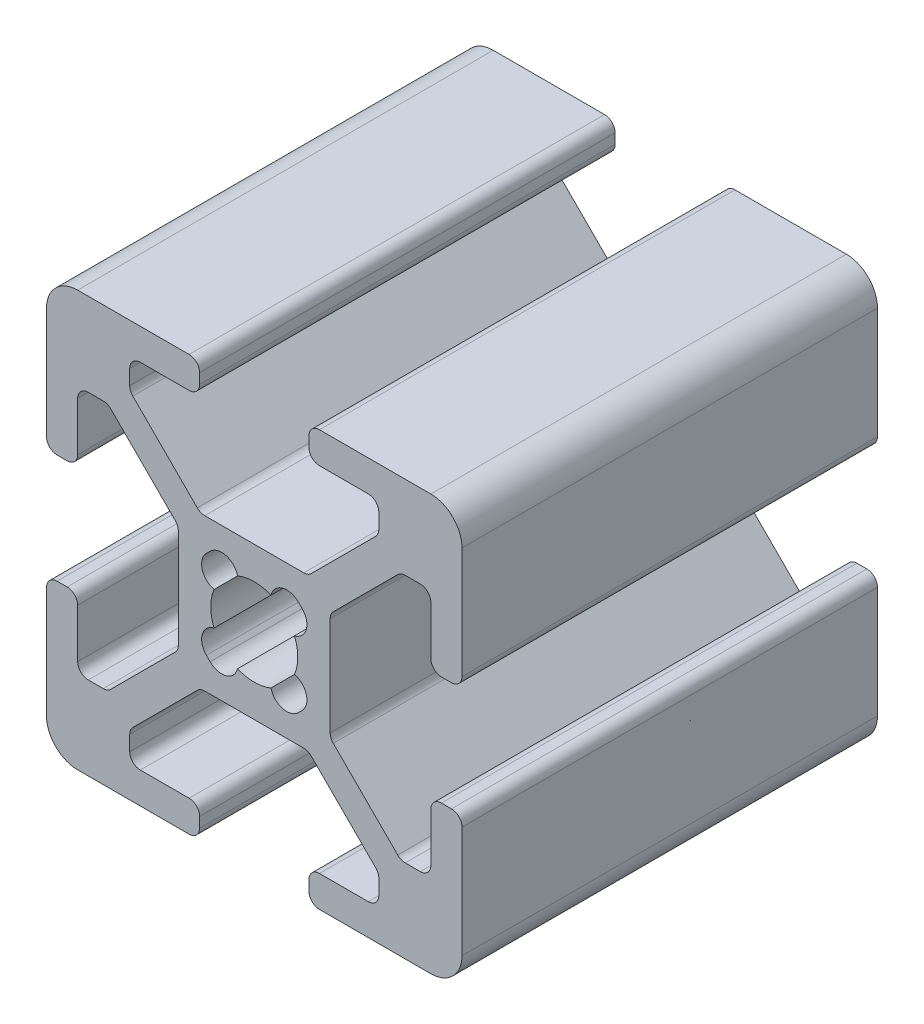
ISO-10303-21;
HEADER;
FILE_DESCRIPTION(('STEP AP214'),'2;1');
FILE_NAME('part.step','',(''),(''),'','','');
FILE_SCHEMA(('AUTOMOTIVE_DESIGN { 1 0 10303 214 1 1 1 1 }'));
ENDSEC;
DATA;
#1=APPLICATION_CONTEXT('core data for automotive mechanical design processes');
#2=APPLICATION_PROTOCOL_DEFINITION('international standard','automotive_design',2000,#1);
#3=PRODUCT_CONTEXT('',#1,'mechanical');
#4=PRODUCT('Part','Part','',(#3));
#5=PRODUCT_RELATED_PRODUCT_CATEGORY('part','',(#4));
#6=PRODUCT_DEFINITION_FORMATION('','',#4);
#7=PRODUCT_DEFINITION_CONTEXT('part definition',#1,'design');
#8=PRODUCT_DEFINITION('design','',#6,#7);
#9=PRODUCT_DEFINITION_SHAPE('','',#8);
#10=(LENGTH_UNIT() NAMED_UNIT(*) SI_UNIT(.MILLI.,.METRE.));
#11=(NAMED_UNIT(*) PLANE_ANGLE_UNIT() SI_UNIT($,.RADIAN.));
#12=(NAMED_UNIT(*) SI_UNIT($,.STERADIAN.) SOLID_ANGLE_UNIT());
#13=UNCERTAINTY_MEASURE_WITH_UNIT(LENGTH_MEASURE(1.E-05),#10,'distance_accuracy_value','');
#14=(GEOMETRIC_REPRESENTATION_CONTEXT(3) GLOBAL_UNCERTAINTY_ASSIGNED_CONTEXT((#13)) GLOBAL_UNIT_ASSIGNED_CONTEXT((#10,
#11,#12)) REPRESENTATION_CONTEXT('',''));
#15=CARTESIAN_POINT('',(0.,0.,0.));
#16=DIRECTION('',(0.,0.,1.));
#17=DIRECTION('',(1.,0.,0.));
#18=AXIS2_PLACEMENT_3D('',#15,#16,#17);
#19=CARTESIAN_POINT('',(-5.03228779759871,0.166940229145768,20.));
#20=DIRECTION('',(0.,0.,1.));
#21=DIRECTION('',(1.,0.,0.));
#22=AXIS2_PLACEMENT_3D('',#19,#20,#21);
#23=PLANE('',#22);
#24=CARTESIAN_POINT('',(-5.03228779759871,0.166940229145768,20.));
#25=DIRECTION('',(0.,0.,1.));
#26=DIRECTION('',(1.,0.,0.));
#27=AXIS2_PLACEMENT_3D('',#24,#25,#26);
#28=CIRCLE('',#27,0.508);
#29=CARTESIAN_POINT('',(-5.03228779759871,-0.341059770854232,20.));
#30=VERTEX_POINT('',#29);
#31=CARTESIAN_POINT('',(-4.52428779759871,0.166940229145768,20.));
#32=VERTEX_POINT('',#31);
#33=EDGE_CURVE('E792',#30,#32,#28,.T.);
#34=ORIENTED_EDGE('',*,*,#33,.T.);
#35=DIRECTION('',(0.,1.,0.));
#36=VECTOR('',#35,1.);
#37=CARTESIAN_POINT('',(-4.52428779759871,0.166940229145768,20.));
#38=LINE('',#37,#36);
#39=CARTESIAN_POINT('',(-4.52428779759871,5.52894022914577,20.));
#40=VERTEX_POINT('',#39);
#41=EDGE_CURVE('E795',#32,#40,#38,.T.);
#42=ORIENTED_EDGE('',*,*,#41,.T.);
#43=CARTESIAN_POINT('',(-6.02428779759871,5.52894022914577,20.));
#44=DIRECTION('',(0.,0.,1.));
#45=DIRECTION('',(1.,0.,0.));
#46=AXIS2_PLACEMENT_3D('',#43,#44,#45);
#47=CIRCLE('',#46,1.5);
#48=CARTESIAN_POINT('',(-6.02428779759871,7.02894022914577,20.));
#49=VERTEX_POINT('',#48);
#50=EDGE_CURVE('E798',#40,#49,#47,.T.);
#51=ORIENTED_EDGE('',*,*,#50,.T.);
#52=DIRECTION('',(-1.,0.,0.));
#53=VECTOR('',#52,1.);
#54=CARTESIAN_POINT('',(-11.3862877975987,7.02894022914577,20.));
#55=LINE('',#54,#53);
#56=CARTESIAN_POINT('',(-11.3862877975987,7.02894022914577,20.));
#57=VERTEX_POINT('',#56);
#58=EDGE_CURVE('E800',#49,#57,#55,.T.);
#59=ORIENTED_EDGE('',*,*,#58,.T.);
#60=CARTESIAN_POINT('',(-11.3862877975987,6.52094022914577,20.));
#61=DIRECTION('',(0.,0.,1.));
#62=DIRECTION('',(1.,0.,0.));
#63=AXIS2_PLACEMENT_3D('',#60,#61,#62);
#64=CIRCLE('',#63,0.507999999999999);
#65=CARTESIAN_POINT('',(-11.8942877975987,6.52094022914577,20.));
#66=VERTEX_POINT('',#65);
#67=EDGE_CURVE('E802',#57,#66,#64,.T.);
#68=ORIENTED_EDGE('',*,*,#67,.T.);
#69=DIRECTION('',(0.,-1.,0.));
#70=VECTOR('',#69,1.);
#71=CARTESIAN_POINT('',(-11.8942877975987,6.52094022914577,20.));
#72=LINE('',#71,#70);
#73=CARTESIAN_POINT('',(-11.8942877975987,6.03694022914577,20.));
#74=VERTEX_POINT('',#73);
#75=EDGE_CURVE('E804',#66,#74,#72,.T.);
#76=ORIENTED_EDGE('',*,*,#75,.T.);
#77=CARTESIAN_POINT('',(-11.3862877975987,6.03694022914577,20.));
#78=DIRECTION('',(0.,0.,1.));
#79=DIRECTION('',(1.,0.,0.));
#80=AXIS2_PLACEMENT_3D('',#77,#78,#79);
#81=CIRCLE('',#80,0.507999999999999);
#82=CARTESIAN_POINT('',(-11.3862877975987,5.52894022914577,20.));
#83=VERTEX_POINT('',#82);
#84=EDGE_CURVE('E806',#74,#83,#81,.T.);
#85=ORIENTED_EDGE('',*,*,#84,.T.);
#86=DIRECTION('',(1.,0.,0.));
#87=VECTOR('',#86,1.);
#88=CARTESIAN_POINT('',(-11.3862877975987,5.52894022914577,20.));
#89=LINE('',#88,#87);
#90=CARTESIAN_POINT('',(-9.03728779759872,5.52894022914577,20.));
#91=VERTEX_POINT('',#90);
#92=EDGE_CURVE('E808',#83,#91,#89,.T.);
#93=ORIENTED_EDGE('',*,*,#92,.T.);
#94=CARTESIAN_POINT('',(-9.03728779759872,5.02094022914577,20.));
#95=DIRECTION('',(0.,0.,-1.));
#96=DIRECTION('',(1.,0.,0.));
#97=AXIS2_PLACEMENT_3D('',#94,#95,#96);
#98=CIRCLE('',#97,0.508);
#99=CARTESIAN_POINT('',(-8.52928779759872,5.02094022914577,20.));
#100=VERTEX_POINT('',#99);
#101=EDGE_CURVE('E810',#91,#100,#98,.T.);
#102=ORIENTED_EDGE('',*,*,#101,.T.);
#103=DIRECTION('',(0.,-1.,0.));
#104=VECTOR('',#103,1.);
#105=CARTESIAN_POINT('',(-8.52928779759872,4.29502089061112,20.));
#106=LINE('',#105,#104);
#107=CARTESIAN_POINT('',(-8.52928779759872,4.29502089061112,20.));
#108=VERTEX_POINT('',#107);
#109=EDGE_CURVE('E812',#100,#108,#106,.T.);
#110=ORIENTED_EDGE('',*,*,#109,.T.);
#111=CARTESIAN_POINT('',(-9.03728779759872,4.29502089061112,20.));
#112=DIRECTION('',(0.,0.,-1.));
#113=DIRECTION('',(1.,0.,0.));
#114=AXIS2_PLACEMENT_3D('',#111,#112,#113);
#115=CIRCLE('',#114,0.508);
#116=CARTESIAN_POINT('',(-8.67807755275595,3.93581064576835,20.));
#117=VERTEX_POINT('',#116);
#118=EDGE_CURVE('E814',#108,#117,#115,.T.);
#119=ORIENTED_EDGE('',*,*,#118,.T.);
#120=DIRECTION('',(-0.707106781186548,-0.707106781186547,0.));
#121=VECTOR('',#120,1.);
#122=CARTESIAN_POINT('',(-8.67807755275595,3.93581064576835,20.));
#123=LINE('',#122,#121);
#124=CARTESIAN_POINT('',(-11.7811582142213,0.832729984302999,20.));
#125=VERTEX_POINT('',#124);
#126=EDGE_CURVE('E816',#117,#125,#123,.T.);
#127=ORIENTED_EDGE('',*,*,#126,.T.);
#128=CARTESIAN_POINT('',(-12.1403684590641,1.19194022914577,20.));
#129=DIRECTION('',(0.,0.,-1.));
#130=DIRECTION('',(1.,0.,0.));
#131=AXIS2_PLACEMENT_3D('',#128,#129,#130);
#132=CIRCLE('',#131,0.508);
#133=CARTESIAN_POINT('',(-12.1403684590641,0.683940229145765,20.));
#134=VERTEX_POINT('',#133);
#135=EDGE_CURVE('E818',#125,#134,#132,.T.);
#136=ORIENTED_EDGE('',*,*,#135,.T.);
#137=DIRECTION('',(-1.,0.,0.));
#138=VECTOR('',#137,1.);
#139=CARTESIAN_POINT('',(-12.1403684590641,0.683940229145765,20.));
#140=LINE('',#139,#138);
#141=CARTESIAN_POINT('',(-16.9082071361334,0.683940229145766,20.));
#142=VERTEX_POINT('',#141);
#143=EDGE_CURVE('E820',#134,#142,#140,.T.);
#144=ORIENTED_EDGE('',*,*,#143,.T.);
#145=CARTESIAN_POINT('',(-16.9082071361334,1.19194022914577,20.));
#146=DIRECTION('',(0.,0.,-1.));
#147=DIRECTION('',(1.,0.,0.));
#148=AXIS2_PLACEMENT_3D('',#145,#146,#147);
#149=CIRCLE('',#148,0.508000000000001);
#150=CARTESIAN_POINT('',(-17.2674173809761,0.832729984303,20.));
#151=VERTEX_POINT('',#150);
#152=EDGE_CURVE('E822',#142,#151,#149,.T.);
#153=ORIENTED_EDGE('',*,*,#152,.T.);
#154=DIRECTION('',(-0.707106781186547,0.707106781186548,0.));
#155=VECTOR('',#154,1.);
#156=CARTESIAN_POINT('',(-20.3704980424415,3.93581064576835,20.));
#157=LINE('',#156,#155);
#158=CARTESIAN_POINT('',(-20.3704980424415,3.93581064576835,20.));
#159=VERTEX_POINT('',#158);
#160=EDGE_CURVE('E824',#151,#159,#157,.T.);
#161=ORIENTED_EDGE('',*,*,#160,.T.);
#162=CARTESIAN_POINT('',(-20.0112877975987,4.29502089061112,20.));
#163=DIRECTION('',(0.,0.,-1.));
#164=DIRECTION('',(1.,0.,0.));
#165=AXIS2_PLACEMENT_3D('',#162,#163,#164);
#166=CIRCLE('',#165,0.507999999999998);
#167=CARTESIAN_POINT('',(-20.5192877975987,4.29502089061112,20.));
#168=VERTEX_POINT('',#167);
#169=EDGE_CURVE('E826',#159,#168,#166,.T.);
#170=ORIENTED_EDGE('',*,*,#169,.T.);
#171=DIRECTION('',(0.,1.,0.));
#172=VECTOR('',#171,1.);
#173=CARTESIAN_POINT('',(-20.5192877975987,4.29502089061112,20.));
#174=LINE('',#173,#172);
#175=CARTESIAN_POINT('',(-20.5192877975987,5.02094022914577,20.));
#176=VERTEX_POINT('',#175);
#177=EDGE_CURVE('E828',#168,#176,#174,.T.);
#178=ORIENTED_EDGE('',*,*,#177,.T.);
#179=CARTESIAN_POINT('',(-20.0112877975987,5.02094022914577,20.));
#180=DIRECTION('',(0.,0.,-1.));
#181=DIRECTION('',(1.,0.,0.));
#182=AXIS2_PLACEMENT_3D('',#179,#180,#181);
#183=CIRCLE('',#182,0.507999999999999);
#184=CARTESIAN_POINT('',(-20.0112877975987,5.52894022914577,20.));
#185=VERTEX_POINT('',#184);
#186=EDGE_CURVE('E830',#176,#185,#183,.T.);
#187=ORIENTED_EDGE('',*,*,#186,.T.);
#188=DIRECTION('',(1.,0.,0.));
#189=VECTOR('',#188,1.);
#190=CARTESIAN_POINT('',(-17.6622877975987,5.52894022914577,20.));
#191=LINE('',#190,#189);
#192=CARTESIAN_POINT('',(-17.6622877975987,5.52894022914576,20.));
#193=VERTEX_POINT('',#192);
#194=EDGE_CURVE('E832',#185,#193,#191,.T.);
#195=ORIENTED_EDGE('',*,*,#194,.T.);
#196=CARTESIAN_POINT('',(-17.6622877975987,6.03694022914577,20.));
#197=DIRECTION('',(0.,0.,1.));
#198=DIRECTION('',(1.,0.,0.));
#199=AXIS2_PLACEMENT_3D('',#196,#197,#198);
#200=CIRCLE('',#199,0.508000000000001);
#201=CARTESIAN_POINT('',(-17.1542877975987,6.03694022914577,20.));
#202=VERTEX_POINT('',#201);
#203=EDGE_CURVE('E834',#193,#202,#200,.T.);
#204=ORIENTED_EDGE('',*,*,#203,.T.);
#205=DIRECTION('',(0.,1.,0.));
#206=VECTOR('',#205,1.);
#207=CARTESIAN_POINT('',(-17.1542877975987,6.52094022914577,20.));
#208=LINE('',#207,#206);
#209=CARTESIAN_POINT('',(-17.1542877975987,6.52094022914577,20.));
#210=VERTEX_POINT('',#209);
#211=EDGE_CURVE('E836',#202,#210,#208,.T.);
#212=ORIENTED_EDGE('',*,*,#211,.T.);
#213=CARTESIAN_POINT('',(-17.6622877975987,6.52094022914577,20.));
#214=DIRECTION('',(0.,0.,1.));
#215=DIRECTION('',(1.,0.,0.));
#216=AXIS2_PLACEMENT_3D('',#213,#214,#215);
#217=CIRCLE('',#216,0.508000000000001);
#218=CARTESIAN_POINT('',(-17.6622877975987,7.02894022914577,20.));
#219=VERTEX_POINT('',#218);
#220=EDGE_CURVE('E838',#210,#219,#217,.T.);
#221=ORIENTED_EDGE('',*,*,#220,.T.);
#222=DIRECTION('',(-1.,0.,0.));
#223=VECTOR('',#222,1.);
#224=CARTESIAN_POINT('',(-17.6622877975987,7.02894022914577,20.));
#225=LINE('',#224,#223);
#226=CARTESIAN_POINT('',(-23.0242877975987,7.02894022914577,20.));
#227=VERTEX_POINT('',#226);
#228=EDGE_CURVE('E840',#219,#227,#225,.T.);
#229=ORIENTED_EDGE('',*,*,#228,.T.);
#230=CARTESIAN_POINT('',(-23.0242877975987,5.52894022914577,20.));
#231=DIRECTION('',(0.,0.,1.));
#232=DIRECTION('',(1.,0.,0.));
#233=AXIS2_PLACEMENT_3D('',#230,#231,#232);
#234=CIRCLE('',#233,1.5);
#235=CARTESIAN_POINT('',(-24.5242877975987,5.52894022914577,20.));
#236=VERTEX_POINT('',#235);
#237=EDGE_CURVE('E842',#227,#236,#234,.T.);
#238=ORIENTED_EDGE('',*,*,#237,.T.);
#239=DIRECTION('',(0.,-1.,0.));
#240=VECTOR('',#239,1.);
#241=CARTESIAN_POINT('',(-24.5242877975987,0.166940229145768,20.));
#242=LINE('',#241,#240);
#243=CARTESIAN_POINT('',(-24.5242877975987,0.166940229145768,20.));
#244=VERTEX_POINT('',#243);
#245=EDGE_CURVE('E844',#236,#244,#242,.T.);
#246=ORIENTED_EDGE('',*,*,#245,.T.);
#247=CARTESIAN_POINT('',(-24.0162877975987,0.166940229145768,20.));
#248=DIRECTION('',(0.,0.,1.));
#249=DIRECTION('',(1.,0.,0.));
#250=AXIS2_PLACEMENT_3D('',#247,#248,#249);
#251=CIRCLE('',#250,0.508000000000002);
#252=CARTESIAN_POINT('',(-24.0162877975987,-0.341059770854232,20.));
#253=VERTEX_POINT('',#252);
#254=EDGE_CURVE('E846',#244,#253,#251,.T.);
#255=ORIENTED_EDGE('',*,*,#254,.T.);
#256=DIRECTION('',(1.,0.,0.));
#257=VECTOR('',#256,1.);
#258=CARTESIAN_POINT('',(-24.0162877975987,-0.341059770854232,20.));
#259=LINE('',#258,#257);
#260=CARTESIAN_POINT('',(-23.5322877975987,-0.341059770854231,20.));
#261=VERTEX_POINT('',#260);
#262=EDGE_CURVE('E848',#253,#261,#259,.T.);
#263=ORIENTED_EDGE('',*,*,#262,.T.);
#264=CARTESIAN_POINT('',(-23.5322877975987,0.166940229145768,20.));
#265=DIRECTION('',(0.,0.,1.));
#266=DIRECTION('',(1.,0.,0.));
#267=AXIS2_PLACEMENT_3D('',#264,#265,#266);
#268=CIRCLE('',#267,0.507999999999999);
#269=CARTESIAN_POINT('',(-23.0242877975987,0.166940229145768,20.));
#270=VERTEX_POINT('',#269);
#271=EDGE_CURVE('E850',#261,#270,#268,.T.);
#272=ORIENTED_EDGE('',*,*,#271,.T.);
#273=DIRECTION('',(0.,1.,0.));
#274=VECTOR('',#273,1.);
#275=CARTESIAN_POINT('',(-23.0242877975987,0.166940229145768,20.));
#276=LINE('',#275,#274);
#277=CARTESIAN_POINT('',(-23.0242877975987,2.51594022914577,20.));
#278=VERTEX_POINT('',#277);
#279=EDGE_CURVE('E852',#270,#278,#276,.T.);
#280=ORIENTED_EDGE('',*,*,#279,.T.);
#281=CARTESIAN_POINT('',(-22.5162877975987,2.51594022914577,20.));
#282=DIRECTION('',(0.,0.,-1.));
#283=DIRECTION('',(1.,0.,0.));
#284=AXIS2_PLACEMENT_3D('',#281,#282,#283);
#285=CIRCLE('',#284,0.508000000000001);
#286=CARTESIAN_POINT('',(-22.5162877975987,3.02394022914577,20.));
#287=VERTEX_POINT('',#286);
#288=EDGE_CURVE('E854',#278,#287,#285,.T.);
#289=ORIENTED_EDGE('',*,*,#288,.T.);
#290=DIRECTION('',(1.,0.,0.));
#291=VECTOR('',#290,1.);
#292=CARTESIAN_POINT('',(-21.7903684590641,3.02394022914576,20.));
#293=LINE('',#292,#291);
#294=CARTESIAN_POINT('',(-21.7903684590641,3.02394022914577,20.));
#295=VERTEX_POINT('',#294);
#296=EDGE_CURVE('E856',#287,#295,#293,.T.);
#297=ORIENTED_EDGE('',*,*,#296,.T.);
#298=CARTESIAN_POINT('',(-21.7903684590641,2.51594022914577,20.));
#299=DIRECTION('',(0.,0.,-1.));
#300=DIRECTION('',(1.,0.,0.));
#301=AXIS2_PLACEMENT_3D('',#298,#299,#300);
#302=CIRCLE('',#301,0.508);
#303=CARTESIAN_POINT('',(-21.4311582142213,2.87515047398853,20.));
#304=VERTEX_POINT('',#303);
#305=EDGE_CURVE('E858',#295,#304,#302,.T.);
#306=ORIENTED_EDGE('',*,*,#305,.T.);
#307=DIRECTION('',(0.707106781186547,-0.707106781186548,0.));
#308=VECTOR('',#307,1.);
#309=CARTESIAN_POINT('',(-21.4311582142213,2.87515047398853,20.));
#310=LINE('',#309,#308);
#311=CARTESIAN_POINT('',(-18.3280775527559,-0.227930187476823,20.));
#312=VERTEX_POINT('',#311);
#313=EDGE_CURVE('E860',#304,#312,#310,.T.);
#314=ORIENTED_EDGE('',*,*,#313,.T.);
#315=CARTESIAN_POINT('',(-18.6872877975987,-0.587140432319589,20.));
#316=DIRECTION('',(0.,0.,-1.));
#317=DIRECTION('',(1.,0.,0.));
#318=AXIS2_PLACEMENT_3D('',#315,#316,#317);
#319=CIRCLE('',#318,0.507999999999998);
#320=CARTESIAN_POINT('',(-18.1792877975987,-0.587140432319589,20.));
#321=VERTEX_POINT('',#320);
#322=EDGE_CURVE('E862',#312,#321,#319,.T.);
#323=ORIENTED_EDGE('',*,*,#322,.T.);
#324=DIRECTION('',(0.,-1.,0.));
#325=VECTOR('',#324,1.);
#326=CARTESIAN_POINT('',(-18.1792877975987,-0.587140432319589,20.));
#327=LINE('',#326,#325);
#328=CARTESIAN_POINT('',(-18.1792877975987,-5.35497910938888,20.));
#329=VERTEX_POINT('',#328);
#330=EDGE_CURVE('E864',#321,#329,#327,.T.);
#331=ORIENTED_EDGE('',*,*,#330,.T.);
#332=CARTESIAN_POINT('',(-18.6872877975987,-5.35497910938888,20.));
#333=DIRECTION('',(0.,0.,-1.));
#334=DIRECTION('',(1.,0.,0.));
#335=AXIS2_PLACEMENT_3D('',#332,#333,#334);
#336=CIRCLE('',#335,0.507999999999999);
#337=CARTESIAN_POINT('',(-18.3280775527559,-5.71418935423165,20.));
#338=VERTEX_POINT('',#337);
#339=EDGE_CURVE('E866',#329,#338,#336,.T.);
#340=ORIENTED_EDGE('',*,*,#339,.T.);
#341=DIRECTION('',(-0.707106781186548,-0.707106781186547,0.));
#342=VECTOR('',#341,1.);
#343=CARTESIAN_POINT('',(-21.4311582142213,-8.817270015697,20.));
#344=LINE('',#343,#342);
#345=CARTESIAN_POINT('',(-21.4311582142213,-8.817270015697,20.));
#346=VERTEX_POINT('',#345);
#347=EDGE_CURVE('E868',#338,#346,#344,.T.);
#348=ORIENTED_EDGE('',*,*,#347,.T.);
#349=CARTESIAN_POINT('',(-21.7903684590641,-8.45805977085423,20.));
#350=DIRECTION('',(0.,0.,-1.));
#351=DIRECTION('',(1.,0.,0.));
#352=AXIS2_PLACEMENT_3D('',#349,#350,#351);
#353=CIRCLE('',#352,0.507999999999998);
#354=CARTESIAN_POINT('',(-21.7903684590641,-8.96605977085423,20.));
#355=VERTEX_POINT('',#354);
#356=EDGE_CURVE('E870',#346,#355,#353,.T.);
#357=ORIENTED_EDGE('',*,*,#356,.T.);
#358=DIRECTION('',(-1.,0.,0.));
#359=VECTOR('',#358,1.);
#360=CARTESIAN_POINT('',(-21.7903684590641,-8.96605977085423,20.));
#361=LINE('',#360,#359);
#362=CARTESIAN_POINT('',(-22.5162877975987,-8.96605977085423,20.));
#363=VERTEX_POINT('',#362);
#364=EDGE_CURVE('E872',#355,#363,#361,.T.);
#365=ORIENTED_EDGE('',*,*,#364,.T.);
#366=CARTESIAN_POINT('',(-22.5162877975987,-8.45805977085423,20.));
#367=DIRECTION('',(0.,0.,-1.));
#368=DIRECTION('',(1.,0.,0.));
#369=AXIS2_PLACEMENT_3D('',#366,#367,#368);
#370=CIRCLE('',#369,0.507999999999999);
#371=CARTESIAN_POINT('',(-23.0242877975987,-8.45805977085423,20.));
#372=VERTEX_POINT('',#371);
#373=EDGE_CURVE('E874',#363,#372,#370,.T.);
#374=ORIENTED_EDGE('',*,*,#373,.T.);
#375=DIRECTION('',(0.,1.,0.));
#376=VECTOR('',#375,1.);
#377=CARTESIAN_POINT('',(-23.0242877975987,-6.10905977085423,20.));
#378=LINE('',#377,#376);
#379=CARTESIAN_POINT('',(-23.0242877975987,-6.10905977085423,20.));
#380=VERTEX_POINT('',#379);
#381=EDGE_CURVE('E876',#372,#380,#378,.T.);
#382=ORIENTED_EDGE('',*,*,#381,.T.);
#383=CARTESIAN_POINT('',(-23.5322877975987,-6.10905977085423,20.));
#384=DIRECTION('',(0.,0.,1.));
#385=DIRECTION('',(1.,0.,0.));
#386=AXIS2_PLACEMENT_3D('',#383,#384,#385);
#387=CIRCLE('',#386,0.507999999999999);
#388=CARTESIAN_POINT('',(-23.5322877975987,-5.60105977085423,20.));
#389=VERTEX_POINT('',#388);
#390=EDGE_CURVE('E878',#380,#389,#387,.T.);
#391=ORIENTED_EDGE('',*,*,#390,.T.);
#392=DIRECTION('',(-1.,0.,0.));
#393=VECTOR('',#392,1.);
#394=CARTESIAN_POINT('',(-24.0162877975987,-5.60105977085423,20.));
#395=LINE('',#394,#393);
#396=CARTESIAN_POINT('',(-24.0162877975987,-5.60105977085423,20.));
#397=VERTEX_POINT('',#396);
#398=EDGE_CURVE('E880',#389,#397,#395,.T.);
#399=ORIENTED_EDGE('',*,*,#398,.T.);
#400=CARTESIAN_POINT('',(-24.0162877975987,-6.10905977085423,20.));
#401=DIRECTION('',(0.,0.,1.));
#402=DIRECTION('',(1.,0.,0.));
#403=AXIS2_PLACEMENT_3D('',#400,#401,#402);
#404=CIRCLE('',#403,0.508000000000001);
#405=CARTESIAN_POINT('',(-24.5242877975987,-6.10905977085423,20.));
#406=VERTEX_POINT('',#405);
#407=EDGE_CURVE('E882',#397,#406,#404,.T.);
#408=ORIENTED_EDGE('',*,*,#407,.T.);
#409=DIRECTION('',(0.,-1.,0.));
#410=VECTOR('',#409,1.);
#411=CARTESIAN_POINT('',(-24.5242877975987,-6.10905977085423,20.));
#412=LINE('',#411,#410);
#413=CARTESIAN_POINT('',(-24.5242877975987,-11.4710597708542,20.));
#414=VERTEX_POINT('',#413);
#415=EDGE_CURVE('E884',#406,#414,#412,.T.);
#416=ORIENTED_EDGE('',*,*,#415,.T.);
#417=CARTESIAN_POINT('',(-23.0242877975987,-11.4710597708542,20.));
#418=DIRECTION('',(0.,0.,1.));
#419=DIRECTION('',(1.,0.,0.));
#420=AXIS2_PLACEMENT_3D('',#417,#418,#419);
#421=CIRCLE('',#420,1.5);
#422=CARTESIAN_POINT('',(-23.0242877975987,-12.9710597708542,20.));
#423=VERTEX_POINT('',#422);
#424=EDGE_CURVE('E886',#414,#423,#421,.T.);
#425=ORIENTED_EDGE('',*,*,#424,.T.);
#426=DIRECTION('',(1.,0.,0.));
#427=VECTOR('',#426,1.);
#428=CARTESIAN_POINT('',(-17.6622877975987,-12.9710597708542,20.));
#429=LINE('',#428,#427);
#430=CARTESIAN_POINT('',(-17.6622877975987,-12.9710597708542,20.));
#431=VERTEX_POINT('',#430);
#432=EDGE_CURVE('E888',#423,#431,#429,.T.);
#433=ORIENTED_EDGE('',*,*,#432,.T.);
#434=CARTESIAN_POINT('',(-17.6622877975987,-12.4630597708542,20.));
#435=DIRECTION('',(0.,0.,1.));
#436=DIRECTION('',(1.,0.,0.));
#437=AXIS2_PLACEMENT_3D('',#434,#435,#436);
#438=CIRCLE('',#437,0.508);
#439=CARTESIAN_POINT('',(-17.1542877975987,-12.4630597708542,20.));
#440=VERTEX_POINT('',#439);
#441=EDGE_CURVE('E890',#431,#440,#438,.T.);
#442=ORIENTED_EDGE('',*,*,#441,.T.);
#443=DIRECTION('',(0.,1.,0.));
#444=VECTOR('',#443,1.);
#445=CARTESIAN_POINT('',(-17.1542877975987,-12.4630597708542,20.));
#446=LINE('',#445,#444);
#447=CARTESIAN_POINT('',(-17.1542877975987,-11.9790597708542,20.));
#448=VERTEX_POINT('',#447);
#449=EDGE_CURVE('E892',#440,#448,#446,.T.);
#450=ORIENTED_EDGE('',*,*,#449,.T.);
#451=CARTESIAN_POINT('',(-17.6622877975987,-11.9790597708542,20.));
#452=DIRECTION('',(0.,0.,1.));
#453=DIRECTION('',(1.,0.,0.));
#454=AXIS2_PLACEMENT_3D('',#451,#452,#453);
#455=CIRCLE('',#454,0.507999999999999);
#456=CARTESIAN_POINT('',(-17.6622877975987,-11.4710597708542,20.));
#457=VERTEX_POINT('',#456);
#458=EDGE_CURVE('E894',#448,#457,#455,.T.);
#459=ORIENTED_EDGE('',*,*,#458,.T.);
#460=DIRECTION('',(-1.,0.,0.));
#461=VECTOR('',#460,1.);
#462=CARTESIAN_POINT('',(-17.6622877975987,-11.4710597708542,20.));
#463=LINE('',#462,#461);
#464=CARTESIAN_POINT('',(-20.0112877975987,-11.4710597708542,20.));
#465=VERTEX_POINT('',#464);
#466=EDGE_CURVE('E896',#457,#465,#463,.T.);
#467=ORIENTED_EDGE('',*,*,#466,.T.);
#468=CARTESIAN_POINT('',(-20.0112877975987,-10.9630597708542,20.));
#469=DIRECTION('',(0.,0.,-1.));
#470=DIRECTION('',(1.,0.,0.));
#471=AXIS2_PLACEMENT_3D('',#468,#469,#470);
#472=CIRCLE('',#471,0.507999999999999);
#473=CARTESIAN_POINT('',(-20.5192877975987,-10.9630597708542,20.));
#474=VERTEX_POINT('',#473);
#475=EDGE_CURVE('E898',#465,#474,#472,.T.);
#476=ORIENTED_EDGE('',*,*,#475,.T.);
#477=DIRECTION('',(0.,1.,0.));
#478=VECTOR('',#477,1.);
#479=CARTESIAN_POINT('',(-20.5192877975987,-10.2371404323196,20.));
#480=LINE('',#479,#478);
#481=CARTESIAN_POINT('',(-20.5192877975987,-10.2371404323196,20.));
#482=VERTEX_POINT('',#481);
#483=EDGE_CURVE('E900',#474,#482,#480,.T.);
#484=ORIENTED_EDGE('',*,*,#483,.T.);
#485=CARTESIAN_POINT('',(-20.0112877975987,-10.2371404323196,20.));
#486=DIRECTION('',(0.,0.,-1.));
#487=DIRECTION('',(1.,0.,0.));
#488=AXIS2_PLACEMENT_3D('',#485,#486,#487);
#489=CIRCLE('',#488,0.507999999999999);
#490=CARTESIAN_POINT('',(-20.3704980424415,-9.87793018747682,20.));
#491=VERTEX_POINT('',#490);
#492=EDGE_CURVE('E902',#482,#491,#489,.T.);
#493=ORIENTED_EDGE('',*,*,#492,.T.);
#494=DIRECTION('',(0.707106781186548,0.707106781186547,0.));
#495=VECTOR('',#494,1.);
#496=CARTESIAN_POINT('',(-20.3704980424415,-9.87793018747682,20.));
#497=LINE('',#496,#495);
#498=CARTESIAN_POINT('',(-17.2674173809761,-6.77484952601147,20.));
#499=VERTEX_POINT('',#498);
#500=EDGE_CURVE('E904',#491,#499,#497,.T.);
#501=ORIENTED_EDGE('',*,*,#500,.T.);
#502=CARTESIAN_POINT('',(-16.9082071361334,-7.13405977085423,20.));
#503=DIRECTION('',(0.,0.,-1.));
#504=DIRECTION('',(1.,0.,0.));
#505=AXIS2_PLACEMENT_3D('',#502,#503,#504);
#506=CIRCLE('',#505,0.508);
#507=CARTESIAN_POINT('',(-16.9082071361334,-6.62605977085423,20.));
#508=VERTEX_POINT('',#507);
#509=EDGE_CURVE('E906',#499,#508,#506,.T.);
#510=ORIENTED_EDGE('',*,*,#509,.T.);
#511=DIRECTION('',(1.,0.,0.));
#512=VECTOR('',#511,1.);
#513=CARTESIAN_POINT('',(-16.9082071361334,-6.62605977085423,20.));
#514=LINE('',#513,#512);
#515=CARTESIAN_POINT('',(-12.1403684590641,-6.62605977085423,20.));
#516=VERTEX_POINT('',#515);
#517=EDGE_CURVE('E908',#508,#516,#514,.T.);
#518=ORIENTED_EDGE('',*,*,#517,.T.);
#519=CARTESIAN_POINT('',(-12.1403684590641,-7.13405977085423,20.));
#520=DIRECTION('',(0.,0.,-1.));
#521=DIRECTION('',(1.,0.,0.));
#522=AXIS2_PLACEMENT_3D('',#519,#520,#521);
#523=CIRCLE('',#522,0.508);
#524=CARTESIAN_POINT('',(-11.7811582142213,-6.77484952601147,20.));
#525=VERTEX_POINT('',#524);
#526=EDGE_CURVE('E910',#516,#525,#523,.T.);
#527=ORIENTED_EDGE('',*,*,#526,.T.);
#528=DIRECTION('',(0.707106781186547,-0.707106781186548,0.));
#529=VECTOR('',#528,1.);
#530=CARTESIAN_POINT('',(-8.67807755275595,-9.87793018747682,20.));
#531=LINE('',#530,#529);
#532=CARTESIAN_POINT('',(-8.67807755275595,-9.87793018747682,20.));
#533=VERTEX_POINT('',#532);
#534=EDGE_CURVE('E912',#525,#533,#531,.T.);
#535=ORIENTED_EDGE('',*,*,#534,.T.);
#536=CARTESIAN_POINT('',(-9.03728779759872,-10.2371404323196,20.));
#537=DIRECTION('',(0.,0.,-1.));
#538=DIRECTION('',(1.,0.,0.));
#539=AXIS2_PLACEMENT_3D('',#536,#537,#538);
#540=CIRCLE('',#539,0.508);
#541=CARTESIAN_POINT('',(-8.52928779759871,-10.2371404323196,20.));
#542=VERTEX_POINT('',#541);
#543=EDGE_CURVE('E914',#533,#542,#540,.T.);
#544=ORIENTED_EDGE('',*,*,#543,.T.);
#545=DIRECTION('',(0.,-1.,0.));
#546=VECTOR('',#545,1.);
#547=CARTESIAN_POINT('',(-8.52928779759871,-10.2371404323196,20.));
#548=LINE('',#547,#546);
#549=CARTESIAN_POINT('',(-8.52928779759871,-10.9630597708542,20.));
#550=VERTEX_POINT('',#549);
#551=EDGE_CURVE('E916',#542,#550,#548,.T.);
#552=ORIENTED_EDGE('',*,*,#551,.T.);
#553=CARTESIAN_POINT('',(-9.03728779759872,-10.9630597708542,20.));
#554=DIRECTION('',(0.,0.,-1.));
#555=DIRECTION('',(1.,0.,0.));
#556=AXIS2_PLACEMENT_3D('',#553,#554,#555);
#557=CIRCLE('',#556,0.508);
#558=CARTESIAN_POINT('',(-9.03728779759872,-11.4710597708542,20.));
#559=VERTEX_POINT('',#558);
#560=EDGE_CURVE('E918',#550,#559,#557,.T.);
#561=ORIENTED_EDGE('',*,*,#560,.T.);
#562=DIRECTION('',(-1.,0.,0.));
#563=VECTOR('',#562,1.);
#564=CARTESIAN_POINT('',(-11.3862877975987,-11.4710597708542,20.));
#565=LINE('',#564,#563);
#566=CARTESIAN_POINT('',(-11.3862877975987,-11.4710597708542,20.));
#567=VERTEX_POINT('',#566);
#568=EDGE_CURVE('E920',#559,#567,#565,.T.);
#569=ORIENTED_EDGE('',*,*,#568,.T.);
#570=CARTESIAN_POINT('',(-11.3862877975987,-11.9790597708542,20.));
#571=DIRECTION('',(0.,0.,1.));
#572=DIRECTION('',(1.,0.,0.));
#573=AXIS2_PLACEMENT_3D('',#570,#571,#572);
#574=CIRCLE('',#573,0.508);
#575=CARTESIAN_POINT('',(-11.8942877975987,-11.9790597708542,20.));
#576=VERTEX_POINT('',#575);
#577=EDGE_CURVE('E922',#567,#576,#574,.T.);
#578=ORIENTED_EDGE('',*,*,#577,.T.);
#579=DIRECTION('',(0.,-1.,0.));
#580=VECTOR('',#579,1.);
#581=CARTESIAN_POINT('',(-11.8942877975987,-12.4630597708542,20.));
#582=LINE('',#581,#580);
#583=CARTESIAN_POINT('',(-11.8942877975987,-12.4630597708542,20.));
#584=VERTEX_POINT('',#583);
#585=EDGE_CURVE('E924',#576,#584,#582,.T.);
#586=ORIENTED_EDGE('',*,*,#585,.T.);
#587=CARTESIAN_POINT('',(-11.3862877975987,-12.4630597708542,20.));
#588=DIRECTION('',(0.,0.,1.));
#589=DIRECTION('',(1.,0.,0.));
#590=AXIS2_PLACEMENT_3D('',#587,#588,#589);
#591=CIRCLE('',#590,0.508000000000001);
#592=CARTESIAN_POINT('',(-11.3862877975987,-12.9710597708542,20.));
#593=VERTEX_POINT('',#592);
#594=EDGE_CURVE('E926',#584,#593,#591,.T.);
#595=ORIENTED_EDGE('',*,*,#594,.T.);
#596=DIRECTION('',(1.,0.,0.));
#597=VECTOR('',#596,1.);
#598=CARTESIAN_POINT('',(-11.3862877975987,-12.9710597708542,20.));
#599=LINE('',#598,#597);
#600=CARTESIAN_POINT('',(-6.02428779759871,-12.9710597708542,20.));
#601=VERTEX_POINT('',#600);
#602=EDGE_CURVE('E928',#593,#601,#599,.T.);
#603=ORIENTED_EDGE('',*,*,#602,.T.);
#604=CARTESIAN_POINT('',(-6.02428779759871,-11.4710597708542,20.));
#605=DIRECTION('',(0.,0.,1.));
#606=DIRECTION('',(1.,0.,0.));
#607=AXIS2_PLACEMENT_3D('',#604,#605,#606);
#608=CIRCLE('',#607,1.5);
#609=CARTESIAN_POINT('',(-4.52428779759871,-11.4710597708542,20.));
#610=VERTEX_POINT('',#609);
#611=EDGE_CURVE('E930',#601,#610,#608,.T.);
#612=ORIENTED_EDGE('',*,*,#611,.T.);
#613=DIRECTION('',(0.,1.,0.));
#614=VECTOR('',#613,1.);
#615=CARTESIAN_POINT('',(-4.52428779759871,-6.10905977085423,20.));
#616=LINE('',#615,#614);
#617=CARTESIAN_POINT('',(-4.52428779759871,-6.10905977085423,20.));
#618=VERTEX_POINT('',#617);
#619=EDGE_CURVE('E932',#610,#618,#616,.T.);
#620=ORIENTED_EDGE('',*,*,#619,.T.);
#621=CARTESIAN_POINT('',(-5.03228779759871,-6.10905977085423,20.));
#622=DIRECTION('',(0.,0.,1.));
#623=DIRECTION('',(1.,0.,0.));
#624=AXIS2_PLACEMENT_3D('',#621,#622,#623);
#625=CIRCLE('',#624,0.508);
#626=CARTESIAN_POINT('',(-5.03228779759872,-5.60105977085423,20.));
#627=VERTEX_POINT('',#626);
#628=EDGE_CURVE('E934',#618,#627,#625,.T.);
#629=ORIENTED_EDGE('',*,*,#628,.T.);
#630=DIRECTION('',(-1.,0.,0.));
#631=VECTOR('',#630,1.);
#632=CARTESIAN_POINT('',(-5.03228779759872,-5.60105977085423,20.));
#633=LINE('',#632,#631);
#634=CARTESIAN_POINT('',(-5.51628779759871,-5.60105977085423,20.));
#635=VERTEX_POINT('',#634);
#636=EDGE_CURVE('E936',#627,#635,#633,.T.);
#637=ORIENTED_EDGE('',*,*,#636,.T.);
#638=CARTESIAN_POINT('',(-5.51628779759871,-6.10905977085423,20.));
#639=DIRECTION('',(0.,0.,1.));
#640=DIRECTION('',(1.,0.,0.));
#641=AXIS2_PLACEMENT_3D('',#638,#639,#640);
#642=CIRCLE('',#641,0.508);
#643=CARTESIAN_POINT('',(-6.02428779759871,-6.10905977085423,20.));
#644=VERTEX_POINT('',#643);
#645=EDGE_CURVE('E938',#635,#644,#642,.T.);
#646=ORIENTED_EDGE('',*,*,#645,.T.);
#647=DIRECTION('',(0.,-1.,0.));
#648=VECTOR('',#647,1.);
#649=CARTESIAN_POINT('',(-6.02428779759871,-6.10905977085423,20.));
#650=LINE('',#649,#648);
#651=CARTESIAN_POINT('',(-6.02428779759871,-8.45805977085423,20.));
#652=VERTEX_POINT('',#651);
#653=EDGE_CURVE('E940',#644,#652,#650,.T.);
#654=ORIENTED_EDGE('',*,*,#653,.T.);
#655=CARTESIAN_POINT('',(-6.53228779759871,-8.45805977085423,20.));
#656=DIRECTION('',(0.,0.,-1.));
#657=DIRECTION('',(1.,0.,0.));
#658=AXIS2_PLACEMENT_3D('',#655,#656,#657);
#659=CIRCLE('',#658,0.507999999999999);
#660=CARTESIAN_POINT('',(-6.53228779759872,-8.96605977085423,20.));
#661=VERTEX_POINT('',#660);
#662=EDGE_CURVE('E942',#652,#661,#659,.T.);
#663=ORIENTED_EDGE('',*,*,#662,.T.);
#664=DIRECTION('',(-1.,0.,0.));
#665=VECTOR('',#664,1.);
#666=CARTESIAN_POINT('',(-7.25820713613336,-8.96605977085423,20.));
#667=LINE('',#666,#665);
#668=CARTESIAN_POINT('',(-7.25820713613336,-8.96605977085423,20.));
#669=VERTEX_POINT('',#668);
#670=EDGE_CURVE('E944',#661,#669,#667,.T.);
#671=ORIENTED_EDGE('',*,*,#670,.T.);
#672=CARTESIAN_POINT('',(-7.25820713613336,-8.45805977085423,20.));
#673=DIRECTION('',(0.,0.,-1.));
#674=DIRECTION('',(1.,0.,0.));
#675=AXIS2_PLACEMENT_3D('',#672,#673,#674);
#676=CIRCLE('',#675,0.507999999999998);
#677=CARTESIAN_POINT('',(-7.61741738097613,-8.817270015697,20.));
#678=VERTEX_POINT('',#677);
#679=EDGE_CURVE('E946',#669,#678,#676,.T.);
#680=ORIENTED_EDGE('',*,*,#679,.T.);
#681=DIRECTION('',(-0.707106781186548,0.707106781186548,0.));
#682=VECTOR('',#681,1.);
#683=CARTESIAN_POINT('',(-7.61741738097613,-8.817270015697,20.));
#684=LINE('',#683,#682);
#685=CARTESIAN_POINT('',(-10.7204980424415,-5.71418935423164,20.));
#686=VERTEX_POINT('',#685);
#687=EDGE_CURVE('E948',#678,#686,#684,.T.);
#688=ORIENTED_EDGE('',*,*,#687,.T.);
#689=CARTESIAN_POINT('',(-10.3612877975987,-5.35497910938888,20.));
#690=DIRECTION('',(0.,0.,-1.));
#691=DIRECTION('',(1.,0.,0.));
#692=AXIS2_PLACEMENT_3D('',#689,#690,#691);
#693=CIRCLE('',#692,0.508000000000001);
#694=CARTESIAN_POINT('',(-10.8692877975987,-5.35497910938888,20.));
#695=VERTEX_POINT('',#694);
#696=EDGE_CURVE('E950',#686,#695,#693,.T.);
#697=ORIENTED_EDGE('',*,*,#696,.T.);
#698=DIRECTION('',(0.,1.,0.));
#699=VECTOR('',#698,1.);
#700=CARTESIAN_POINT('',(-10.8692877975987,-5.35497910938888,20.));
#701=LINE('',#700,#699);
#702=CARTESIAN_POINT('',(-10.8692877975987,-0.587140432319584,20.));
#703=VERTEX_POINT('',#702);
#704=EDGE_CURVE('E952',#695,#703,#701,.T.);
#705=ORIENTED_EDGE('',*,*,#704,.T.);
#706=CARTESIAN_POINT('',(-10.3612877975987,-0.587140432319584,20.));
#707=DIRECTION('',(0.,0.,-1.));
#708=DIRECTION('',(1.,0.,0.));
#709=AXIS2_PLACEMENT_3D('',#706,#707,#708);
#710=CIRCLE('',#709,0.508000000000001);
#711=CARTESIAN_POINT('',(-10.7204980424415,-0.227930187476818,20.));
#712=VERTEX_POINT('',#711);
#713=EDGE_CURVE('E954',#703,#712,#710,.T.);
#714=ORIENTED_EDGE('',*,*,#713,.T.);
#715=DIRECTION('',(0.707106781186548,0.707106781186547,0.));
#716=VECTOR('',#715,1.);
#717=CARTESIAN_POINT('',(-7.61741738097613,2.87515047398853,20.));
#718=LINE('',#717,#716);
#719=CARTESIAN_POINT('',(-7.61741738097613,2.87515047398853,20.));
#720=VERTEX_POINT('',#719);
#721=EDGE_CURVE('E956',#712,#720,#718,.T.);
#722=ORIENTED_EDGE('',*,*,#721,.T.);
#723=CARTESIAN_POINT('',(-7.25820713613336,2.51594022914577,20.));
#724=DIRECTION('',(0.,0.,-1.));
#725=DIRECTION('',(1.,0.,0.));
#726=AXIS2_PLACEMENT_3D('',#723,#724,#725);
#727=CIRCLE('',#726,0.508);
#728=CARTESIAN_POINT('',(-7.25820713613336,3.02394022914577,20.));
#729=VERTEX_POINT('',#728);
#730=EDGE_CURVE('E958',#720,#729,#727,.T.);
#731=ORIENTED_EDGE('',*,*,#730,.T.);
#732=DIRECTION('',(1.,0.,0.));
#733=VECTOR('',#732,1.);
#734=CARTESIAN_POINT('',(-7.25820713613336,3.02394022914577,20.));
#735=LINE('',#734,#733);
#736=CARTESIAN_POINT('',(-6.53228779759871,3.02394022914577,20.));
#737=VERTEX_POINT('',#736);
#738=EDGE_CURVE('E960',#729,#737,#735,.T.);
#739=ORIENTED_EDGE('',*,*,#738,.T.);
#740=CARTESIAN_POINT('',(-6.53228779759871,2.51594022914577,20.));
#741=DIRECTION('',(0.,0.,-1.));
#742=DIRECTION('',(1.,0.,0.));
#743=AXIS2_PLACEMENT_3D('',#740,#741,#742);
#744=CIRCLE('',#743,0.508);
#745=CARTESIAN_POINT('',(-6.02428779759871,2.51594022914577,20.));
#746=VERTEX_POINT('',#745);
#747=EDGE_CURVE('E962',#737,#746,#744,.T.);
#748=ORIENTED_EDGE('',*,*,#747,.T.);
#749=DIRECTION('',(0.,-1.,0.));
#750=VECTOR('',#749,1.);
#751=CARTESIAN_POINT('',(-6.02428779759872,0.166940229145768,20.));
#752=LINE('',#751,#750);
#753=CARTESIAN_POINT('',(-6.02428779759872,0.166940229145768,20.));
#754=VERTEX_POINT('',#753);
#755=EDGE_CURVE('E964',#746,#754,#752,.T.);
#756=ORIENTED_EDGE('',*,*,#755,.T.);
#757=CARTESIAN_POINT('',(-5.51628779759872,0.166940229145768,20.));
#758=DIRECTION('',(0.,0.,1.));
#759=DIRECTION('',(1.,0.,0.));
#760=AXIS2_PLACEMENT_3D('',#757,#758,#759);
#761=CIRCLE('',#760,0.508);
#762=CARTESIAN_POINT('',(-5.51628779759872,-0.341059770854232,20.));
#763=VERTEX_POINT('',#762);
#764=EDGE_CURVE('E966',#754,#763,#761,.T.);
#765=ORIENTED_EDGE('',*,*,#764,.T.);
#766=DIRECTION('',(1.,0.,0.));
#767=VECTOR('',#766,1.);
#768=CARTESIAN_POINT('',(-5.03228779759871,-0.341059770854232,20.));
#769=LINE('',#768,#767);
#770=EDGE_CURVE('E968',#763,#30,#769,.T.);
#771=ORIENTED_EDGE('',*,*,#770,.T.);
#772=EDGE_LOOP('',(#34,#42,#51,#59,#68,#76,#85,#93,#102,#110,#119,#127,#136,#144,#153,#161,#170,
#178,#187,#195,#204,#212,#221,#229,#238,#246,#255,#263,#272,#280,#289,#297,#306,#314,#323,#331,
#340,#348,#357,#365,#374,#382,#391,#399,#408,#416,#425,#433,#442,#450,#459,#467,#476,#484,#493,
#501,#510,#518,#527,#535,#544,#552,#561,#569,#578,#586,#595,#603,#612,#620,#629,#637,#646,#654,
#663,#671,#680,#688,#697,#705,#714,#722,#731,#739,#748,#756,#765,#771));
#773=FACE_BOUND('',#772,.T.);
#774=CARTESIAN_POINT('',(-14.5242877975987,-2.97105977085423,20.));
#775=DIRECTION('',(0.,0.,1.));
#776=DIRECTION('',(1.,0.,0.));
#777=AXIS2_PLACEMENT_3D('',#774,#775,#776);
#778=CIRCLE('',#777,2.0955);
#779=CARTESIAN_POINT('',(-15.328264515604,-4.90619327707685,20.));
#780=VERTEX_POINT('',#779);
#781=CARTESIAN_POINT('',(-13.7203110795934,-4.90619327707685,20.));
#782=VERTEX_POINT('',#781);
#783=EDGE_CURVE('E679',#780,#782,#778,.T.);
#784=ORIENTED_EDGE('',*,*,#783,.F.);
#785=CARTESIAN_POINT('',(-16.0926956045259,-4.71907270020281,20.));
#786=DIRECTION('',(0.,0.,1.));
#787=DIRECTION('',(1.,0.,0.));
#788=AXIS2_PLACEMENT_3D('',#785,#786,#787);
#789=CIRCLE('',#788,0.787);
#790=CARTESIAN_POINT('',(-16.6491886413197,-5.27556573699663,20.));
#791=VERTEX_POINT('',#790);
#792=EDGE_CURVE('E671',#791,#780,#789,.T.);
#793=ORIENTED_EDGE('',*,*,#792,.F.);
#794=DIRECTION('',(0.707106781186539,-0.707106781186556,0.));
#795=VECTOR('',#794,1.);
#796=CARTESIAN_POINT('',(-16.8287937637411,-5.09596061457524,20.));
#797=LINE('',#796,#795);
#798=CARTESIAN_POINT('',(-16.8287937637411,-5.09596061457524,20.));
#799=VERTEX_POINT('',#798);
#800=EDGE_CURVE('E720',#799,#791,#797,.T.);
#801=ORIENTED_EDGE('',*,*,#800,.F.);
#802=CARTESIAN_POINT('',(-16.2723007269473,-4.53946757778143,20.));
#803=DIRECTION('',(0.,0.,1.));
#804=DIRECTION('',(1.,0.,0.));
#805=AXIS2_PLACEMENT_3D('',#802,#803,#804);
#806=CIRCLE('',#805,0.787000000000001);
#807=CARTESIAN_POINT('',(-16.4594213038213,-3.77503648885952,20.));
#808=VERTEX_POINT('',#807);
#809=EDGE_CURVE('E718',#808,#799,#806,.T.);
#810=ORIENTED_EDGE('',*,*,#809,.F.);
#811=CARTESIAN_POINT('',(-14.5242877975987,-2.97105977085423,20.));
#812=DIRECTION('',(0.,0.,1.));
#813=DIRECTION('',(1.,0.,0.));
#814=AXIS2_PLACEMENT_3D('',#811,#812,#813);
#815=CIRCLE('',#814,2.0955);
#816=CARTESIAN_POINT('',(-16.4594213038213,-2.16708305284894,20.));
#817=VERTEX_POINT('',#816);
#818=EDGE_CURVE('E716',#817,#808,#815,.T.);
#819=ORIENTED_EDGE('',*,*,#818,.F.);
#820=CARTESIAN_POINT('',(-16.2723007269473,-1.40265196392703,20.));
#821=DIRECTION('',(0.,0.,1.));
#822=DIRECTION('',(1.,0.,0.));
#823=AXIS2_PLACEMENT_3D('',#820,#821,#822);
#824=CIRCLE('',#823,0.786999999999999);
#825=CARTESIAN_POINT('',(-16.8287937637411,-0.84615892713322,20.));
#826=VERTEX_POINT('',#825);
#827=EDGE_CURVE('E714',#826,#817,#824,.T.);
#828=ORIENTED_EDGE('',*,*,#827,.F.);
#829=DIRECTION('',(-0.707106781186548,-0.707106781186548,0.));
#830=VECTOR('',#829,1.);
#831=CARTESIAN_POINT('',(-16.6491886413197,-0.666553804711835,20.));
#832=LINE('',#831,#830);
#833=CARTESIAN_POINT('',(-16.6491886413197,-0.666553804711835,20.));
#834=VERTEX_POINT('',#833);
#835=EDGE_CURVE('E712',#834,#826,#832,.T.);
#836=ORIENTED_EDGE('',*,*,#835,.F.);
#837=CARTESIAN_POINT('',(-16.0926956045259,-1.22304684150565,20.));
#838=DIRECTION('',(0.,0.,1.));
#839=DIRECTION('',(1.,0.,0.));
#840=AXIS2_PLACEMENT_3D('',#837,#838,#839);
#841=CIRCLE('',#840,0.786999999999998);
#842=CARTESIAN_POINT('',(-15.328264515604,-1.03592626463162,20.));
#843=VERTEX_POINT('',#842);
#844=EDGE_CURVE('E710',#843,#834,#841,.T.);
#845=ORIENTED_EDGE('',*,*,#844,.F.);
#846=CARTESIAN_POINT('',(-14.5242877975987,-2.97105977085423,20.));
#847=DIRECTION('',(0.,0.,1.));
#848=DIRECTION('',(1.,0.,0.));
#849=AXIS2_PLACEMENT_3D('',#846,#847,#848);
#850=CIRCLE('',#849,2.0955);
#851=CARTESIAN_POINT('',(-13.7203110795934,-1.03592626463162,20.));
#852=VERTEX_POINT('',#851);
#853=EDGE_CURVE('E708',#852,#843,#850,.T.);
#854=ORIENTED_EDGE('',*,*,#853,.F.);
#855=CARTESIAN_POINT('',(-12.9558799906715,-1.22304684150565,20.));
#856=DIRECTION('',(0.,0.,1.));
#857=DIRECTION('',(1.,0.,0.));
#858=AXIS2_PLACEMENT_3D('',#855,#856,#857);
#859=CIRCLE('',#858,0.787);
#860=CARTESIAN_POINT('',(-12.3993869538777,-0.666553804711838,20.));
#861=VERTEX_POINT('',#860);
#862=EDGE_CURVE('E706',#861,#852,#859,.T.);
#863=ORIENTED_EDGE('',*,*,#862,.F.);
#864=DIRECTION('',(-0.70710678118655,0.707106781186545,0.));
#865=VECTOR('',#864,1.);
#866=CARTESIAN_POINT('',(-12.2197818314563,-0.846158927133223,20.));
#867=LINE('',#866,#865);
#868=CARTESIAN_POINT('',(-12.2197818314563,-0.846158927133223,20.));
#869=VERTEX_POINT('',#868);
#870=EDGE_CURVE('E704',#869,#861,#867,.T.);
#871=ORIENTED_EDGE('',*,*,#870,.F.);
#872=CARTESIAN_POINT('',(-12.7762748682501,-1.40265196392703,20.));
#873=DIRECTION('',(0.,0.,1.));
#874=DIRECTION('',(1.,0.,0.));
#875=AXIS2_PLACEMENT_3D('',#872,#873,#874);
#876=CIRCLE('',#875,0.787);
#877=CARTESIAN_POINT('',(-12.5891542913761,-2.16708305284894,20.));
#878=VERTEX_POINT('',#877);
#879=EDGE_CURVE('E702',#878,#869,#876,.T.);
#880=ORIENTED_EDGE('',*,*,#879,.F.);
#881=CARTESIAN_POINT('',(-14.5242877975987,-2.97105977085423,20.));
#882=DIRECTION('',(0.,0.,1.));
#883=DIRECTION('',(1.,0.,0.));
#884=AXIS2_PLACEMENT_3D('',#881,#882,#883);
#885=CIRCLE('',#884,2.0955);
#886=CARTESIAN_POINT('',(-12.5891542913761,-3.77503648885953,20.));
#887=VERTEX_POINT('',#886);
#888=EDGE_CURVE('E700',#887,#878,#885,.T.);
#889=ORIENTED_EDGE('',*,*,#888,.F.);
#890=CARTESIAN_POINT('',(-12.7762748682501,-4.53946757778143,20.));
#891=DIRECTION('',(0.,0.,1.));
#892=DIRECTION('',(1.,0.,0.));
#893=AXIS2_PLACEMENT_3D('',#890,#891,#892);
#894=CIRCLE('',#893,0.787);
#895=CARTESIAN_POINT('',(-12.2197818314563,-5.09596061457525,20.));
#896=VERTEX_POINT('',#895);
#897=EDGE_CURVE('E698',#896,#887,#894,.T.);
#898=ORIENTED_EDGE('',*,*,#897,.F.);
#899=DIRECTION('',(0.707106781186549,0.707106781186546,0.));
#900=VECTOR('',#899,1.);
#901=CARTESIAN_POINT('',(-12.3993869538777,-5.27556573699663,20.));
#902=LINE('',#901,#900);
#903=CARTESIAN_POINT('',(-12.3993869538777,-5.27556573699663,20.));
#904=VERTEX_POINT('',#903);
#905=EDGE_CURVE('E694',#904,#896,#902,.T.);
#906=ORIENTED_EDGE('',*,*,#905,.F.);
#907=CARTESIAN_POINT('',(-12.9558799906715,-4.71907270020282,20.));
#908=DIRECTION('',(0.,0.,1.));
#909=DIRECTION('',(1.,0.,0.));
#910=AXIS2_PLACEMENT_3D('',#907,#908,#909);
#911=CIRCLE('',#910,0.787);
#912=EDGE_CURVE('E692',#782,#904,#911,.T.);
#913=ORIENTED_EDGE('',*,*,#912,.F.);
#914=EDGE_LOOP('',(#784,#793,#801,#810,#819,#828,#836,#845,#854,#863,#871,#880,#889,#898,#906,#913));
#915=FACE_BOUND('',#914,.T.);
#916=ADVANCED_FACE('F30',(#773,#915),#23,.T.);
#917=CARTESIAN_POINT('',(-5.03228779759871,0.166940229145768,0.));
#918=DIRECTION('',(0.,0.,1.));
#919=DIRECTION('',(1.,0.,0.));
#920=AXIS2_PLACEMENT_3D('',#917,#918,#919);
#921=PLANE('',#920);
#922=CARTESIAN_POINT('',(-5.03228779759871,0.166940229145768,0.));
#923=DIRECTION('',(0.,0.,1.));
#924=DIRECTION('',(1.,0.,0.));
#925=AXIS2_PLACEMENT_3D('',#922,#923,#924);
#926=CIRCLE('',#925,0.508);
#927=CARTESIAN_POINT('',(-5.03228779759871,-0.341059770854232,0.));
#928=VERTEX_POINT('',#927);
#929=CARTESIAN_POINT('',(-4.52428779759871,0.166940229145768,0.));
#930=VERTEX_POINT('',#929);
#931=EDGE_CURVE('E687',#928,#930,#926,.T.);
#932=ORIENTED_EDGE('',*,*,#931,.F.);
#933=DIRECTION('',(1.,0.,0.));
#934=VECTOR('',#933,1.);
#935=CARTESIAN_POINT('',(-5.03228779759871,-0.341059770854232,0.));
#936=LINE('',#935,#934);
#937=CARTESIAN_POINT('',(-5.51628779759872,-0.341059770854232,0.));
#938=VERTEX_POINT('',#937);
#939=EDGE_CURVE('E796',#938,#928,#936,.T.);
#940=ORIENTED_EDGE('',*,*,#939,.F.);
#941=CARTESIAN_POINT('',(-5.51628779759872,0.166940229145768,0.));
#942=DIRECTION('',(0.,0.,1.));
#943=DIRECTION('',(1.,0.,0.));
#944=AXIS2_PLACEMENT_3D('',#941,#942,#943);
#945=CIRCLE('',#944,0.508);
#946=CARTESIAN_POINT('',(-6.02428779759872,0.166940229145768,0.));
#947=VERTEX_POINT('',#946);
#948=EDGE_CURVE('E1143',#947,#938,#945,.T.);
#949=ORIENTED_EDGE('',*,*,#948,.F.);
#950=DIRECTION('',(0.,-1.,0.));
#951=VECTOR('',#950,1.);
#952=CARTESIAN_POINT('',(-6.02428779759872,0.166940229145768,0.));
#953=LINE('',#952,#951);
#954=CARTESIAN_POINT('',(-6.02428779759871,2.51594022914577,0.));
#955=VERTEX_POINT('',#954);
#956=EDGE_CURVE('E1141',#955,#947,#953,.T.);
#957=ORIENTED_EDGE('',*,*,#956,.F.);
#958=CARTESIAN_POINT('',(-6.53228779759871,2.51594022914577,0.));
#959=DIRECTION('',(0.,0.,-1.));
#960=DIRECTION('',(1.,0.,0.));
#961=AXIS2_PLACEMENT_3D('',#958,#959,#960);
#962=CIRCLE('',#961,0.508);
#963=CARTESIAN_POINT('',(-6.53228779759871,3.02394022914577,0.));
#964=VERTEX_POINT('',#963);
#965=EDGE_CURVE('E1139',#964,#955,#962,.T.);
#966=ORIENTED_EDGE('',*,*,#965,.F.);
#967=DIRECTION('',(1.,0.,0.));
#968=VECTOR('',#967,1.);
#969=CARTESIAN_POINT('',(-7.25820713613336,3.02394022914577,0.));
#970=LINE('',#969,#968);
#971=CARTESIAN_POINT('',(-7.25820713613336,3.02394022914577,0.));
#972=VERTEX_POINT('',#971);
#973=EDGE_CURVE('E1137',#972,#964,#970,.T.);
#974=ORIENTED_EDGE('',*,*,#973,.F.);
#975=CARTESIAN_POINT('',(-7.25820713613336,2.51594022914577,0.));
#976=DIRECTION('',(0.,0.,-1.));
#977=DIRECTION('',(1.,0.,0.));
#978=AXIS2_PLACEMENT_3D('',#975,#976,#977);
#979=CIRCLE('',#978,0.508);
#980=CARTESIAN_POINT('',(-7.61741738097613,2.87515047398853,0.));
#981=VERTEX_POINT('',#980);
#982=EDGE_CURVE('E1135',#981,#972,#979,.T.);
#983=ORIENTED_EDGE('',*,*,#982,.F.);
#984=DIRECTION('',(0.707106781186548,0.707106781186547,0.));
#985=VECTOR('',#984,1.);
#986=CARTESIAN_POINT('',(-7.61741738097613,2.87515047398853,0.));
#987=LINE('',#986,#985);
#988=CARTESIAN_POINT('',(-10.7204980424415,-0.227930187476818,0.));
#989=VERTEX_POINT('',#988);
#990=EDGE_CURVE('E1133',#989,#981,#987,.T.);
#991=ORIENTED_EDGE('',*,*,#990,.F.);
#992=CARTESIAN_POINT('',(-10.3612877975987,-0.587140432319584,0.));
#993=DIRECTION('',(0.,0.,-1.));
#994=DIRECTION('',(1.,0.,0.));
#995=AXIS2_PLACEMENT_3D('',#992,#993,#994);
#996=CIRCLE('',#995,0.508000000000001);
#997=CARTESIAN_POINT('',(-10.8692877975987,-0.587140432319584,0.));
#998=VERTEX_POINT('',#997);
#999=EDGE_CURVE('E1131',#998,#989,#996,.T.);
#1000=ORIENTED_EDGE('',*,*,#999,.F.);
#1001=DIRECTION('',(0.,1.,0.));
#1002=VECTOR('',#1001,1.);
#1003=CARTESIAN_POINT('',(-10.8692877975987,-5.35497910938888,0.));
#1004=LINE('',#1003,#1002);
#1005=CARTESIAN_POINT('',(-10.8692877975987,-5.35497910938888,0.));
#1006=VERTEX_POINT('',#1005);
#1007=EDGE_CURVE('E1129',#1006,#998,#1004,.T.);
#1008=ORIENTED_EDGE('',*,*,#1007,.F.);
#1009=CARTESIAN_POINT('',(-10.3612877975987,-5.35497910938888,0.));
#1010=DIRECTION('',(0.,0.,-1.));
#1011=DIRECTION('',(1.,0.,0.));
#1012=AXIS2_PLACEMENT_3D('',#1009,#1010,#1011);
#1013=CIRCLE('',#1012,0.508000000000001);
#1014=CARTESIAN_POINT('',(-10.7204980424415,-5.71418935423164,0.));
#1015=VERTEX_POINT('',#1014);
#1016=EDGE_CURVE('E1127',#1015,#1006,#1013,.T.);
#1017=ORIENTED_EDGE('',*,*,#1016,.F.);
#1018=DIRECTION('',(-0.707106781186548,0.707106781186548,0.));
#1019=VECTOR('',#1018,1.);
#1020=CARTESIAN_POINT('',(-7.61741738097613,-8.817270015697,0.));
#1021=LINE('',#1020,#1019);
#1022=CARTESIAN_POINT('',(-7.61741738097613,-8.817270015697,0.));
#1023=VERTEX_POINT('',#1022);
#1024=EDGE_CURVE('E1125',#1023,#1015,#1021,.T.);
#1025=ORIENTED_EDGE('',*,*,#1024,.F.);
#1026=CARTESIAN_POINT('',(-7.25820713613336,-8.45805977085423,0.));
#1027=DIRECTION('',(0.,0.,-1.));
#1028=DIRECTION('',(1.,0.,0.));
#1029=AXIS2_PLACEMENT_3D('',#1026,#1027,#1028);
#1030=CIRCLE('',#1029,0.507999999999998);
#1031=CARTESIAN_POINT('',(-7.25820713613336,-8.96605977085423,0.));
#1032=VERTEX_POINT('',#1031);
#1033=EDGE_CURVE('E1123',#1032,#1023,#1030,.T.);
#1034=ORIENTED_EDGE('',*,*,#1033,.F.);
#1035=DIRECTION('',(-1.,0.,0.));
#1036=VECTOR('',#1035,1.);
#1037=CARTESIAN_POINT('',(-7.25820713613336,-8.96605977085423,0.));
#1038=LINE('',#1037,#1036);
#1039=CARTESIAN_POINT('',(-6.53228779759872,-8.96605977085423,0.));
#1040=VERTEX_POINT('',#1039);
#1041=EDGE_CURVE('E1121',#1040,#1032,#1038,.T.);
#1042=ORIENTED_EDGE('',*,*,#1041,.F.);
#1043=CARTESIAN_POINT('',(-6.53228779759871,-8.45805977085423,0.));
#1044=DIRECTION('',(0.,0.,-1.));
#1045=DIRECTION('',(1.,0.,0.));
#1046=AXIS2_PLACEMENT_3D('',#1043,#1044,#1045);
#1047=CIRCLE('',#1046,0.507999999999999);
#1048=CARTESIAN_POINT('',(-6.02428779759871,-8.45805977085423,0.));
#1049=VERTEX_POINT('',#1048);
#1050=EDGE_CURVE('E1119',#1049,#1040,#1047,.T.);
#1051=ORIENTED_EDGE('',*,*,#1050,.F.);
#1052=DIRECTION('',(0.,-1.,0.));
#1053=VECTOR('',#1052,1.);
#1054=CARTESIAN_POINT('',(-6.02428779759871,-6.10905977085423,0.));
#1055=LINE('',#1054,#1053);
#1056=CARTESIAN_POINT('',(-6.02428779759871,-6.10905977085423,0.));
#1057=VERTEX_POINT('',#1056);
#1058=EDGE_CURVE('E1117',#1057,#1049,#1055,.T.);
#1059=ORIENTED_EDGE('',*,*,#1058,.F.);
#1060=CARTESIAN_POINT('',(-5.51628779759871,-6.10905977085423,0.));
#1061=DIRECTION('',(0.,0.,1.));
#1062=DIRECTION('',(1.,0.,0.));
#1063=AXIS2_PLACEMENT_3D('',#1060,#1061,#1062);
#1064=CIRCLE('',#1063,0.508);
#1065=CARTESIAN_POINT('',(-5.51628779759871,-5.60105977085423,0.));
#1066=VERTEX_POINT('',#1065);
#1067=EDGE_CURVE('E1115',#1066,#1057,#1064,.T.);
#1068=ORIENTED_EDGE('',*,*,#1067,.F.);
#1069=DIRECTION('',(-1.,0.,0.));
#1070=VECTOR('',#1069,1.);
#1071=CARTESIAN_POINT('',(-5.03228779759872,-5.60105977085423,0.));
#1072=LINE('',#1071,#1070);
#1073=CARTESIAN_POINT('',(-5.03228779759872,-5.60105977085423,0.));
#1074=VERTEX_POINT('',#1073);
#1075=EDGE_CURVE('E1113',#1074,#1066,#1072,.T.);
#1076=ORIENTED_EDGE('',*,*,#1075,.F.);
#1077=CARTESIAN_POINT('',(-5.03228779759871,-6.10905977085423,0.));
#1078=DIRECTION('',(0.,0.,1.));
#1079=DIRECTION('',(1.,0.,0.));
#1080=AXIS2_PLACEMENT_3D('',#1077,#1078,#1079);
#1081=CIRCLE('',#1080,0.508);
#1082=CARTESIAN_POINT('',(-4.52428779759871,-6.10905977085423,0.));
#1083=VERTEX_POINT('',#1082);
#1084=EDGE_CURVE('E1111',#1083,#1074,#1081,.T.);
#1085=ORIENTED_EDGE('',*,*,#1084,.F.);
#1086=DIRECTION('',(0.,1.,0.));
#1087=VECTOR('',#1086,1.);
#1088=CARTESIAN_POINT('',(-4.52428779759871,-6.10905977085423,0.));
#1089=LINE('',#1088,#1087);
#1090=CARTESIAN_POINT('',(-4.52428779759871,-11.4710597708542,0.));
#1091=VERTEX_POINT('',#1090);
#1092=EDGE_CURVE('E1109',#1091,#1083,#1089,.T.);
#1093=ORIENTED_EDGE('',*,*,#1092,.F.);
#1094=CARTESIAN_POINT('',(-6.02428779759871,-11.4710597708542,0.));
#1095=DIRECTION('',(0.,0.,1.));
#1096=DIRECTION('',(1.,0.,0.));
#1097=AXIS2_PLACEMENT_3D('',#1094,#1095,#1096);
#1098=CIRCLE('',#1097,1.5);
#1099=CARTESIAN_POINT('',(-6.02428779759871,-12.9710597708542,0.));
#1100=VERTEX_POINT('',#1099);
#1101=EDGE_CURVE('E1107',#1100,#1091,#1098,.T.);
#1102=ORIENTED_EDGE('',*,*,#1101,.F.);
#1103=DIRECTION('',(1.,0.,0.));
#1104=VECTOR('',#1103,1.);
#1105=CARTESIAN_POINT('',(-11.3862877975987,-12.9710597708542,0.));
#1106=LINE('',#1105,#1104);
#1107=CARTESIAN_POINT('',(-11.3862877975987,-12.9710597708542,0.));
#1108=VERTEX_POINT('',#1107);
#1109=EDGE_CURVE('E1105',#1108,#1100,#1106,.T.);
#1110=ORIENTED_EDGE('',*,*,#1109,.F.);
#1111=CARTESIAN_POINT('',(-11.3862877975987,-12.4630597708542,0.));
#1112=DIRECTION('',(0.,0.,1.));
#1113=DIRECTION('',(1.,0.,0.));
#1114=AXIS2_PLACEMENT_3D('',#1111,#1112,#1113);
#1115=CIRCLE('',#1114,0.508000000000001);
#1116=CARTESIAN_POINT('',(-11.8942877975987,-12.4630597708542,0.));
#1117=VERTEX_POINT('',#1116);
#1118=EDGE_CURVE('E1103',#1117,#1108,#1115,.T.);
#1119=ORIENTED_EDGE('',*,*,#1118,.F.);
#1120=DIRECTION('',(0.,-1.,0.));
#1121=VECTOR('',#1120,1.);
#1122=CARTESIAN_POINT('',(-11.8942877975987,-12.4630597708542,0.));
#1123=LINE('',#1122,#1121);
#1124=CARTESIAN_POINT('',(-11.8942877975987,-11.9790597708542,0.));
#1125=VERTEX_POINT('',#1124);
#1126=EDGE_CURVE('E1101',#1125,#1117,#1123,.T.);
#1127=ORIENTED_EDGE('',*,*,#1126,.F.);
#1128=CARTESIAN_POINT('',(-11.3862877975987,-11.9790597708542,0.));
#1129=DIRECTION('',(0.,0.,1.));
#1130=DIRECTION('',(1.,0.,0.));
#1131=AXIS2_PLACEMENT_3D('',#1128,#1129,#1130);
#1132=CIRCLE('',#1131,0.508);
#1133=CARTESIAN_POINT('',(-11.3862877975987,-11.4710597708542,0.));
#1134=VERTEX_POINT('',#1133);
#1135=EDGE_CURVE('E1099',#1134,#1125,#1132,.T.);
#1136=ORIENTED_EDGE('',*,*,#1135,.F.);
#1137=DIRECTION('',(-1.,0.,0.));
#1138=VECTOR('',#1137,1.);
#1139=CARTESIAN_POINT('',(-11.3862877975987,-11.4710597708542,0.));
#1140=LINE('',#1139,#1138);
#1141=CARTESIAN_POINT('',(-9.03728779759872,-11.4710597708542,0.));
#1142=VERTEX_POINT('',#1141);
#1143=EDGE_CURVE('E1097',#1142,#1134,#1140,.T.);
#1144=ORIENTED_EDGE('',*,*,#1143,.F.);
#1145=CARTESIAN_POINT('',(-9.03728779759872,-10.9630597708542,0.));
#1146=DIRECTION('',(0.,0.,-1.));
#1147=DIRECTION('',(1.,0.,0.));
#1148=AXIS2_PLACEMENT_3D('',#1145,#1146,#1147);
#1149=CIRCLE('',#1148,0.508);
#1150=CARTESIAN_POINT('',(-8.52928779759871,-10.9630597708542,0.));
#1151=VERTEX_POINT('',#1150);
#1152=EDGE_CURVE('E1095',#1151,#1142,#1149,.T.);
#1153=ORIENTED_EDGE('',*,*,#1152,.F.);
#1154=DIRECTION('',(0.,-1.,0.));
#1155=VECTOR('',#1154,1.);
#1156=CARTESIAN_POINT('',(-8.52928779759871,-10.2371404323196,0.));
#1157=LINE('',#1156,#1155);
#1158=CARTESIAN_POINT('',(-8.52928779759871,-10.2371404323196,0.));
#1159=VERTEX_POINT('',#1158);
#1160=EDGE_CURVE('E1093',#1159,#1151,#1157,.T.);
#1161=ORIENTED_EDGE('',*,*,#1160,.F.);
#1162=CARTESIAN_POINT('',(-9.03728779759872,-10.2371404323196,0.));
#1163=DIRECTION('',(0.,0.,-1.));
#1164=DIRECTION('',(1.,0.,0.));
#1165=AXIS2_PLACEMENT_3D('',#1162,#1163,#1164);
#1166=CIRCLE('',#1165,0.508);
#1167=CARTESIAN_POINT('',(-8.67807755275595,-9.87793018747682,0.));
#1168=VERTEX_POINT('',#1167);
#1169=EDGE_CURVE('E1091',#1168,#1159,#1166,.T.);
#1170=ORIENTED_EDGE('',*,*,#1169,.F.);
#1171=DIRECTION('',(0.707106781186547,-0.707106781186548,0.));
#1172=VECTOR('',#1171,1.);
#1173=CARTESIAN_POINT('',(-8.67807755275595,-9.87793018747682,0.));
#1174=LINE('',#1173,#1172);
#1175=CARTESIAN_POINT('',(-11.7811582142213,-6.77484952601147,0.));
#1176=VERTEX_POINT('',#1175);
#1177=EDGE_CURVE('E1089',#1176,#1168,#1174,.T.);
#1178=ORIENTED_EDGE('',*,*,#1177,.F.);
#1179=CARTESIAN_POINT('',(-12.1403684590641,-7.13405977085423,0.));
#1180=DIRECTION('',(0.,0.,-1.));
#1181=DIRECTION('',(1.,0.,0.));
#1182=AXIS2_PLACEMENT_3D('',#1179,#1180,#1181);
#1183=CIRCLE('',#1182,0.508);
#1184=CARTESIAN_POINT('',(-12.1403684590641,-6.62605977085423,0.));
#1185=VERTEX_POINT('',#1184);
#1186=EDGE_CURVE('E1087',#1185,#1176,#1183,.T.);
#1187=ORIENTED_EDGE('',*,*,#1186,.F.);
#1188=DIRECTION('',(1.,0.,0.));
#1189=VECTOR('',#1188,1.);
#1190=CARTESIAN_POINT('',(-16.9082071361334,-6.62605977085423,0.));
#1191=LINE('',#1190,#1189);
#1192=CARTESIAN_POINT('',(-16.9082071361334,-6.62605977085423,0.));
#1193=VERTEX_POINT('',#1192);
#1194=EDGE_CURVE('E1085',#1193,#1185,#1191,.T.);
#1195=ORIENTED_EDGE('',*,*,#1194,.F.);
#1196=CARTESIAN_POINT('',(-16.9082071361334,-7.13405977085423,0.));
#1197=DIRECTION('',(0.,0.,-1.));
#1198=DIRECTION('',(1.,0.,0.));
#1199=AXIS2_PLACEMENT_3D('',#1196,#1197,#1198);
#1200=CIRCLE('',#1199,0.508);
#1201=CARTESIAN_POINT('',(-17.2674173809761,-6.77484952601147,0.));
#1202=VERTEX_POINT('',#1201);
#1203=EDGE_CURVE('E1083',#1202,#1193,#1200,.T.);
#1204=ORIENTED_EDGE('',*,*,#1203,.F.);
#1205=DIRECTION('',(0.707106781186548,0.707106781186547,0.));
#1206=VECTOR('',#1205,1.);
#1207=CARTESIAN_POINT('',(-20.3704980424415,-9.87793018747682,0.));
#1208=LINE('',#1207,#1206);
#1209=CARTESIAN_POINT('',(-20.3704980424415,-9.87793018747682,0.));
#1210=VERTEX_POINT('',#1209);
#1211=EDGE_CURVE('E1081',#1210,#1202,#1208,.T.);
#1212=ORIENTED_EDGE('',*,*,#1211,.F.);
#1213=CARTESIAN_POINT('',(-20.0112877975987,-10.2371404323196,0.));
#1214=DIRECTION('',(0.,0.,-1.));
#1215=DIRECTION('',(1.,0.,0.));
#1216=AXIS2_PLACEMENT_3D('',#1213,#1214,#1215);
#1217=CIRCLE('',#1216,0.507999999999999);
#1218=CARTESIAN_POINT('',(-20.5192877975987,-10.2371404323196,0.));
#1219=VERTEX_POINT('',#1218);
#1220=EDGE_CURVE('E1079',#1219,#1210,#1217,.T.);
#1221=ORIENTED_EDGE('',*,*,#1220,.F.);
#1222=DIRECTION('',(0.,1.,0.));
#1223=VECTOR('',#1222,1.);
#1224=CARTESIAN_POINT('',(-20.5192877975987,-10.2371404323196,0.));
#1225=LINE('',#1224,#1223);
#1226=CARTESIAN_POINT('',(-20.5192877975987,-10.9630597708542,0.));
#1227=VERTEX_POINT('',#1226);
#1228=EDGE_CURVE('E1077',#1227,#1219,#1225,.T.);
#1229=ORIENTED_EDGE('',*,*,#1228,.F.);
#1230=CARTESIAN_POINT('',(-20.0112877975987,-10.9630597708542,0.));
#1231=DIRECTION('',(0.,0.,-1.));
#1232=DIRECTION('',(1.,0.,0.));
#1233=AXIS2_PLACEMENT_3D('',#1230,#1231,#1232);
#1234=CIRCLE('',#1233,0.507999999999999);
#1235=CARTESIAN_POINT('',(-20.0112877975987,-11.4710597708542,0.));
#1236=VERTEX_POINT('',#1235);
#1237=EDGE_CURVE('E1075',#1236,#1227,#1234,.T.);
#1238=ORIENTED_EDGE('',*,*,#1237,.F.);
#1239=DIRECTION('',(-1.,0.,0.));
#1240=VECTOR('',#1239,1.);
#1241=CARTESIAN_POINT('',(-17.6622877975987,-11.4710597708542,0.));
#1242=LINE('',#1241,#1240);
#1243=CARTESIAN_POINT('',(-17.6622877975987,-11.4710597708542,0.));
#1244=VERTEX_POINT('',#1243);
#1245=EDGE_CURVE('E1073',#1244,#1236,#1242,.T.);
#1246=ORIENTED_EDGE('',*,*,#1245,.F.);
#1247=CARTESIAN_POINT('',(-17.6622877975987,-11.9790597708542,0.));
#1248=DIRECTION('',(0.,0.,1.));
#1249=DIRECTION('',(1.,0.,0.));
#1250=AXIS2_PLACEMENT_3D('',#1247,#1248,#1249);
#1251=CIRCLE('',#1250,0.507999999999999);
#1252=CARTESIAN_POINT('',(-17.1542877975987,-11.9790597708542,0.));
#1253=VERTEX_POINT('',#1252);
#1254=EDGE_CURVE('E1071',#1253,#1244,#1251,.T.);
#1255=ORIENTED_EDGE('',*,*,#1254,.F.);
#1256=DIRECTION('',(0.,1.,0.));
#1257=VECTOR('',#1256,1.);
#1258=CARTESIAN_POINT('',(-17.1542877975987,-12.4630597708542,0.));
#1259=LINE('',#1258,#1257);
#1260=CARTESIAN_POINT('',(-17.1542877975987,-12.4630597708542,0.));
#1261=VERTEX_POINT('',#1260);
#1262=EDGE_CURVE('E1069',#1261,#1253,#1259,.T.);
#1263=ORIENTED_EDGE('',*,*,#1262,.F.);
#1264=CARTESIAN_POINT('',(-17.6622877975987,-12.4630597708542,0.));
#1265=DIRECTION('',(0.,0.,1.));
#1266=DIRECTION('',(1.,0.,0.));
#1267=AXIS2_PLACEMENT_3D('',#1264,#1265,#1266);
#1268=CIRCLE('',#1267,0.508);
#1269=CARTESIAN_POINT('',(-17.6622877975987,-12.9710597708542,0.));
#1270=VERTEX_POINT('',#1269);
#1271=EDGE_CURVE('E1067',#1270,#1261,#1268,.T.);
#1272=ORIENTED_EDGE('',*,*,#1271,.F.);
#1273=DIRECTION('',(1.,0.,0.));
#1274=VECTOR('',#1273,1.);
#1275=CARTESIAN_POINT('',(-17.6622877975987,-12.9710597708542,0.));
#1276=LINE('',#1275,#1274);
#1277=CARTESIAN_POINT('',(-23.0242877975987,-12.9710597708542,0.));
#1278=VERTEX_POINT('',#1277);
#1279=EDGE_CURVE('E1065',#1278,#1270,#1276,.T.);
#1280=ORIENTED_EDGE('',*,*,#1279,.F.);
#1281=CARTESIAN_POINT('',(-23.0242877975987,-11.4710597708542,0.));
#1282=DIRECTION('',(0.,0.,1.));
#1283=DIRECTION('',(1.,0.,0.));
#1284=AXIS2_PLACEMENT_3D('',#1281,#1282,#1283);
#1285=CIRCLE('',#1284,1.5);
#1286=CARTESIAN_POINT('',(-24.5242877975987,-11.4710597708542,0.));
#1287=VERTEX_POINT('',#1286);
#1288=EDGE_CURVE('E1063',#1287,#1278,#1285,.T.);
#1289=ORIENTED_EDGE('',*,*,#1288,.F.);
#1290=DIRECTION('',(0.,-1.,0.));
#1291=VECTOR('',#1290,1.);
#1292=CARTESIAN_POINT('',(-24.5242877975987,-6.10905977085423,0.));
#1293=LINE('',#1292,#1291);
#1294=CARTESIAN_POINT('',(-24.5242877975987,-6.10905977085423,0.));
#1295=VERTEX_POINT('',#1294);
#1296=EDGE_CURVE('E1061',#1295,#1287,#1293,.T.);
#1297=ORIENTED_EDGE('',*,*,#1296,.F.);
#1298=CARTESIAN_POINT('',(-24.0162877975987,-6.10905977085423,0.));
#1299=DIRECTION('',(0.,0.,1.));
#1300=DIRECTION('',(1.,0.,0.));
#1301=AXIS2_PLACEMENT_3D('',#1298,#1299,#1300);
#1302=CIRCLE('',#1301,0.508000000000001);
#1303=CARTESIAN_POINT('',(-24.0162877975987,-5.60105977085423,0.));
#1304=VERTEX_POINT('',#1303);
#1305=EDGE_CURVE('E1059',#1304,#1295,#1302,.T.);
#1306=ORIENTED_EDGE('',*,*,#1305,.F.);
#1307=DIRECTION('',(-1.,0.,0.));
#1308=VECTOR('',#1307,1.);
#1309=CARTESIAN_POINT('',(-24.0162877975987,-5.60105977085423,0.));
#1310=LINE('',#1309,#1308);
#1311=CARTESIAN_POINT('',(-23.5322877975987,-5.60105977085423,0.));
#1312=VERTEX_POINT('',#1311);
#1313=EDGE_CURVE('E1057',#1312,#1304,#1310,.T.);
#1314=ORIENTED_EDGE('',*,*,#1313,.F.);
#1315=CARTESIAN_POINT('',(-23.5322877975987,-6.10905977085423,0.));
#1316=DIRECTION('',(0.,0.,1.));
#1317=DIRECTION('',(1.,0.,0.));
#1318=AXIS2_PLACEMENT_3D('',#1315,#1316,#1317);
#1319=CIRCLE('',#1318,0.507999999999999);
#1320=CARTESIAN_POINT('',(-23.0242877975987,-6.10905977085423,0.));
#1321=VERTEX_POINT('',#1320);
#1322=EDGE_CURVE('E1055',#1321,#1312,#1319,.T.);
#1323=ORIENTED_EDGE('',*,*,#1322,.F.);
#1324=DIRECTION('',(0.,1.,0.));
#1325=VECTOR('',#1324,1.);
#1326=CARTESIAN_POINT('',(-23.0242877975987,-6.10905977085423,0.));
#1327=LINE('',#1326,#1325);
#1328=CARTESIAN_POINT('',(-23.0242877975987,-8.45805977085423,0.));
#1329=VERTEX_POINT('',#1328);
#1330=EDGE_CURVE('E1053',#1329,#1321,#1327,.T.);
#1331=ORIENTED_EDGE('',*,*,#1330,.F.);
#1332=CARTESIAN_POINT('',(-22.5162877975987,-8.45805977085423,0.));
#1333=DIRECTION('',(0.,0.,-1.));
#1334=DIRECTION('',(1.,0.,0.));
#1335=AXIS2_PLACEMENT_3D('',#1332,#1333,#1334);
#1336=CIRCLE('',#1335,0.507999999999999);
#1337=CARTESIAN_POINT('',(-22.5162877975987,-8.96605977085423,0.));
#1338=VERTEX_POINT('',#1337);
#1339=EDGE_CURVE('E1051',#1338,#1329,#1336,.T.);
#1340=ORIENTED_EDGE('',*,*,#1339,.F.);
#1341=DIRECTION('',(-1.,0.,0.));
#1342=VECTOR('',#1341,1.);
#1343=CARTESIAN_POINT('',(-21.7903684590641,-8.96605977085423,0.));
#1344=LINE('',#1343,#1342);
#1345=CARTESIAN_POINT('',(-21.7903684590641,-8.96605977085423,0.));
#1346=VERTEX_POINT('',#1345);
#1347=EDGE_CURVE('E1049',#1346,#1338,#1344,.T.);
#1348=ORIENTED_EDGE('',*,*,#1347,.F.);
#1349=CARTESIAN_POINT('',(-21.7903684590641,-8.45805977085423,0.));
#1350=DIRECTION('',(0.,0.,-1.));
#1351=DIRECTION('',(1.,0.,0.));
#1352=AXIS2_PLACEMENT_3D('',#1349,#1350,#1351);
#1353=CIRCLE('',#1352,0.507999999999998);
#1354=CARTESIAN_POINT('',(-21.4311582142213,-8.817270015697,0.));
#1355=VERTEX_POINT('',#1354);
#1356=EDGE_CURVE('E1047',#1355,#1346,#1353,.T.);
#1357=ORIENTED_EDGE('',*,*,#1356,.F.);
#1358=DIRECTION('',(-0.707106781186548,-0.707106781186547,0.));
#1359=VECTOR('',#1358,1.);
#1360=CARTESIAN_POINT('',(-21.4311582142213,-8.817270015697,0.));
#1361=LINE('',#1360,#1359);
#1362=CARTESIAN_POINT('',(-18.3280775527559,-5.71418935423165,0.));
#1363=VERTEX_POINT('',#1362);
#1364=EDGE_CURVE('E1045',#1363,#1355,#1361,.T.);
#1365=ORIENTED_EDGE('',*,*,#1364,.F.);
#1366=CARTESIAN_POINT('',(-18.6872877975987,-5.35497910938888,0.));
#1367=DIRECTION('',(0.,0.,-1.));
#1368=DIRECTION('',(1.,0.,0.));
#1369=AXIS2_PLACEMENT_3D('',#1366,#1367,#1368);
#1370=CIRCLE('',#1369,0.507999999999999);
#1371=CARTESIAN_POINT('',(-18.1792877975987,-5.35497910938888,0.));
#1372=VERTEX_POINT('',#1371);
#1373=EDGE_CURVE('E1043',#1372,#1363,#1370,.T.);
#1374=ORIENTED_EDGE('',*,*,#1373,.F.);
#1375=DIRECTION('',(0.,-1.,0.));
#1376=VECTOR('',#1375,1.);
#1377=CARTESIAN_POINT('',(-18.1792877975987,-0.587140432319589,0.));
#1378=LINE('',#1377,#1376);
#1379=CARTESIAN_POINT('',(-18.1792877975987,-0.587140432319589,0.));
#1380=VERTEX_POINT('',#1379);
#1381=EDGE_CURVE('E1041',#1380,#1372,#1378,.T.);
#1382=ORIENTED_EDGE('',*,*,#1381,.F.);
#1383=CARTESIAN_POINT('',(-18.6872877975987,-0.587140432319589,0.));
#1384=DIRECTION('',(0.,0.,-1.));
#1385=DIRECTION('',(1.,0.,0.));
#1386=AXIS2_PLACEMENT_3D('',#1383,#1384,#1385);
#1387=CIRCLE('',#1386,0.507999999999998);
#1388=CARTESIAN_POINT('',(-18.3280775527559,-0.227930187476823,0.));
#1389=VERTEX_POINT('',#1388);
#1390=EDGE_CURVE('E1039',#1389,#1380,#1387,.T.);
#1391=ORIENTED_EDGE('',*,*,#1390,.F.);
#1392=DIRECTION('',(0.707106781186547,-0.707106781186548,0.));
#1393=VECTOR('',#1392,1.);
#1394=CARTESIAN_POINT('',(-21.4311582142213,2.87515047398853,0.));
#1395=LINE('',#1394,#1393);
#1396=CARTESIAN_POINT('',(-21.4311582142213,2.87515047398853,0.));
#1397=VERTEX_POINT('',#1396);
#1398=EDGE_CURVE('E1037',#1397,#1389,#1395,.T.);
#1399=ORIENTED_EDGE('',*,*,#1398,.F.);
#1400=CARTESIAN_POINT('',(-21.7903684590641,2.51594022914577,0.));
#1401=DIRECTION('',(0.,0.,-1.));
#1402=DIRECTION('',(1.,0.,0.));
#1403=AXIS2_PLACEMENT_3D('',#1400,#1401,#1402);
#1404=CIRCLE('',#1403,0.508);
#1405=CARTESIAN_POINT('',(-21.7903684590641,3.02394022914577,0.));
#1406=VERTEX_POINT('',#1405);
#1407=EDGE_CURVE('E1035',#1406,#1397,#1404,.T.);
#1408=ORIENTED_EDGE('',*,*,#1407,.F.);
#1409=DIRECTION('',(1.,0.,0.));
#1410=VECTOR('',#1409,1.);
#1411=CARTESIAN_POINT('',(-21.7903684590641,3.02394022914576,0.));
#1412=LINE('',#1411,#1410);
#1413=CARTESIAN_POINT('',(-22.5162877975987,3.02394022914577,0.));
#1414=VERTEX_POINT('',#1413);
#1415=EDGE_CURVE('E1033',#1414,#1406,#1412,.T.);
#1416=ORIENTED_EDGE('',*,*,#1415,.F.);
#1417=CARTESIAN_POINT('',(-22.5162877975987,2.51594022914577,0.));
#1418=DIRECTION('',(0.,0.,-1.));
#1419=DIRECTION('',(1.,0.,0.));
#1420=AXIS2_PLACEMENT_3D('',#1417,#1418,#1419);
#1421=CIRCLE('',#1420,0.508000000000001);
#1422=CARTESIAN_POINT('',(-23.0242877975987,2.51594022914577,0.));
#1423=VERTEX_POINT('',#1422);
#1424=EDGE_CURVE('E1031',#1423,#1414,#1421,.T.);
#1425=ORIENTED_EDGE('',*,*,#1424,.F.);
#1426=DIRECTION('',(0.,1.,0.));
#1427=VECTOR('',#1426,1.);
#1428=CARTESIAN_POINT('',(-23.0242877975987,0.166940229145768,0.));
#1429=LINE('',#1428,#1427);
#1430=CARTESIAN_POINT('',(-23.0242877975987,0.166940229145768,0.));
#1431=VERTEX_POINT('',#1430);
#1432=EDGE_CURVE('E1029',#1431,#1423,#1429,.T.);
#1433=ORIENTED_EDGE('',*,*,#1432,.F.);
#1434=CARTESIAN_POINT('',(-23.5322877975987,0.166940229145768,0.));
#1435=DIRECTION('',(0.,0.,1.));
#1436=DIRECTION('',(1.,0.,0.));
#1437=AXIS2_PLACEMENT_3D('',#1434,#1435,#1436);
#1438=CIRCLE('',#1437,0.507999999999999);
#1439=CARTESIAN_POINT('',(-23.5322877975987,-0.341059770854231,0.));
#1440=VERTEX_POINT('',#1439);
#1441=EDGE_CURVE('E1027',#1440,#1431,#1438,.T.);
#1442=ORIENTED_EDGE('',*,*,#1441,.F.);
#1443=DIRECTION('',(1.,0.,0.));
#1444=VECTOR('',#1443,1.);
#1445=CARTESIAN_POINT('',(-24.0162877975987,-0.341059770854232,0.));
#1446=LINE('',#1445,#1444);
#1447=CARTESIAN_POINT('',(-24.0162877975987,-0.341059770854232,0.));
#1448=VERTEX_POINT('',#1447);
#1449=EDGE_CURVE('E1025',#1448,#1440,#1446,.T.);
#1450=ORIENTED_EDGE('',*,*,#1449,.F.);
#1451=CARTESIAN_POINT('',(-24.0162877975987,0.166940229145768,0.));
#1452=DIRECTION('',(0.,0.,1.));
#1453=DIRECTION('',(1.,0.,0.));
#1454=AXIS2_PLACEMENT_3D('',#1451,#1452,#1453);
#1455=CIRCLE('',#1454,0.508000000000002);
#1456=CARTESIAN_POINT('',(-24.5242877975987,0.166940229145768,0.));
#1457=VERTEX_POINT('',#1456);
#1458=EDGE_CURVE('E1023',#1457,#1448,#1455,.T.);
#1459=ORIENTED_EDGE('',*,*,#1458,.F.);
#1460=DIRECTION('',(0.,-1.,0.));
#1461=VECTOR('',#1460,1.);
#1462=CARTESIAN_POINT('',(-24.5242877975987,0.166940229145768,0.));
#1463=LINE('',#1462,#1461);
#1464=CARTESIAN_POINT('',(-24.5242877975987,5.52894022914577,0.));
#1465=VERTEX_POINT('',#1464);
#1466=EDGE_CURVE('E1021',#1465,#1457,#1463,.T.);
#1467=ORIENTED_EDGE('',*,*,#1466,.F.);
#1468=CARTESIAN_POINT('',(-23.0242877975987,5.52894022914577,0.));
#1469=DIRECTION('',(0.,0.,1.));
#1470=DIRECTION('',(1.,0.,0.));
#1471=AXIS2_PLACEMENT_3D('',#1468,#1469,#1470);
#1472=CIRCLE('',#1471,1.5);
#1473=CARTESIAN_POINT('',(-23.0242877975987,7.02894022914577,0.));
#1474=VERTEX_POINT('',#1473);
#1475=EDGE_CURVE('E1019',#1474,#1465,#1472,.T.);
#1476=ORIENTED_EDGE('',*,*,#1475,.F.);
#1477=DIRECTION('',(-1.,0.,0.));
#1478=VECTOR('',#1477,1.);
#1479=CARTESIAN_POINT('',(-17.6622877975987,7.02894022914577,0.));
#1480=LINE('',#1479,#1478);
#1481=CARTESIAN_POINT('',(-17.6622877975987,7.02894022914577,0.));
#1482=VERTEX_POINT('',#1481);
#1483=EDGE_CURVE('E1017',#1482,#1474,#1480,.T.);
#1484=ORIENTED_EDGE('',*,*,#1483,.F.);
#1485=CARTESIAN_POINT('',(-17.6622877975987,6.52094022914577,0.));
#1486=DIRECTION('',(0.,0.,1.));
#1487=DIRECTION('',(1.,0.,0.));
#1488=AXIS2_PLACEMENT_3D('',#1485,#1486,#1487);
#1489=CIRCLE('',#1488,0.508000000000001);
#1490=CARTESIAN_POINT('',(-17.1542877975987,6.52094022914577,0.));
#1491=VERTEX_POINT('',#1490);
#1492=EDGE_CURVE('E1015',#1491,#1482,#1489,.T.);
#1493=ORIENTED_EDGE('',*,*,#1492,.F.);
#1494=DIRECTION('',(0.,1.,0.));
#1495=VECTOR('',#1494,1.);
#1496=CARTESIAN_POINT('',(-17.1542877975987,6.52094022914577,0.));
#1497=LINE('',#1496,#1495);
#1498=CARTESIAN_POINT('',(-17.1542877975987,6.03694022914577,0.));
#1499=VERTEX_POINT('',#1498);
#1500=EDGE_CURVE('E1013',#1499,#1491,#1497,.T.);
#1501=ORIENTED_EDGE('',*,*,#1500,.F.);
#1502=CARTESIAN_POINT('',(-17.6622877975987,6.03694022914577,0.));
#1503=DIRECTION('',(0.,0.,1.));
#1504=DIRECTION('',(1.,0.,0.));
#1505=AXIS2_PLACEMENT_3D('',#1502,#1503,#1504);
#1506=CIRCLE('',#1505,0.508000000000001);
#1507=CARTESIAN_POINT('',(-17.6622877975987,5.52894022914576,0.));
#1508=VERTEX_POINT('',#1507);
#1509=EDGE_CURVE('E1011',#1508,#1499,#1506,.T.);
#1510=ORIENTED_EDGE('',*,*,#1509,.F.);
#1511=DIRECTION('',(1.,0.,0.));
#1512=VECTOR('',#1511,1.);
#1513=CARTESIAN_POINT('',(-17.6622877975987,5.52894022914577,0.));
#1514=LINE('',#1513,#1512);
#1515=CARTESIAN_POINT('',(-20.0112877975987,5.52894022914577,0.));
#1516=VERTEX_POINT('',#1515);
#1517=EDGE_CURVE('E1009',#1516,#1508,#1514,.T.);
#1518=ORIENTED_EDGE('',*,*,#1517,.F.);
#1519=CARTESIAN_POINT('',(-20.0112877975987,5.02094022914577,0.));
#1520=DIRECTION('',(0.,0.,-1.));
#1521=DIRECTION('',(1.,0.,0.));
#1522=AXIS2_PLACEMENT_3D('',#1519,#1520,#1521);
#1523=CIRCLE('',#1522,0.507999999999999);
#1524=CARTESIAN_POINT('',(-20.5192877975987,5.02094022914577,0.));
#1525=VERTEX_POINT('',#1524);
#1526=EDGE_CURVE('E1007',#1525,#1516,#1523,.T.);
#1527=ORIENTED_EDGE('',*,*,#1526,.F.);
#1528=DIRECTION('',(0.,1.,0.));
#1529=VECTOR('',#1528,1.);
#1530=CARTESIAN_POINT('',(-20.5192877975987,4.29502089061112,0.));
#1531=LINE('',#1530,#1529);
#1532=CARTESIAN_POINT('',(-20.5192877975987,4.29502089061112,0.));
#1533=VERTEX_POINT('',#1532);
#1534=EDGE_CURVE('E1005',#1533,#1525,#1531,.T.);
#1535=ORIENTED_EDGE('',*,*,#1534,.F.);
#1536=CARTESIAN_POINT('',(-20.0112877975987,4.29502089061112,0.));
#1537=DIRECTION('',(0.,0.,-1.));
#1538=DIRECTION('',(1.,0.,0.));
#1539=AXIS2_PLACEMENT_3D('',#1536,#1537,#1538);
#1540=CIRCLE('',#1539,0.507999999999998);
#1541=CARTESIAN_POINT('',(-20.3704980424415,3.93581064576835,0.));
#1542=VERTEX_POINT('',#1541);
#1543=EDGE_CURVE('E1003',#1542,#1533,#1540,.T.);
#1544=ORIENTED_EDGE('',*,*,#1543,.F.);
#1545=DIRECTION('',(-0.707106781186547,0.707106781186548,0.));
#1546=VECTOR('',#1545,1.);
#1547=CARTESIAN_POINT('',(-20.3704980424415,3.93581064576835,0.));
#1548=LINE('',#1547,#1546);
#1549=CARTESIAN_POINT('',(-17.2674173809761,0.832729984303,0.));
#1550=VERTEX_POINT('',#1549);
#1551=EDGE_CURVE('E1001',#1550,#1542,#1548,.T.);
#1552=ORIENTED_EDGE('',*,*,#1551,.F.);
#1553=CARTESIAN_POINT('',(-16.9082071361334,1.19194022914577,0.));
#1554=DIRECTION('',(0.,0.,-1.));
#1555=DIRECTION('',(1.,0.,0.));
#1556=AXIS2_PLACEMENT_3D('',#1553,#1554,#1555);
#1557=CIRCLE('',#1556,0.508000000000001);
#1558=CARTESIAN_POINT('',(-16.9082071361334,0.683940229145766,0.));
#1559=VERTEX_POINT('',#1558);
#1560=EDGE_CURVE('E999',#1559,#1550,#1557,.T.);
#1561=ORIENTED_EDGE('',*,*,#1560,.F.);
#1562=DIRECTION('',(-1.,0.,0.));
#1563=VECTOR('',#1562,1.);
#1564=CARTESIAN_POINT('',(-12.1403684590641,0.683940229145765,0.));
#1565=LINE('',#1564,#1563);
#1566=CARTESIAN_POINT('',(-12.1403684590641,0.683940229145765,0.));
#1567=VERTEX_POINT('',#1566);
#1568=EDGE_CURVE('E997',#1567,#1559,#1565,.T.);
#1569=ORIENTED_EDGE('',*,*,#1568,.F.);
#1570=CARTESIAN_POINT('',(-12.1403684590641,1.19194022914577,0.));
#1571=DIRECTION('',(0.,0.,-1.));
#1572=DIRECTION('',(1.,0.,0.));
#1573=AXIS2_PLACEMENT_3D('',#1570,#1571,#1572);
#1574=CIRCLE('',#1573,0.508);
#1575=CARTESIAN_POINT('',(-11.7811582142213,0.832729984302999,0.));
#1576=VERTEX_POINT('',#1575);
#1577=EDGE_CURVE('E995',#1576,#1567,#1574,.T.);
#1578=ORIENTED_EDGE('',*,*,#1577,.F.);
#1579=DIRECTION('',(-0.707106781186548,-0.707106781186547,0.));
#1580=VECTOR('',#1579,1.);
#1581=CARTESIAN_POINT('',(-8.67807755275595,3.93581064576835,0.));
#1582=LINE('',#1581,#1580);
#1583=CARTESIAN_POINT('',(-8.67807755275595,3.93581064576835,0.));
#1584=VERTEX_POINT('',#1583);
#1585=EDGE_CURVE('E993',#1584,#1576,#1582,.T.);
#1586=ORIENTED_EDGE('',*,*,#1585,.F.);
#1587=CARTESIAN_POINT('',(-9.03728779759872,4.29502089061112,0.));
#1588=DIRECTION('',(0.,0.,-1.));
#1589=DIRECTION('',(1.,0.,0.));
#1590=AXIS2_PLACEMENT_3D('',#1587,#1588,#1589);
#1591=CIRCLE('',#1590,0.508);
#1592=CARTESIAN_POINT('',(-8.52928779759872,4.29502089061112,0.));
#1593=VERTEX_POINT('',#1592);
#1594=EDGE_CURVE('E991',#1593,#1584,#1591,.T.);
#1595=ORIENTED_EDGE('',*,*,#1594,.F.);
#1596=DIRECTION('',(0.,-1.,0.));
#1597=VECTOR('',#1596,1.);
#1598=CARTESIAN_POINT('',(-8.52928779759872,4.29502089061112,0.));
#1599=LINE('',#1598,#1597);
#1600=CARTESIAN_POINT('',(-8.52928779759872,5.02094022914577,0.));
#1601=VERTEX_POINT('',#1600);
#1602=EDGE_CURVE('E989',#1601,#1593,#1599,.T.);
#1603=ORIENTED_EDGE('',*,*,#1602,.F.);
#1604=CARTESIAN_POINT('',(-9.03728779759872,5.02094022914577,0.));
#1605=DIRECTION('',(0.,0.,-1.));
#1606=DIRECTION('',(1.,0.,0.));
#1607=AXIS2_PLACEMENT_3D('',#1604,#1605,#1606);
#1608=CIRCLE('',#1607,0.508);
#1609=CARTESIAN_POINT('',(-9.03728779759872,5.52894022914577,0.));
#1610=VERTEX_POINT('',#1609);
#1611=EDGE_CURVE('E987',#1610,#1601,#1608,.T.);
#1612=ORIENTED_EDGE('',*,*,#1611,.F.);
#1613=DIRECTION('',(1.,0.,0.));
#1614=VECTOR('',#1613,1.);
#1615=CARTESIAN_POINT('',(-11.3862877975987,5.52894022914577,0.));
#1616=LINE('',#1615,#1614);
#1617=CARTESIAN_POINT('',(-11.3862877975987,5.52894022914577,0.));
#1618=VERTEX_POINT('',#1617);
#1619=EDGE_CURVE('E985',#1618,#1610,#1616,.T.);
#1620=ORIENTED_EDGE('',*,*,#1619,.F.);
#1621=CARTESIAN_POINT('',(-11.3862877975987,6.03694022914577,0.));
#1622=DIRECTION('',(0.,0.,1.));
#1623=DIRECTION('',(1.,0.,0.));
#1624=AXIS2_PLACEMENT_3D('',#1621,#1622,#1623);
#1625=CIRCLE('',#1624,0.507999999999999);
#1626=CARTESIAN_POINT('',(-11.8942877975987,6.03694022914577,0.));
#1627=VERTEX_POINT('',#1626);
#1628=EDGE_CURVE('E983',#1627,#1618,#1625,.T.);
#1629=ORIENTED_EDGE('',*,*,#1628,.F.);
#1630=DIRECTION('',(0.,-1.,0.));
#1631=VECTOR('',#1630,1.);
#1632=CARTESIAN_POINT('',(-11.8942877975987,6.52094022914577,0.));
#1633=LINE('',#1632,#1631);
#1634=CARTESIAN_POINT('',(-11.8942877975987,6.52094022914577,0.));
#1635=VERTEX_POINT('',#1634);
#1636=EDGE_CURVE('E981',#1635,#1627,#1633,.T.);
#1637=ORIENTED_EDGE('',*,*,#1636,.F.);
#1638=CARTESIAN_POINT('',(-11.3862877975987,6.52094022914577,0.));
#1639=DIRECTION('',(0.,0.,1.));
#1640=DIRECTION('',(1.,0.,0.));
#1641=AXIS2_PLACEMENT_3D('',#1638,#1639,#1640);
#1642=CIRCLE('',#1641,0.507999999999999);
#1643=CARTESIAN_POINT('',(-11.3862877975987,7.02894022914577,0.));
#1644=VERTEX_POINT('',#1643);
#1645=EDGE_CURVE('E979',#1644,#1635,#1642,.T.);
#1646=ORIENTED_EDGE('',*,*,#1645,.F.);
#1647=DIRECTION('',(-1.,0.,0.));
#1648=VECTOR('',#1647,1.);
#1649=CARTESIAN_POINT('',(-11.3862877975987,7.02894022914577,0.));
#1650=LINE('',#1649,#1648);
#1651=CARTESIAN_POINT('',(-6.02428779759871,7.02894022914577,0.));
#1652=VERTEX_POINT('',#1651);
#1653=EDGE_CURVE('E977',#1652,#1644,#1650,.T.);
#1654=ORIENTED_EDGE('',*,*,#1653,.F.);
#1655=CARTESIAN_POINT('',(-6.02428779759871,5.52894022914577,0.));
#1656=DIRECTION('',(0.,0.,1.));
#1657=DIRECTION('',(1.,0.,0.));
#1658=AXIS2_PLACEMENT_3D('',#1655,#1656,#1657);
#1659=CIRCLE('',#1658,1.5);
#1660=CARTESIAN_POINT('',(-4.52428779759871,5.52894022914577,0.));
#1661=VERTEX_POINT('',#1660);
#1662=EDGE_CURVE('E975',#1661,#1652,#1659,.T.);
#1663=ORIENTED_EDGE('',*,*,#1662,.F.);
#1664=DIRECTION('',(0.,1.,0.));
#1665=VECTOR('',#1664,1.);
#1666=CARTESIAN_POINT('',(-4.52428779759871,0.166940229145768,0.));
#1667=LINE('',#1666,#1665);
#1668=EDGE_CURVE('E973',#930,#1661,#1667,.T.);
#1669=ORIENTED_EDGE('',*,*,#1668,.F.);
#1670=EDGE_LOOP('',(#932,#940,#949,#957,#966,#974,#983,#991,#1000,#1008,#1017,#1025,#1034,#1042,
#1051,#1059,#1068,#1076,#1085,#1093,#1102,#1110,#1119,#1127,#1136,#1144,#1153,#1161,#1170,#1178,
#1187,#1195,#1204,#1212,#1221,#1229,#1238,#1246,#1255,#1263,#1272,#1280,#1289,#1297,#1306,#1314,
#1323,#1331,#1340,#1348,#1357,#1365,#1374,#1382,#1391,#1399,#1408,#1416,#1425,#1433,#1442,#1450,
#1459,#1467,#1476,#1484,#1493,#1501,#1510,#1518,#1527,#1535,#1544,#1552,#1561,#1569,#1578,#1586,
#1595,#1603,#1612,#1620,#1629,#1637,#1646,#1654,#1663,#1669));
#1671=FACE_BOUND('',#1670,.T.);
#1672=CARTESIAN_POINT('',(-16.0926956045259,-4.71907270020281,0.));
#1673=DIRECTION('',(0.,0.,1.));
#1674=DIRECTION('',(1.,0.,0.));
#1675=AXIS2_PLACEMENT_3D('',#1672,#1673,#1674);
#1676=CIRCLE('',#1675,0.787);
#1677=CARTESIAN_POINT('',(-16.6491886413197,-5.27556573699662,0.));
#1678=VERTEX_POINT('',#1677);
#1679=CARTESIAN_POINT('',(-15.328264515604,-4.90619327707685,0.));
#1680=VERTEX_POINT('',#1679);
#1681=EDGE_CURVE('E53',#1678,#1680,#1676,.T.);
#1682=ORIENTED_EDGE('',*,*,#1681,.T.);
#1683=CARTESIAN_POINT('',(-14.5242877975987,-2.97105977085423,0.));
#1684=DIRECTION('',(0.,0.,1.));
#1685=DIRECTION('',(1.,0.,0.));
#1686=AXIS2_PLACEMENT_3D('',#1683,#1684,#1685);
#1687=CIRCLE('',#1686,2.0955);
#1688=CARTESIAN_POINT('',(-13.7203110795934,-4.90619327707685,0.));
#1689=VERTEX_POINT('',#1688);
#1690=EDGE_CURVE('E686',#1680,#1689,#1687,.T.);
#1691=ORIENTED_EDGE('',*,*,#1690,.T.);
#1692=CARTESIAN_POINT('',(-12.9558799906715,-4.71907270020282,0.));
#1693=DIRECTION('',(0.,0.,1.));
#1694=DIRECTION('',(1.,0.,0.));
#1695=AXIS2_PLACEMENT_3D('',#1692,#1693,#1694);
#1696=CIRCLE('',#1695,0.787);
#1697=CARTESIAN_POINT('',(-12.3993869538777,-5.27556573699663,0.));
#1698=VERTEX_POINT('',#1697);
#1699=EDGE_CURVE('E724',#1689,#1698,#1696,.T.);
#1700=ORIENTED_EDGE('',*,*,#1699,.T.);
#1701=DIRECTION('',(0.707106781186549,0.707106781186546,0.));
#1702=VECTOR('',#1701,1.);
#1703=CARTESIAN_POINT('',(-12.3993869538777,-5.27556573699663,0.));
#1704=LINE('',#1703,#1702);
#1705=CARTESIAN_POINT('',(-12.2197818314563,-5.09596061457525,0.));
#1706=VERTEX_POINT('',#1705);
#1707=EDGE_CURVE('E727',#1698,#1706,#1704,.T.);
#1708=ORIENTED_EDGE('',*,*,#1707,.T.);
#1709=CARTESIAN_POINT('',(-12.7762748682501,-4.53946757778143,0.));
#1710=DIRECTION('',(0.,0.,1.));
#1711=DIRECTION('',(1.,0.,0.));
#1712=AXIS2_PLACEMENT_3D('',#1709,#1710,#1711);
#1713=CIRCLE('',#1712,0.787);
#1714=CARTESIAN_POINT('',(-12.5891542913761,-3.77503648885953,0.));
#1715=VERTEX_POINT('',#1714);
#1716=EDGE_CURVE('E730',#1706,#1715,#1713,.T.);
#1717=ORIENTED_EDGE('',*,*,#1716,.T.);
#1718=CARTESIAN_POINT('',(-14.5242877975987,-2.97105977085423,0.));
#1719=DIRECTION('',(0.,0.,1.));
#1720=DIRECTION('',(1.,0.,0.));
#1721=AXIS2_PLACEMENT_3D('',#1718,#1719,#1720);
#1722=CIRCLE('',#1721,2.0955);
#1723=CARTESIAN_POINT('',(-12.5891542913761,-2.16708305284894,0.));
#1724=VERTEX_POINT('',#1723);
#1725=EDGE_CURVE('E733',#1715,#1724,#1722,.T.);
#1726=ORIENTED_EDGE('',*,*,#1725,.T.);
#1727=CARTESIAN_POINT('',(-12.7762748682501,-1.40265196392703,0.));
#1728=DIRECTION('',(0.,0.,1.));
#1729=DIRECTION('',(1.,0.,0.));
#1730=AXIS2_PLACEMENT_3D('',#1727,#1728,#1729);
#1731=CIRCLE('',#1730,0.787);
#1732=CARTESIAN_POINT('',(-12.2197818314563,-0.846158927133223,0.));
#1733=VERTEX_POINT('',#1732);
#1734=EDGE_CURVE('E736',#1724,#1733,#1731,.T.);
#1735=ORIENTED_EDGE('',*,*,#1734,.T.);
#1736=DIRECTION('',(-0.70710678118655,0.707106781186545,0.));
#1737=VECTOR('',#1736,1.);
#1738=CARTESIAN_POINT('',(-12.2197818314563,-0.846158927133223,0.));
#1739=LINE('',#1738,#1737);
#1740=CARTESIAN_POINT('',(-12.3993869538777,-0.666553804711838,0.));
#1741=VERTEX_POINT('',#1740);
#1742=EDGE_CURVE('E739',#1733,#1741,#1739,.T.);
#1743=ORIENTED_EDGE('',*,*,#1742,.T.);
#1744=CARTESIAN_POINT('',(-12.9558799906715,-1.22304684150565,0.));
#1745=DIRECTION('',(0.,0.,1.));
#1746=DIRECTION('',(1.,0.,0.));
#1747=AXIS2_PLACEMENT_3D('',#1744,#1745,#1746);
#1748=CIRCLE('',#1747,0.787);
#1749=CARTESIAN_POINT('',(-13.7203110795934,-1.03592626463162,0.));
#1750=VERTEX_POINT('',#1749);
#1751=EDGE_CURVE('E742',#1741,#1750,#1748,.T.);
#1752=ORIENTED_EDGE('',*,*,#1751,.T.);
#1753=CARTESIAN_POINT('',(-14.5242877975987,-2.97105977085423,0.));
#1754=DIRECTION('',(0.,0.,1.));
#1755=DIRECTION('',(1.,0.,0.));
#1756=AXIS2_PLACEMENT_3D('',#1753,#1754,#1755);
#1757=CIRCLE('',#1756,2.0955);
#1758=CARTESIAN_POINT('',(-15.328264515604,-1.03592626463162,0.));
#1759=VERTEX_POINT('',#1758);
#1760=EDGE_CURVE('E745',#1750,#1759,#1757,.T.);
#1761=ORIENTED_EDGE('',*,*,#1760,.T.);
#1762=CARTESIAN_POINT('',(-16.0926956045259,-1.22304684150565,0.));
#1763=DIRECTION('',(0.,0.,1.));
#1764=DIRECTION('',(1.,0.,0.));
#1765=AXIS2_PLACEMENT_3D('',#1762,#1763,#1764);
#1766=CIRCLE('',#1765,0.786999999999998);
#1767=CARTESIAN_POINT('',(-16.6491886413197,-0.666553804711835,0.));
#1768=VERTEX_POINT('',#1767);
#1769=EDGE_CURVE('E748',#1759,#1768,#1766,.T.);
#1770=ORIENTED_EDGE('',*,*,#1769,.T.);
#1771=DIRECTION('',(-0.707106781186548,-0.707106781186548,0.));
#1772=VECTOR('',#1771,1.);
#1773=CARTESIAN_POINT('',(-16.6491886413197,-0.666553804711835,0.));
#1774=LINE('',#1773,#1772);
#1775=CARTESIAN_POINT('',(-16.8287937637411,-0.84615892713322,0.));
#1776=VERTEX_POINT('',#1775);
#1777=EDGE_CURVE('E751',#1768,#1776,#1774,.T.);
#1778=ORIENTED_EDGE('',*,*,#1777,.T.);
#1779=CARTESIAN_POINT('',(-16.2723007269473,-1.40265196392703,0.));
#1780=DIRECTION('',(0.,0.,1.));
#1781=DIRECTION('',(1.,0.,0.));
#1782=AXIS2_PLACEMENT_3D('',#1779,#1780,#1781);
#1783=CIRCLE('',#1782,0.786999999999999);
#1784=CARTESIAN_POINT('',(-16.4594213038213,-2.16708305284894,0.));
#1785=VERTEX_POINT('',#1784);
#1786=EDGE_CURVE('E754',#1776,#1785,#1783,.T.);
#1787=ORIENTED_EDGE('',*,*,#1786,.T.);
#1788=CARTESIAN_POINT('',(-14.5242877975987,-2.97105977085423,0.));
#1789=DIRECTION('',(0.,0.,1.));
#1790=DIRECTION('',(1.,0.,0.));
#1791=AXIS2_PLACEMENT_3D('',#1788,#1789,#1790);
#1792=CIRCLE('',#1791,2.0955);
#1793=CARTESIAN_POINT('',(-16.4594213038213,-3.77503648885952,0.));
#1794=VERTEX_POINT('',#1793);
#1795=EDGE_CURVE('E757',#1785,#1794,#1792,.T.);
#1796=ORIENTED_EDGE('',*,*,#1795,.T.);
#1797=CARTESIAN_POINT('',(-16.2723007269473,-4.53946757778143,0.));
#1798=DIRECTION('',(0.,0.,1.));
#1799=DIRECTION('',(1.,0.,0.));
#1800=AXIS2_PLACEMENT_3D('',#1797,#1798,#1799);
#1801=CIRCLE('',#1800,0.787000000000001);
#1802=CARTESIAN_POINT('',(-16.8287937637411,-5.09596061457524,0.));
#1803=VERTEX_POINT('',#1802);
#1804=EDGE_CURVE('E760',#1794,#1803,#1801,.T.);
#1805=ORIENTED_EDGE('',*,*,#1804,.T.);
#1806=DIRECTION('',(0.707106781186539,-0.707106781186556,0.));
#1807=VECTOR('',#1806,1.);
#1808=CARTESIAN_POINT('',(-16.8287937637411,-5.09596061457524,0.));
#1809=LINE('',#1808,#1807);
#1810=EDGE_CURVE('E680',#1803,#1678,#1809,.T.);
#1811=ORIENTED_EDGE('',*,*,#1810,.T.);
#1812=EDGE_LOOP('',(#1682,#1691,#1700,#1708,#1717,#1726,#1735,#1743,#1752,#1761,#1770,#1778,
#1787,#1796,#1805,#1811));
#1813=FACE_BOUND('',#1812,.T.);
#1814=ADVANCED_FACE('F1413',(#1671,#1813),#921,.F.);
#1815=CARTESIAN_POINT('',(-5.03228779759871,0.166940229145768,20.));
#1816=DIRECTION('',(0.,0.,-1.));
#1817=DIRECTION('',(-1.,0.,0.));
#1818=AXIS2_PLACEMENT_3D('',#1815,#1816,#1817);
#1819=CYLINDRICAL_SURFACE('',#1818,0.508);
#1820=ORIENTED_EDGE('',*,*,#931,.T.);
#1821=DIRECTION('',(0.,0.,-1.));
#1822=VECTOR('',#1821,1.);
#1823=CARTESIAN_POINT('',(-4.52428779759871,0.166940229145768,20.));
#1824=LINE('',#1823,#1822);
#1825=EDGE_CURVE('E11',#32,#930,#1824,.T.);
#1826=ORIENTED_EDGE('',*,*,#1825,.F.);
#1827=ORIENTED_EDGE('',*,*,#33,.F.);
#1828=DIRECTION('',(0.,0.,-1.));
#1829=VECTOR('',#1828,1.);
#1830=CARTESIAN_POINT('',(-5.03228779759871,-0.341059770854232,20.));
#1831=LINE('',#1830,#1829);
#1832=EDGE_CURVE('E970',#30,#928,#1831,.T.);
#1833=ORIENTED_EDGE('',*,*,#1832,.T.);
#1834=EDGE_LOOP('',(#1820,#1826,#1827,#1833));
#1835=FACE_BOUND('',#1834,.T.);
#1836=ADVANCED_FACE('F32',(#1835),#1819,.T.);
#1837=CARTESIAN_POINT('',(-4.52428779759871,0.166940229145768,20.));
#1838=DIRECTION('',(-1.,0.,0.));
#1839=DIRECTION('',(0.,-1.,0.));
#1840=AXIS2_PLACEMENT_3D('',#1837,#1838,#1839);
#1841=PLANE('',#1840);
#1842=ORIENTED_EDGE('',*,*,#1668,.T.);
#1843=DIRECTION('',(0.,0.,-1.));
#1844=VECTOR('',#1843,1.);
#1845=CARTESIAN_POINT('',(-4.52428779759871,5.52894022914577,20.));
#1846=LINE('',#1845,#1844);
#1847=EDGE_CURVE('E38',#40,#1661,#1846,.T.);
#1848=ORIENTED_EDGE('',*,*,#1847,.F.);
#1849=ORIENTED_EDGE('',*,*,#41,.F.);
#1850=ORIENTED_EDGE('',*,*,#1825,.T.);
#1851=EDGE_LOOP('',(#1842,#1848,#1849,#1850));
#1852=FACE_BOUND('',#1851,.T.);
#1853=ADVANCED_FACE('F1430',(#1852),#1841,.F.);
#1854=CARTESIAN_POINT('',(-6.02428779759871,5.52894022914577,20.));
#1855=DIRECTION('',(0.,0.,-1.));
#1856=DIRECTION('',(-1.,0.,0.));
#1857=AXIS2_PLACEMENT_3D('',#1854,#1855,#1856);
#1858=CYLINDRICAL_SURFACE('',#1857,1.5);
#1859=ORIENTED_EDGE('',*,*,#1662,.T.);
#1860=DIRECTION('',(0.,0.,-1.));
#1861=VECTOR('',#1860,1.);
#1862=CARTESIAN_POINT('',(-6.02428779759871,7.02894022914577,20.));
#1863=LINE('',#1862,#1861);
#1864=EDGE_CURVE('E1400',#49,#1652,#1863,.T.);
#1865=ORIENTED_EDGE('',*,*,#1864,.F.);
#1866=ORIENTED_EDGE('',*,*,#50,.F.);
#1867=ORIENTED_EDGE('',*,*,#1847,.T.);
#1868=EDGE_LOOP('',(#1859,#1865,#1866,#1867));
#1869=FACE_BOUND('',#1868,.T.);
#1870=ADVANCED_FACE('F1407',(#1869),#1858,.T.);
#1871=CARTESIAN_POINT('',(-11.3862877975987,7.02894022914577,20.));
#1872=DIRECTION('',(0.,-1.,0.));
#1873=DIRECTION('',(0.,0.,-1.));
#1874=AXIS2_PLACEMENT_3D('',#1871,#1872,#1873);
#1875=PLANE('',#1874);
#1876=ORIENTED_EDGE('',*,*,#1653,.T.);
#1877=DIRECTION('',(0.,0.,-1.));
#1878=VECTOR('',#1877,1.);
#1879=CARTESIAN_POINT('',(-11.3862877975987,7.02894022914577,20.));
#1880=LINE('',#1879,#1878);
#1881=EDGE_CURVE('E1397',#57,#1644,#1880,.T.);
#1882=ORIENTED_EDGE('',*,*,#1881,.F.);
#1883=ORIENTED_EDGE('',*,*,#58,.F.);
#1884=ORIENTED_EDGE('',*,*,#1864,.T.);
#1885=EDGE_LOOP('',(#1876,#1882,#1883,#1884));
#1886=FACE_BOUND('',#1885,.T.);
#1887=ADVANCED_FACE('F1419',(#1886),#1875,.F.);
#1888=CARTESIAN_POINT('',(-11.3862877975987,6.52094022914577,20.));
#1889=DIRECTION('',(0.,0.,-1.));
#1890=DIRECTION('',(-1.,0.,0.));
#1891=AXIS2_PLACEMENT_3D('',#1888,#1889,#1890);
#1892=CYLINDRICAL_SURFACE('',#1891,0.507999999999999);
#1893=ORIENTED_EDGE('',*,*,#1645,.T.);
#1894=DIRECTION('',(0.,0.,-1.));
#1895=VECTOR('',#1894,1.);
#1896=CARTESIAN_POINT('',(-11.8942877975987,6.52094022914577,20.));
#1897=LINE('',#1896,#1895);
#1898=EDGE_CURVE('E1394',#66,#1635,#1897,.T.);
#1899=ORIENTED_EDGE('',*,*,#1898,.F.);
#1900=ORIENTED_EDGE('',*,*,#67,.F.);
#1901=ORIENTED_EDGE('',*,*,#1881,.T.);
#1902=EDGE_LOOP('',(#1893,#1899,#1900,#1901));
#1903=FACE_BOUND('',#1902,.T.);
#1904=ADVANCED_FACE('F1423',(#1903),#1892,.T.);
#1905=CARTESIAN_POINT('',(-11.8942877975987,6.52094022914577,20.));
#1906=DIRECTION('',(1.,0.,0.));
#1907=DIRECTION('',(0.,0.,-1.));
#1908=AXIS2_PLACEMENT_3D('',#1905,#1906,#1907);
#1909=PLANE('',#1908);
#1910=ORIENTED_EDGE('',*,*,#1636,.T.);
#1911=DIRECTION('',(0.,0.,-1.));
#1912=VECTOR('',#1911,1.);
#1913=CARTESIAN_POINT('',(-11.8942877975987,6.03694022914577,20.));
#1914=LINE('',#1913,#1912);
#1915=EDGE_CURVE('E1391',#74,#1627,#1914,.T.);
#1916=ORIENTED_EDGE('',*,*,#1915,.F.);
#1917=ORIENTED_EDGE('',*,*,#75,.F.);
#1918=ORIENTED_EDGE('',*,*,#1898,.T.);
#1919=EDGE_LOOP('',(#1910,#1916,#1917,#1918));
#1920=FACE_BOUND('',#1919,.T.);
#1921=ADVANCED_FACE('F1843',(#1920),#1909,.F.);
#1922=CARTESIAN_POINT('',(-11.3862877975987,6.03694022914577,20.));
#1923=DIRECTION('',(0.,0.,-1.));
#1924=DIRECTION('',(-1.,0.,0.));
#1925=AXIS2_PLACEMENT_3D('',#1922,#1923,#1924);
#1926=CYLINDRICAL_SURFACE('',#1925,0.507999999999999);
#1927=ORIENTED_EDGE('',*,*,#1628,.T.);
#1928=DIRECTION('',(0.,0.,-1.));
#1929=VECTOR('',#1928,1.);
#1930=CARTESIAN_POINT('',(-11.3862877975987,5.52894022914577,20.));
#1931=LINE('',#1930,#1929);
#1932=EDGE_CURVE('E1388',#83,#1618,#1931,.T.);
#1933=ORIENTED_EDGE('',*,*,#1932,.F.);
#1934=ORIENTED_EDGE('',*,*,#84,.F.);
#1935=ORIENTED_EDGE('',*,*,#1915,.T.);
#1936=EDGE_LOOP('',(#1927,#1933,#1934,#1935));
#1937=FACE_BOUND('',#1936,.T.);
#1938=ADVANCED_FACE('F1840',(#1937),#1926,.T.);
#1939=CARTESIAN_POINT('',(-11.3862877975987,5.52894022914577,20.));
#1940=DIRECTION('',(0.,1.,0.));
#1941=DIRECTION('',(0.,0.,1.));
#1942=AXIS2_PLACEMENT_3D('',#1939,#1940,#1941);
#1943=PLANE('',#1942);
#1944=ORIENTED_EDGE('',*,*,#1619,.T.);
#1945=DIRECTION('',(0.,0.,-1.));
#1946=VECTOR('',#1945,1.);
#1947=CARTESIAN_POINT('',(-9.03728779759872,5.52894022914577,20.));
#1948=LINE('',#1947,#1946);
#1949=EDGE_CURVE('E1385',#91,#1610,#1948,.T.);
#1950=ORIENTED_EDGE('',*,*,#1949,.F.);
#1951=ORIENTED_EDGE('',*,*,#92,.F.);
#1952=ORIENTED_EDGE('',*,*,#1932,.T.);
#1953=EDGE_LOOP('',(#1944,#1950,#1951,#1952));
#1954=FACE_BOUND('',#1953,.T.);
#1955=ADVANCED_FACE('F1836',(#1954),#1943,.F.);
#1956=CARTESIAN_POINT('',(-9.03728779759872,5.02094022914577,20.));
#1957=DIRECTION('',(0.,0.,-1.));
#1958=DIRECTION('',(-1.,0.,0.));
#1959=AXIS2_PLACEMENT_3D('',#1956,#1957,#1958);
#1960=CYLINDRICAL_SURFACE('',#1959,0.508);
#1961=ORIENTED_EDGE('',*,*,#1611,.T.);
#1962=DIRECTION('',(0.,0.,-1.));
#1963=VECTOR('',#1962,1.);
#1964=CARTESIAN_POINT('',(-8.52928779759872,5.02094022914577,20.));
#1965=LINE('',#1964,#1963);
#1966=EDGE_CURVE('E1382',#100,#1601,#1965,.T.);
#1967=ORIENTED_EDGE('',*,*,#1966,.F.);
#1968=ORIENTED_EDGE('',*,*,#101,.F.);
#1969=ORIENTED_EDGE('',*,*,#1949,.T.);
#1970=EDGE_LOOP('',(#1961,#1967,#1968,#1969));
#1971=FACE_BOUND('',#1970,.T.);
#1972=ADVANCED_FACE('F1832',(#1971),#1960,.F.);
#1973=CARTESIAN_POINT('',(-8.52928779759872,4.29502089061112,20.));
#1974=DIRECTION('',(1.,0.,0.));
#1975=DIRECTION('',(0.,0.,-1.));
#1976=AXIS2_PLACEMENT_3D('',#1973,#1974,#1975);
#1977=PLANE('',#1976);
#1978=ORIENTED_EDGE('',*,*,#1602,.T.);
#1979=DIRECTION('',(0.,0.,-1.));
#1980=VECTOR('',#1979,1.);
#1981=CARTESIAN_POINT('',(-8.52928779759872,4.29502089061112,20.));
#1982=LINE('',#1981,#1980);
#1983=EDGE_CURVE('E1379',#108,#1593,#1982,.T.);
#1984=ORIENTED_EDGE('',*,*,#1983,.F.);
#1985=ORIENTED_EDGE('',*,*,#109,.F.);
#1986=ORIENTED_EDGE('',*,*,#1966,.T.);
#1987=EDGE_LOOP('',(#1978,#1984,#1985,#1986));
#1988=FACE_BOUND('',#1987,.T.);
#1989=ADVANCED_FACE('F1827',(#1988),#1977,.F.);
#1990=CARTESIAN_POINT('',(-9.03728779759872,4.29502089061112,20.));
#1991=DIRECTION('',(0.,0.,-1.));
#1992=DIRECTION('',(-1.,0.,0.));
#1993=AXIS2_PLACEMENT_3D('',#1990,#1991,#1992);
#1994=CYLINDRICAL_SURFACE('',#1993,0.508);
#1995=ORIENTED_EDGE('',*,*,#1594,.T.);
#1996=DIRECTION('',(0.,0.,-1.));
#1997=VECTOR('',#1996,1.);
#1998=CARTESIAN_POINT('',(-8.67807755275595,3.93581064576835,20.));
#1999=LINE('',#1998,#1997);
#2000=EDGE_CURVE('E1376',#117,#1584,#1999,.T.);
#2001=ORIENTED_EDGE('',*,*,#2000,.F.);
#2002=ORIENTED_EDGE('',*,*,#118,.F.);
#2003=ORIENTED_EDGE('',*,*,#1983,.T.);
#2004=EDGE_LOOP('',(#1995,#2001,#2002,#2003));
#2005=FACE_BOUND('',#2004,.T.);
#2006=ADVANCED_FACE('F1821',(#2005),#1994,.F.);
#2007=CARTESIAN_POINT('',(-8.67807755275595,3.93581064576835,20.));
#2008=DIRECTION('',(0.707106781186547,-0.707106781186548,0.));
#2009=DIRECTION('',(0.707106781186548,0.707106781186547,0.));
#2010=AXIS2_PLACEMENT_3D('',#2007,#2008,#2009);
#2011=PLANE('',#2010);
#2012=ORIENTED_EDGE('',*,*,#1585,.T.);
#2013=DIRECTION('',(0.,0.,-1.));
#2014=VECTOR('',#2013,1.);
#2015=CARTESIAN_POINT('',(-11.7811582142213,0.832729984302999,20.));
#2016=LINE('',#2015,#2014);
#2017=EDGE_CURVE('E1373',#125,#1576,#2016,.T.);
#2018=ORIENTED_EDGE('',*,*,#2017,.F.);
#2019=ORIENTED_EDGE('',*,*,#126,.F.);
#2020=ORIENTED_EDGE('',*,*,#2000,.T.);
#2021=EDGE_LOOP('',(#2012,#2018,#2019,#2020));
#2022=FACE_BOUND('',#2021,.T.);
#2023=ADVANCED_FACE('F1817',(#2022),#2011,.F.);
#2024=CARTESIAN_POINT('',(-12.1403684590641,1.19194022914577,20.));
#2025=DIRECTION('',(0.,0.,-1.));
#2026=DIRECTION('',(-1.,0.,0.));
#2027=AXIS2_PLACEMENT_3D('',#2024,#2025,#2026);
#2028=CYLINDRICAL_SURFACE('',#2027,0.508);
#2029=ORIENTED_EDGE('',*,*,#1577,.T.);
#2030=DIRECTION('',(0.,0.,-1.));
#2031=VECTOR('',#2030,1.);
#2032=CARTESIAN_POINT('',(-12.1403684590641,0.683940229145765,20.));
#2033=LINE('',#2032,#2031);
#2034=EDGE_CURVE('E1370',#134,#1567,#2033,.T.);
#2035=ORIENTED_EDGE('',*,*,#2034,.F.);
#2036=ORIENTED_EDGE('',*,*,#135,.F.);
#2037=ORIENTED_EDGE('',*,*,#2017,.T.);
#2038=EDGE_LOOP('',(#2029,#2035,#2036,#2037));
#2039=FACE_BOUND('',#2038,.T.);
#2040=ADVANCED_FACE('F1812',(#2039),#2028,.F.);
#2041=CARTESIAN_POINT('',(-12.1403684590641,0.683940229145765,20.));
#2042=DIRECTION('',(0.,-1.,0.));
#2043=DIRECTION('',(1.,0.,0.));
#2044=AXIS2_PLACEMENT_3D('',#2041,#2042,#2043);
#2045=PLANE('',#2044);
#2046=ORIENTED_EDGE('',*,*,#1568,.T.);
#2047=DIRECTION('',(0.,0.,-1.));
#2048=VECTOR('',#2047,1.);
#2049=CARTESIAN_POINT('',(-16.9082071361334,0.683940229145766,20.));
#2050=LINE('',#2049,#2048);
#2051=EDGE_CURVE('E1367',#142,#1559,#2050,.T.);
#2052=ORIENTED_EDGE('',*,*,#2051,.F.);
#2053=ORIENTED_EDGE('',*,*,#143,.F.);
#2054=ORIENTED_EDGE('',*,*,#2034,.T.);
#2055=EDGE_LOOP('',(#2046,#2052,#2053,#2054));
#2056=FACE_BOUND('',#2055,.T.);
#2057=ADVANCED_FACE('F1806',(#2056),#2045,.F.);
#2058=CARTESIAN_POINT('',(-16.9082071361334,1.19194022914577,20.));
#2059=DIRECTION('',(0.,0.,-1.));
#2060=DIRECTION('',(-1.,0.,0.));
#2061=AXIS2_PLACEMENT_3D('',#2058,#2059,#2060);
#2062=CYLINDRICAL_SURFACE('',#2061,0.508000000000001);
#2063=ORIENTED_EDGE('',*,*,#1560,.T.);
#2064=DIRECTION('',(0.,0.,-1.));
#2065=VECTOR('',#2064,1.);
#2066=CARTESIAN_POINT('',(-17.2674173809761,0.832729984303,20.));
#2067=LINE('',#2066,#2065);
#2068=EDGE_CURVE('E1364',#151,#1550,#2067,.T.);
#2069=ORIENTED_EDGE('',*,*,#2068,.F.);
#2070=ORIENTED_EDGE('',*,*,#152,.F.);
#2071=ORIENTED_EDGE('',*,*,#2051,.T.);
#2072=EDGE_LOOP('',(#2063,#2069,#2070,#2071));
#2073=FACE_BOUND('',#2072,.T.);
#2074=ADVANCED_FACE('F1802',(#2073),#2062,.F.);
#2075=CARTESIAN_POINT('',(-20.3704980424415,3.93581064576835,20.));
#2076=DIRECTION('',(-0.707106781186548,-0.707106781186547,0.));
#2077=DIRECTION('',(0.707106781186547,-0.707106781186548,0.));
#2078=AXIS2_PLACEMENT_3D('',#2075,#2076,#2077);
#2079=PLANE('',#2078);
#2080=ORIENTED_EDGE('',*,*,#1551,.T.);
#2081=DIRECTION('',(0.,0.,-1.));
#2082=VECTOR('',#2081,1.);
#2083=CARTESIAN_POINT('',(-20.3704980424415,3.93581064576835,20.));
#2084=LINE('',#2083,#2082);
#2085=EDGE_CURVE('E1361',#159,#1542,#2084,.T.);
#2086=ORIENTED_EDGE('',*,*,#2085,.F.);
#2087=ORIENTED_EDGE('',*,*,#160,.F.);
#2088=ORIENTED_EDGE('',*,*,#2068,.T.);
#2089=EDGE_LOOP('',(#2080,#2086,#2087,#2088));
#2090=FACE_BOUND('',#2089,.T.);
#2091=ADVANCED_FACE('F1797',(#2090),#2079,.F.);
#2092=CARTESIAN_POINT('',(-20.0112877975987,4.29502089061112,20.));
#2093=DIRECTION('',(0.,0.,-1.));
#2094=DIRECTION('',(-1.,0.,0.));
#2095=AXIS2_PLACEMENT_3D('',#2092,#2093,#2094);
#2096=CYLINDRICAL_SURFACE('',#2095,0.507999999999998);
#2097=ORIENTED_EDGE('',*,*,#1543,.T.);
#2098=DIRECTION('',(0.,0.,-1.));
#2099=VECTOR('',#2098,1.);
#2100=CARTESIAN_POINT('',(-20.5192877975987,4.29502089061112,20.));
#2101=LINE('',#2100,#2099);
#2102=EDGE_CURVE('E1358',#168,#1533,#2101,.T.);
#2103=ORIENTED_EDGE('',*,*,#2102,.F.);
#2104=ORIENTED_EDGE('',*,*,#169,.F.);
#2105=ORIENTED_EDGE('',*,*,#2085,.T.);
#2106=EDGE_LOOP('',(#2097,#2103,#2104,#2105));
#2107=FACE_BOUND('',#2106,.T.);
#2108=ADVANCED_FACE('F1791',(#2107),#2096,.F.);
#2109=CARTESIAN_POINT('',(-20.5192877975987,4.29502089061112,20.));
#2110=DIRECTION('',(-1.,0.,0.));
#2111=DIRECTION('',(0.,0.,1.));
#2112=AXIS2_PLACEMENT_3D('',#2109,#2110,#2111);
#2113=PLANE('',#2112);
#2114=ORIENTED_EDGE('',*,*,#1534,.T.);
#2115=DIRECTION('',(0.,0.,-1.));
#2116=VECTOR('',#2115,1.);
#2117=CARTESIAN_POINT('',(-20.5192877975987,5.02094022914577,20.));
#2118=LINE('',#2117,#2116);
#2119=EDGE_CURVE('E1355',#176,#1525,#2118,.T.);
#2120=ORIENTED_EDGE('',*,*,#2119,.F.);
#2121=ORIENTED_EDGE('',*,*,#177,.F.);
#2122=ORIENTED_EDGE('',*,*,#2102,.T.);
#2123=EDGE_LOOP('',(#2114,#2120,#2121,#2122));
#2124=FACE_BOUND('',#2123,.T.);
#2125=ADVANCED_FACE('F1787',(#2124),#2113,.F.);
#2126=CARTESIAN_POINT('',(-20.0112877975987,5.02094022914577,20.));
#2127=DIRECTION('',(0.,0.,-1.));
#2128=DIRECTION('',(-1.,0.,0.));
#2129=AXIS2_PLACEMENT_3D('',#2126,#2127,#2128);
#2130=CYLINDRICAL_SURFACE('',#2129,0.507999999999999);
#2131=ORIENTED_EDGE('',*,*,#1526,.T.);
#2132=DIRECTION('',(0.,0.,-1.));
#2133=VECTOR('',#2132,1.);
#2134=CARTESIAN_POINT('',(-20.0112877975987,5.52894022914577,20.));
#2135=LINE('',#2134,#2133);
#2136=EDGE_CURVE('E1352',#185,#1516,#2135,.T.);
#2137=ORIENTED_EDGE('',*,*,#2136,.F.);
#2138=ORIENTED_EDGE('',*,*,#186,.F.);
#2139=ORIENTED_EDGE('',*,*,#2119,.T.);
#2140=EDGE_LOOP('',(#2131,#2137,#2138,#2139));
#2141=FACE_BOUND('',#2140,.T.);
#2142=ADVANCED_FACE('F1782',(#2141),#2130,.F.);
#2143=CARTESIAN_POINT('',(-17.6622877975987,5.52894022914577,20.));
#2144=DIRECTION('',(0.,1.,0.));
#2145=DIRECTION('',(-1.,0.,0.));
#2146=AXIS2_PLACEMENT_3D('',#2143,#2144,#2145);
#2147=PLANE('',#2146);
#2148=ORIENTED_EDGE('',*,*,#1517,.T.);
#2149=DIRECTION('',(0.,0.,-1.));
#2150=VECTOR('',#2149,1.);
#2151=CARTESIAN_POINT('',(-17.6622877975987,5.52894022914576,20.));
#2152=LINE('',#2151,#2150);
#2153=EDGE_CURVE('E1349',#193,#1508,#2152,.T.);
#2154=ORIENTED_EDGE('',*,*,#2153,.F.);
#2155=ORIENTED_EDGE('',*,*,#194,.F.);
#2156=ORIENTED_EDGE('',*,*,#2136,.T.);
#2157=EDGE_LOOP('',(#2148,#2154,#2155,#2156));
#2158=FACE_BOUND('',#2157,.T.);
#2159=ADVANCED_FACE('F1776',(#2158),#2147,.F.);
#2160=CARTESIAN_POINT('',(-17.6622877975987,6.03694022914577,20.));
#2161=DIRECTION('',(0.,0.,-1.));
#2162=DIRECTION('',(-1.,0.,0.));
#2163=AXIS2_PLACEMENT_3D('',#2160,#2161,#2162);
#2164=CYLINDRICAL_SURFACE('',#2163,0.508000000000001);
#2165=ORIENTED_EDGE('',*,*,#1509,.T.);
#2166=DIRECTION('',(0.,0.,-1.));
#2167=VECTOR('',#2166,1.);
#2168=CARTESIAN_POINT('',(-17.1542877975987,6.03694022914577,20.));
#2169=LINE('',#2168,#2167);
#2170=EDGE_CURVE('E1346',#202,#1499,#2169,.T.);
#2171=ORIENTED_EDGE('',*,*,#2170,.F.);
#2172=ORIENTED_EDGE('',*,*,#203,.F.);
#2173=ORIENTED_EDGE('',*,*,#2153,.T.);
#2174=EDGE_LOOP('',(#2165,#2171,#2172,#2173));
#2175=FACE_BOUND('',#2174,.T.);
#2176=ADVANCED_FACE('F1772',(#2175),#2164,.T.);
#2177=CARTESIAN_POINT('',(-17.1542877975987,6.52094022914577,20.));
#2178=DIRECTION('',(-1.,0.,0.));
#2179=DIRECTION('',(0.,0.,1.));
#2180=AXIS2_PLACEMENT_3D('',#2177,#2178,#2179);
#2181=PLANE('',#2180);
#2182=ORIENTED_EDGE('',*,*,#1500,.T.);
#2183=DIRECTION('',(0.,0.,-1.));
#2184=VECTOR('',#2183,1.);
#2185=CARTESIAN_POINT('',(-17.1542877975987,6.52094022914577,20.));
#2186=LINE('',#2185,#2184);
#2187=EDGE_CURVE('E1343',#210,#1491,#2186,.T.);
#2188=ORIENTED_EDGE('',*,*,#2187,.F.);
#2189=ORIENTED_EDGE('',*,*,#211,.F.);
#2190=ORIENTED_EDGE('',*,*,#2170,.T.);
#2191=EDGE_LOOP('',(#2182,#2188,#2189,#2190));
#2192=FACE_BOUND('',#2191,.T.);
#2193=ADVANCED_FACE('F1767',(#2192),#2181,.F.);
#2194=CARTESIAN_POINT('',(-17.6622877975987,6.52094022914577,20.));
#2195=DIRECTION('',(0.,0.,-1.));
#2196=DIRECTION('',(-1.,0.,0.));
#2197=AXIS2_PLACEMENT_3D('',#2194,#2195,#2196);
#2198=CYLINDRICAL_SURFACE('',#2197,0.508000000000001);
#2199=ORIENTED_EDGE('',*,*,#1492,.T.);
#2200=DIRECTION('',(0.,0.,-1.));
#2201=VECTOR('',#2200,1.);
#2202=CARTESIAN_POINT('',(-17.6622877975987,7.02894022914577,20.));
#2203=LINE('',#2202,#2201);
#2204=EDGE_CURVE('E1340',#219,#1482,#2203,.T.);
#2205=ORIENTED_EDGE('',*,*,#2204,.F.);
#2206=ORIENTED_EDGE('',*,*,#220,.F.);
#2207=ORIENTED_EDGE('',*,*,#2187,.T.);
#2208=EDGE_LOOP('',(#2199,#2205,#2206,#2207));
#2209=FACE_BOUND('',#2208,.T.);
#2210=ADVANCED_FACE('F1761',(#2209),#2198,.T.);
#2211=CARTESIAN_POINT('',(-17.6622877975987,7.02894022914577,20.));
#2212=DIRECTION('',(0.,-1.,0.));
#2213=DIRECTION('',(1.,0.,0.));
#2214=AXIS2_PLACEMENT_3D('',#2211,#2212,#2213);
#2215=PLANE('',#2214);
#2216=ORIENTED_EDGE('',*,*,#1483,.T.);
#2217=DIRECTION('',(0.,0.,-1.));
#2218=VECTOR('',#2217,1.);
#2219=CARTESIAN_POINT('',(-23.0242877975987,7.02894022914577,20.));
#2220=LINE('',#2219,#2218);
#2221=EDGE_CURVE('E1337',#227,#1474,#2220,.T.);
#2222=ORIENTED_EDGE('',*,*,#2221,.F.);
#2223=ORIENTED_EDGE('',*,*,#228,.F.);
#2224=ORIENTED_EDGE('',*,*,#2204,.T.);
#2225=EDGE_LOOP('',(#2216,#2222,#2223,#2224));
#2226=FACE_BOUND('',#2225,.T.);
#2227=ADVANCED_FACE('F1757',(#2226),#2215,.F.);
#2228=CARTESIAN_POINT('',(-23.0242877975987,5.52894022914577,20.));
#2229=DIRECTION('',(0.,0.,-1.));
#2230=DIRECTION('',(-1.,0.,0.));
#2231=AXIS2_PLACEMENT_3D('',#2228,#2229,#2230);
#2232=CYLINDRICAL_SURFACE('',#2231,1.5);
#2233=ORIENTED_EDGE('',*,*,#1475,.T.);
#2234=DIRECTION('',(0.,0.,-1.));
#2235=VECTOR('',#2234,1.);
#2236=CARTESIAN_POINT('',(-24.5242877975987,5.52894022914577,20.));
#2237=LINE('',#2236,#2235);
#2238=EDGE_CURVE('E1334',#236,#1465,#2237,.T.);
#2239=ORIENTED_EDGE('',*,*,#2238,.F.);
#2240=ORIENTED_EDGE('',*,*,#237,.F.);
#2241=ORIENTED_EDGE('',*,*,#2221,.T.);
#2242=EDGE_LOOP('',(#2233,#2239,#2240,#2241));
#2243=FACE_BOUND('',#2242,.T.);
#2244=ADVANCED_FACE('F1752',(#2243),#2232,.T.);
#2245=CARTESIAN_POINT('',(-24.5242877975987,0.166940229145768,20.));
#2246=DIRECTION('',(1.,0.,0.));
#2247=DIRECTION('',(0.,0.,-1.));
#2248=AXIS2_PLACEMENT_3D('',#2245,#2246,#2247);
#2249=PLANE('',#2248);
#2250=ORIENTED_EDGE('',*,*,#1466,.T.);
#2251=DIRECTION('',(0.,0.,-1.));
#2252=VECTOR('',#2251,1.);
#2253=CARTESIAN_POINT('',(-24.5242877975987,0.166940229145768,20.));
#2254=LINE('',#2253,#2252);
#2255=EDGE_CURVE('E1331',#244,#1457,#2254,.T.);
#2256=ORIENTED_EDGE('',*,*,#2255,.F.);
#2257=ORIENTED_EDGE('',*,*,#245,.F.);
#2258=ORIENTED_EDGE('',*,*,#2238,.T.);
#2259=EDGE_LOOP('',(#2250,#2256,#2257,#2258));
#2260=FACE_BOUND('',#2259,.T.);
#2261=ADVANCED_FACE('F1746',(#2260),#2249,.F.);
#2262=CARTESIAN_POINT('',(-24.0162877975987,0.166940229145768,20.));
#2263=DIRECTION('',(0.,0.,-1.));
#2264=DIRECTION('',(-1.,0.,0.));
#2265=AXIS2_PLACEMENT_3D('',#2262,#2263,#2264);
#2266=CYLINDRICAL_SURFACE('',#2265,0.508000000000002);
#2267=ORIENTED_EDGE('',*,*,#1458,.T.);
#2268=DIRECTION('',(0.,0.,-1.));
#2269=VECTOR('',#2268,1.);
#2270=CARTESIAN_POINT('',(-24.0162877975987,-0.341059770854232,20.));
#2271=LINE('',#2270,#2269);
#2272=EDGE_CURVE('E1328',#253,#1448,#2271,.T.);
#2273=ORIENTED_EDGE('',*,*,#2272,.F.);
#2274=ORIENTED_EDGE('',*,*,#254,.F.);
#2275=ORIENTED_EDGE('',*,*,#2255,.T.);
#2276=EDGE_LOOP('',(#2267,#2273,#2274,#2275));
#2277=FACE_BOUND('',#2276,.T.);
#2278=ADVANCED_FACE('F1742',(#2277),#2266,.T.);
#2279=CARTESIAN_POINT('',(-24.0162877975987,-0.341059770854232,20.));
#2280=DIRECTION('',(0.,1.,0.));
#2281=DIRECTION('',(-1.,0.,0.));
#2282=AXIS2_PLACEMENT_3D('',#2279,#2280,#2281);
#2283=PLANE('',#2282);
#2284=ORIENTED_EDGE('',*,*,#1449,.T.);
#2285=DIRECTION('',(0.,0.,-1.));
#2286=VECTOR('',#2285,1.);
#2287=CARTESIAN_POINT('',(-23.5322877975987,-0.341059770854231,20.));
#2288=LINE('',#2287,#2286);
#2289=EDGE_CURVE('E1325',#261,#1440,#2288,.T.);
#2290=ORIENTED_EDGE('',*,*,#2289,.F.);
#2291=ORIENTED_EDGE('',*,*,#262,.F.);
#2292=ORIENTED_EDGE('',*,*,#2272,.T.);
#2293=EDGE_LOOP('',(#2284,#2290,#2291,#2292));
#2294=FACE_BOUND('',#2293,.T.);
#2295=ADVANCED_FACE('F1737',(#2294),#2283,.F.);
#2296=CARTESIAN_POINT('',(-23.5322877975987,0.166940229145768,20.));
#2297=DIRECTION('',(0.,0.,-1.));
#2298=DIRECTION('',(-1.,0.,0.));
#2299=AXIS2_PLACEMENT_3D('',#2296,#2297,#2298);
#2300=CYLINDRICAL_SURFACE('',#2299,0.507999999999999);
#2301=ORIENTED_EDGE('',*,*,#1441,.T.);
#2302=DIRECTION('',(0.,0.,-1.));
#2303=VECTOR('',#2302,1.);
#2304=CARTESIAN_POINT('',(-23.0242877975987,0.166940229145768,20.));
#2305=LINE('',#2304,#2303);
#2306=EDGE_CURVE('E1322',#270,#1431,#2305,.T.);
#2307=ORIENTED_EDGE('',*,*,#2306,.F.);
#2308=ORIENTED_EDGE('',*,*,#271,.F.);
#2309=ORIENTED_EDGE('',*,*,#2289,.T.);
#2310=EDGE_LOOP('',(#2301,#2307,#2308,#2309));
#2311=FACE_BOUND('',#2310,.T.);
#2312=ADVANCED_FACE('F1731',(#2311),#2300,.T.);
#2313=CARTESIAN_POINT('',(-23.0242877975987,0.166940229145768,20.));
#2314=DIRECTION('',(-1.,0.,0.));
#2315=DIRECTION('',(0.,0.,1.));
#2316=AXIS2_PLACEMENT_3D('',#2313,#2314,#2315);
#2317=PLANE('',#2316);
#2318=ORIENTED_EDGE('',*,*,#1432,.T.);
#2319=DIRECTION('',(0.,0.,-1.));
#2320=VECTOR('',#2319,1.);
#2321=CARTESIAN_POINT('',(-23.0242877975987,2.51594022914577,20.));
#2322=LINE('',#2321,#2320);
#2323=EDGE_CURVE('E1319',#278,#1423,#2322,.T.);
#2324=ORIENTED_EDGE('',*,*,#2323,.F.);
#2325=ORIENTED_EDGE('',*,*,#279,.F.);
#2326=ORIENTED_EDGE('',*,*,#2306,.T.);
#2327=EDGE_LOOP('',(#2318,#2324,#2325,#2326));
#2328=FACE_BOUND('',#2327,.T.);
#2329=ADVANCED_FACE('F1727',(#2328),#2317,.F.);
#2330=CARTESIAN_POINT('',(-22.5162877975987,2.51594022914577,20.));
#2331=DIRECTION('',(0.,0.,-1.));
#2332=DIRECTION('',(-1.,0.,0.));
#2333=AXIS2_PLACEMENT_3D('',#2330,#2331,#2332);
#2334=CYLINDRICAL_SURFACE('',#2333,0.508000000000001);
#2335=ORIENTED_EDGE('',*,*,#1424,.T.);
#2336=DIRECTION('',(0.,0.,-1.));
#2337=VECTOR('',#2336,1.);
#2338=CARTESIAN_POINT('',(-22.5162877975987,3.02394022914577,20.));
#2339=LINE('',#2338,#2337);
#2340=EDGE_CURVE('E1316',#287,#1414,#2339,.T.);
#2341=ORIENTED_EDGE('',*,*,#2340,.F.);
#2342=ORIENTED_EDGE('',*,*,#288,.F.);
#2343=ORIENTED_EDGE('',*,*,#2323,.T.);
#2344=EDGE_LOOP('',(#2335,#2341,#2342,#2343));
#2345=FACE_BOUND('',#2344,.T.);
#2346=ADVANCED_FACE('F1722',(#2345),#2334,.F.);
#2347=CARTESIAN_POINT('',(-21.7903684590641,3.02394022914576,20.));
#2348=DIRECTION('',(0.,1.,0.));
#2349=DIRECTION('',(-1.,0.,0.));
#2350=AXIS2_PLACEMENT_3D('',#2347,#2348,#2349);
#2351=PLANE('',#2350);
#2352=ORIENTED_EDGE('',*,*,#1415,.T.);
#2353=DIRECTION('',(0.,0.,-1.));
#2354=VECTOR('',#2353,1.);
#2355=CARTESIAN_POINT('',(-21.7903684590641,3.02394022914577,20.));
#2356=LINE('',#2355,#2354);
#2357=EDGE_CURVE('E1313',#295,#1406,#2356,.T.);
#2358=ORIENTED_EDGE('',*,*,#2357,.F.);
#2359=ORIENTED_EDGE('',*,*,#296,.F.);
#2360=ORIENTED_EDGE('',*,*,#2340,.T.);
#2361=EDGE_LOOP('',(#2352,#2358,#2359,#2360));
#2362=FACE_BOUND('',#2361,.T.);
#2363=ADVANCED_FACE('F1716',(#2362),#2351,.F.);
#2364=CARTESIAN_POINT('',(-21.7903684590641,2.51594022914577,20.));
#2365=DIRECTION('',(0.,0.,-1.));
#2366=DIRECTION('',(-1.,0.,0.));
#2367=AXIS2_PLACEMENT_3D('',#2364,#2365,#2366);
#2368=CYLINDRICAL_SURFACE('',#2367,0.508);
#2369=ORIENTED_EDGE('',*,*,#1407,.T.);
#2370=DIRECTION('',(0.,0.,-1.));
#2371=VECTOR('',#2370,1.);
#2372=CARTESIAN_POINT('',(-21.4311582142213,2.87515047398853,20.));
#2373=LINE('',#2372,#2371);
#2374=EDGE_CURVE('E1310',#304,#1397,#2373,.T.);
#2375=ORIENTED_EDGE('',*,*,#2374,.F.);
#2376=ORIENTED_EDGE('',*,*,#305,.F.);
#2377=ORIENTED_EDGE('',*,*,#2357,.T.);
#2378=EDGE_LOOP('',(#2369,#2375,#2376,#2377));
#2379=FACE_BOUND('',#2378,.T.);
#2380=ADVANCED_FACE('F1712',(#2379),#2368,.F.);
#2381=CARTESIAN_POINT('',(-21.4311582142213,2.87515047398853,20.));
#2382=DIRECTION('',(0.707106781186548,0.707106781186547,0.));
#2383=DIRECTION('',(-0.707106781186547,0.707106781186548,0.));
#2384=AXIS2_PLACEMENT_3D('',#2381,#2382,#2383);
#2385=PLANE('',#2384);
#2386=ORIENTED_EDGE('',*,*,#1398,.T.);
#2387=DIRECTION('',(0.,0.,-1.));
#2388=VECTOR('',#2387,1.);
#2389=CARTESIAN_POINT('',(-18.3280775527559,-0.227930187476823,20.));
#2390=LINE('',#2389,#2388);
#2391=EDGE_CURVE('E1307',#312,#1389,#2390,.T.);
#2392=ORIENTED_EDGE('',*,*,#2391,.F.);
#2393=ORIENTED_EDGE('',*,*,#313,.F.);
#2394=ORIENTED_EDGE('',*,*,#2374,.T.);
#2395=EDGE_LOOP('',(#2386,#2392,#2393,#2394));
#2396=FACE_BOUND('',#2395,.T.);
#2397=ADVANCED_FACE('F1707',(#2396),#2385,.F.);
#2398=CARTESIAN_POINT('',(-18.6872877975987,-0.587140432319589,20.));
#2399=DIRECTION('',(0.,0.,-1.));
#2400=DIRECTION('',(-1.,0.,0.));
#2401=AXIS2_PLACEMENT_3D('',#2398,#2399,#2400);
#2402=CYLINDRICAL_SURFACE('',#2401,0.507999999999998);
#2403=ORIENTED_EDGE('',*,*,#1390,.T.);
#2404=DIRECTION('',(0.,0.,-1.));
#2405=VECTOR('',#2404,1.);
#2406=CARTESIAN_POINT('',(-18.1792877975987,-0.587140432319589,20.));
#2407=LINE('',#2406,#2405);
#2408=EDGE_CURVE('E1304',#321,#1380,#2407,.T.);
#2409=ORIENTED_EDGE('',*,*,#2408,.F.);
#2410=ORIENTED_EDGE('',*,*,#322,.F.);
#2411=ORIENTED_EDGE('',*,*,#2391,.T.);
#2412=EDGE_LOOP('',(#2403,#2409,#2410,#2411));
#2413=FACE_BOUND('',#2412,.T.);
#2414=ADVANCED_FACE('F1701',(#2413),#2402,.F.);
#2415=CARTESIAN_POINT('',(-18.1792877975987,-0.587140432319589,20.));
#2416=DIRECTION('',(1.,0.,0.));
#2417=DIRECTION('',(0.,0.,-1.));
#2418=AXIS2_PLACEMENT_3D('',#2415,#2416,#2417);
#2419=PLANE('',#2418);
#2420=ORIENTED_EDGE('',*,*,#1381,.T.);
#2421=DIRECTION('',(0.,0.,-1.));
#2422=VECTOR('',#2421,1.);
#2423=CARTESIAN_POINT('',(-18.1792877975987,-5.35497910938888,20.));
#2424=LINE('',#2423,#2422);
#2425=EDGE_CURVE('E1301',#329,#1372,#2424,.T.);
#2426=ORIENTED_EDGE('',*,*,#2425,.F.);
#2427=ORIENTED_EDGE('',*,*,#330,.F.);
#2428=ORIENTED_EDGE('',*,*,#2408,.T.);
#2429=EDGE_LOOP('',(#2420,#2426,#2427,#2428));
#2430=FACE_BOUND('',#2429,.T.);
#2431=ADVANCED_FACE('F1697',(#2430),#2419,.F.);
#2432=CARTESIAN_POINT('',(-18.6872877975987,-5.35497910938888,20.));
#2433=DIRECTION('',(0.,0.,-1.));
#2434=DIRECTION('',(-1.,0.,0.));
#2435=AXIS2_PLACEMENT_3D('',#2432,#2433,#2434);
#2436=CYLINDRICAL_SURFACE('',#2435,0.507999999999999);
#2437=ORIENTED_EDGE('',*,*,#1373,.T.);
#2438=DIRECTION('',(0.,0.,-1.));
#2439=VECTOR('',#2438,1.);
#2440=CARTESIAN_POINT('',(-18.3280775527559,-5.71418935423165,20.));
#2441=LINE('',#2440,#2439);
#2442=EDGE_CURVE('E1298',#338,#1363,#2441,.T.);
#2443=ORIENTED_EDGE('',*,*,#2442,.F.);
#2444=ORIENTED_EDGE('',*,*,#339,.F.);
#2445=ORIENTED_EDGE('',*,*,#2425,.T.);
#2446=EDGE_LOOP('',(#2437,#2443,#2444,#2445));
#2447=FACE_BOUND('',#2446,.T.);
#2448=ADVANCED_FACE('F1692',(#2447),#2436,.F.);
#2449=CARTESIAN_POINT('',(-21.4311582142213,-8.817270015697,20.));
#2450=DIRECTION('',(0.707106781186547,-0.707106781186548,0.));
#2451=DIRECTION('',(0.707106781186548,0.707106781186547,0.));
#2452=AXIS2_PLACEMENT_3D('',#2449,#2450,#2451);
#2453=PLANE('',#2452);
#2454=ORIENTED_EDGE('',*,*,#1364,.T.);
#2455=DIRECTION('',(0.,0.,-1.));
#2456=VECTOR('',#2455,1.);
#2457=CARTESIAN_POINT('',(-21.4311582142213,-8.817270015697,20.));
#2458=LINE('',#2457,#2456);
#2459=EDGE_CURVE('E1295',#346,#1355,#2458,.T.);
#2460=ORIENTED_EDGE('',*,*,#2459,.F.);
#2461=ORIENTED_EDGE('',*,*,#347,.F.);
#2462=ORIENTED_EDGE('',*,*,#2442,.T.);
#2463=EDGE_LOOP('',(#2454,#2460,#2461,#2462));
#2464=FACE_BOUND('',#2463,.T.);
#2465=ADVANCED_FACE('F1686',(#2464),#2453,.F.);
#2466=CARTESIAN_POINT('',(-21.7903684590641,-8.45805977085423,20.));
#2467=DIRECTION('',(0.,0.,-1.));
#2468=DIRECTION('',(-1.,0.,0.));
#2469=AXIS2_PLACEMENT_3D('',#2466,#2467,#2468);
#2470=CYLINDRICAL_SURFACE('',#2469,0.507999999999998);
#2471=ORIENTED_EDGE('',*,*,#1356,.T.);
#2472=DIRECTION('',(0.,0.,-1.));
#2473=VECTOR('',#2472,1.);
#2474=CARTESIAN_POINT('',(-21.7903684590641,-8.96605977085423,20.));
#2475=LINE('',#2474,#2473);
#2476=EDGE_CURVE('E1292',#355,#1346,#2475,.T.);
#2477=ORIENTED_EDGE('',*,*,#2476,.F.);
#2478=ORIENTED_EDGE('',*,*,#356,.F.);
#2479=ORIENTED_EDGE('',*,*,#2459,.T.);
#2480=EDGE_LOOP('',(#2471,#2477,#2478,#2479));
#2481=FACE_BOUND('',#2480,.T.);
#2482=ADVANCED_FACE('F1682',(#2481),#2470,.F.);
#2483=CARTESIAN_POINT('',(-21.7903684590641,-8.96605977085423,20.));
#2484=DIRECTION('',(0.,-1.,0.));
#2485=DIRECTION('',(0.,0.,-1.));
#2486=AXIS2_PLACEMENT_3D('',#2483,#2484,#2485);
#2487=PLANE('',#2486);
#2488=ORIENTED_EDGE('',*,*,#1347,.T.);
#2489=DIRECTION('',(0.,0.,-1.));
#2490=VECTOR('',#2489,1.);
#2491=CARTESIAN_POINT('',(-22.5162877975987,-8.96605977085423,20.));
#2492=LINE('',#2491,#2490);
#2493=EDGE_CURVE('E1289',#363,#1338,#2492,.T.);
#2494=ORIENTED_EDGE('',*,*,#2493,.F.);
#2495=ORIENTED_EDGE('',*,*,#364,.F.);
#2496=ORIENTED_EDGE('',*,*,#2476,.T.);
#2497=EDGE_LOOP('',(#2488,#2494,#2495,#2496));
#2498=FACE_BOUND('',#2497,.T.);
#2499=ADVANCED_FACE('F1677',(#2498),#2487,.F.);
#2500=CARTESIAN_POINT('',(-22.5162877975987,-8.45805977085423,20.));
#2501=DIRECTION('',(0.,0.,-1.));
#2502=DIRECTION('',(-1.,0.,0.));
#2503=AXIS2_PLACEMENT_3D('',#2500,#2501,#2502);
#2504=CYLINDRICAL_SURFACE('',#2503,0.507999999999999);
#2505=ORIENTED_EDGE('',*,*,#1339,.T.);
#2506=DIRECTION('',(0.,0.,-1.));
#2507=VECTOR('',#2506,1.);
#2508=CARTESIAN_POINT('',(-23.0242877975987,-8.45805977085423,20.));
#2509=LINE('',#2508,#2507);
#2510=EDGE_CURVE('E1286',#372,#1329,#2509,.T.);
#2511=ORIENTED_EDGE('',*,*,#2510,.F.);
#2512=ORIENTED_EDGE('',*,*,#373,.F.);
#2513=ORIENTED_EDGE('',*,*,#2493,.T.);
#2514=EDGE_LOOP('',(#2505,#2511,#2512,#2513));
#2515=FACE_BOUND('',#2514,.T.);
#2516=ADVANCED_FACE('F1671',(#2515),#2504,.F.);
#2517=CARTESIAN_POINT('',(-23.0242877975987,-6.10905977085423,20.));
#2518=DIRECTION('',(-1.,0.,0.));
#2519=DIRECTION('',(0.,0.,1.));
#2520=AXIS2_PLACEMENT_3D('',#2517,#2518,#2519);
#2521=PLANE('',#2520);
#2522=ORIENTED_EDGE('',*,*,#1330,.T.);
#2523=DIRECTION('',(0.,0.,-1.));
#2524=VECTOR('',#2523,1.);
#2525=CARTESIAN_POINT('',(-23.0242877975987,-6.10905977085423,20.));
#2526=LINE('',#2525,#2524);
#2527=EDGE_CURVE('E1283',#380,#1321,#2526,.T.);
#2528=ORIENTED_EDGE('',*,*,#2527,.F.);
#2529=ORIENTED_EDGE('',*,*,#381,.F.);
#2530=ORIENTED_EDGE('',*,*,#2510,.T.);
#2531=EDGE_LOOP('',(#2522,#2528,#2529,#2530));
#2532=FACE_BOUND('',#2531,.T.);
#2533=ADVANCED_FACE('F1667',(#2532),#2521,.F.);
#2534=CARTESIAN_POINT('',(-23.5322877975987,-6.10905977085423,20.));
#2535=DIRECTION('',(0.,0.,-1.));
#2536=DIRECTION('',(-1.,0.,0.));
#2537=AXIS2_PLACEMENT_3D('',#2534,#2535,#2536);
#2538=CYLINDRICAL_SURFACE('',#2537,0.507999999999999);
#2539=ORIENTED_EDGE('',*,*,#1322,.T.);
#2540=DIRECTION('',(0.,0.,-1.));
#2541=VECTOR('',#2540,1.);
#2542=CARTESIAN_POINT('',(-23.5322877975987,-5.60105977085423,20.));
#2543=LINE('',#2542,#2541);
#2544=EDGE_CURVE('E1280',#389,#1312,#2543,.T.);
#2545=ORIENTED_EDGE('',*,*,#2544,.F.);
#2546=ORIENTED_EDGE('',*,*,#390,.F.);
#2547=ORIENTED_EDGE('',*,*,#2527,.T.);
#2548=EDGE_LOOP('',(#2539,#2545,#2546,#2547));
#2549=FACE_BOUND('',#2548,.T.);
#2550=ADVANCED_FACE('F1662',(#2549),#2538,.T.);
#2551=CARTESIAN_POINT('',(-24.0162877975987,-5.60105977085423,20.));
#2552=DIRECTION('',(0.,-1.,0.));
#2553=DIRECTION('',(0.,0.,-1.));
#2554=AXIS2_PLACEMENT_3D('',#2551,#2552,#2553);
#2555=PLANE('',#2554);
#2556=ORIENTED_EDGE('',*,*,#1313,.T.);
#2557=DIRECTION('',(0.,0.,-1.));
#2558=VECTOR('',#2557,1.);
#2559=CARTESIAN_POINT('',(-24.0162877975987,-5.60105977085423,20.));
#2560=LINE('',#2559,#2558);
#2561=EDGE_CURVE('E1277',#397,#1304,#2560,.T.);
#2562=ORIENTED_EDGE('',*,*,#2561,.F.);
#2563=ORIENTED_EDGE('',*,*,#398,.F.);
#2564=ORIENTED_EDGE('',*,*,#2544,.T.);
#2565=EDGE_LOOP('',(#2556,#2562,#2563,#2564));
#2566=FACE_BOUND('',#2565,.T.);
#2567=ADVANCED_FACE('F1656',(#2566),#2555,.F.);
#2568=CARTESIAN_POINT('',(-24.0162877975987,-6.10905977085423,20.));
#2569=DIRECTION('',(0.,0.,-1.));
#2570=DIRECTION('',(-1.,0.,0.));
#2571=AXIS2_PLACEMENT_3D('',#2568,#2569,#2570);
#2572=CYLINDRICAL_SURFACE('',#2571,0.508000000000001);
#2573=ORIENTED_EDGE('',*,*,#1305,.T.);
#2574=DIRECTION('',(0.,0.,-1.));
#2575=VECTOR('',#2574,1.);
#2576=CARTESIAN_POINT('',(-24.5242877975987,-6.10905977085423,20.));
#2577=LINE('',#2576,#2575);
#2578=EDGE_CURVE('E1274',#406,#1295,#2577,.T.);
#2579=ORIENTED_EDGE('',*,*,#2578,.F.);
#2580=ORIENTED_EDGE('',*,*,#407,.F.);
#2581=ORIENTED_EDGE('',*,*,#2561,.T.);
#2582=EDGE_LOOP('',(#2573,#2579,#2580,#2581));
#2583=FACE_BOUND('',#2582,.T.);
#2584=ADVANCED_FACE('F1652',(#2583),#2572,.T.);
#2585=CARTESIAN_POINT('',(-24.5242877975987,-6.10905977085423,20.));
#2586=DIRECTION('',(1.,0.,0.));
#2587=DIRECTION('',(0.,0.,-1.));
#2588=AXIS2_PLACEMENT_3D('',#2585,#2586,#2587);
#2589=PLANE('',#2588);
#2590=ORIENTED_EDGE('',*,*,#1296,.T.);
#2591=DIRECTION('',(0.,0.,-1.));
#2592=VECTOR('',#2591,1.);
#2593=CARTESIAN_POINT('',(-24.5242877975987,-11.4710597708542,20.));
#2594=LINE('',#2593,#2592);
#2595=EDGE_CURVE('E1271',#414,#1287,#2594,.T.);
#2596=ORIENTED_EDGE('',*,*,#2595,.F.);
#2597=ORIENTED_EDGE('',*,*,#415,.F.);
#2598=ORIENTED_EDGE('',*,*,#2578,.T.);
#2599=EDGE_LOOP('',(#2590,#2596,#2597,#2598));
#2600=FACE_BOUND('',#2599,.T.);
#2601=ADVANCED_FACE('F1647',(#2600),#2589,.F.);
#2602=CARTESIAN_POINT('',(-23.0242877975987,-11.4710597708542,20.));
#2603=DIRECTION('',(0.,0.,-1.));
#2604=DIRECTION('',(-1.,0.,0.));
#2605=AXIS2_PLACEMENT_3D('',#2602,#2603,#2604);
#2606=CYLINDRICAL_SURFACE('',#2605,1.5);
#2607=ORIENTED_EDGE('',*,*,#1288,.T.);
#2608=DIRECTION('',(0.,0.,-1.));
#2609=VECTOR('',#2608,1.);
#2610=CARTESIAN_POINT('',(-23.0242877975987,-12.9710597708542,20.));
#2611=LINE('',#2610,#2609);
#2612=EDGE_CURVE('E1268',#423,#1278,#2611,.T.);
#2613=ORIENTED_EDGE('',*,*,#2612,.F.);
#2614=ORIENTED_EDGE('',*,*,#424,.F.);
#2615=ORIENTED_EDGE('',*,*,#2595,.T.);
#2616=EDGE_LOOP('',(#2607,#2613,#2614,#2615));
#2617=FACE_BOUND('',#2616,.T.);
#2618=ADVANCED_FACE('F1641',(#2617),#2606,.T.);
#2619=CARTESIAN_POINT('',(-17.6622877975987,-12.9710597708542,20.));
#2620=DIRECTION('',(0.,1.,0.));
#2621=DIRECTION('',(0.,0.,1.));
#2622=AXIS2_PLACEMENT_3D('',#2619,#2620,#2621);
#2623=PLANE('',#2622);
#2624=ORIENTED_EDGE('',*,*,#1279,.T.);
#2625=DIRECTION('',(0.,0.,-1.));
#2626=VECTOR('',#2625,1.);
#2627=CARTESIAN_POINT('',(-17.6622877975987,-12.9710597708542,20.));
#2628=LINE('',#2627,#2626);
#2629=EDGE_CURVE('E1265',#431,#1270,#2628,.T.);
#2630=ORIENTED_EDGE('',*,*,#2629,.F.);
#2631=ORIENTED_EDGE('',*,*,#432,.F.);
#2632=ORIENTED_EDGE('',*,*,#2612,.T.);
#2633=EDGE_LOOP('',(#2624,#2630,#2631,#2632));
#2634=FACE_BOUND('',#2633,.T.);
#2635=ADVANCED_FACE('F1637',(#2634),#2623,.F.);
#2636=CARTESIAN_POINT('',(-17.6622877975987,-12.4630597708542,20.));
#2637=DIRECTION('',(0.,0.,-1.));
#2638=DIRECTION('',(-1.,0.,0.));
#2639=AXIS2_PLACEMENT_3D('',#2636,#2637,#2638);
#2640=CYLINDRICAL_SURFACE('',#2639,0.508);
#2641=ORIENTED_EDGE('',*,*,#1271,.T.);
#2642=DIRECTION('',(0.,0.,-1.));
#2643=VECTOR('',#2642,1.);
#2644=CARTESIAN_POINT('',(-17.1542877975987,-12.4630597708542,20.));
#2645=LINE('',#2644,#2643);
#2646=EDGE_CURVE('E1262',#440,#1261,#2645,.T.);
#2647=ORIENTED_EDGE('',*,*,#2646,.F.);
#2648=ORIENTED_EDGE('',*,*,#441,.F.);
#2649=ORIENTED_EDGE('',*,*,#2629,.T.);
#2650=EDGE_LOOP('',(#2641,#2647,#2648,#2649));
#2651=FACE_BOUND('',#2650,.T.);
#2652=ADVANCED_FACE('F1632',(#2651),#2640,.T.);
#2653=CARTESIAN_POINT('',(-17.1542877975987,-12.4630597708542,20.));
#2654=DIRECTION('',(-1.,0.,0.));
#2655=DIRECTION('',(0.,0.,1.));
#2656=AXIS2_PLACEMENT_3D('',#2653,#2654,#2655);
#2657=PLANE('',#2656);
#2658=ORIENTED_EDGE('',*,*,#1262,.T.);
#2659=DIRECTION('',(0.,0.,-1.));
#2660=VECTOR('',#2659,1.);
#2661=CARTESIAN_POINT('',(-17.1542877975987,-11.9790597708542,20.));
#2662=LINE('',#2661,#2660);
#2663=EDGE_CURVE('E1259',#448,#1253,#2662,.T.);
#2664=ORIENTED_EDGE('',*,*,#2663,.F.);
#2665=ORIENTED_EDGE('',*,*,#449,.F.);
#2666=ORIENTED_EDGE('',*,*,#2646,.T.);
#2667=EDGE_LOOP('',(#2658,#2664,#2665,#2666));
#2668=FACE_BOUND('',#2667,.T.);
#2669=ADVANCED_FACE('F1626',(#2668),#2657,.F.);
#2670=CARTESIAN_POINT('',(-17.6622877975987,-11.9790597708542,20.));
#2671=DIRECTION('',(0.,0.,-1.));
#2672=DIRECTION('',(-1.,0.,0.));
#2673=AXIS2_PLACEMENT_3D('',#2670,#2671,#2672);
#2674=CYLINDRICAL_SURFACE('',#2673,0.507999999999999);
#2675=ORIENTED_EDGE('',*,*,#1254,.T.);
#2676=DIRECTION('',(0.,0.,-1.));
#2677=VECTOR('',#2676,1.);
#2678=CARTESIAN_POINT('',(-17.6622877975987,-11.4710597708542,20.));
#2679=LINE('',#2678,#2677);
#2680=EDGE_CURVE('E1256',#457,#1244,#2679,.T.);
#2681=ORIENTED_EDGE('',*,*,#2680,.F.);
#2682=ORIENTED_EDGE('',*,*,#458,.F.);
#2683=ORIENTED_EDGE('',*,*,#2663,.T.);
#2684=EDGE_LOOP('',(#2675,#2681,#2682,#2683));
#2685=FACE_BOUND('',#2684,.T.);
#2686=ADVANCED_FACE('F1622',(#2685),#2674,.T.);
#2687=CARTESIAN_POINT('',(-17.6622877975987,-11.4710597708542,20.));
#2688=DIRECTION('',(0.,-1.,0.));
#2689=DIRECTION('',(1.,0.,0.));
#2690=AXIS2_PLACEMENT_3D('',#2687,#2688,#2689);
#2691=PLANE('',#2690);
#2692=ORIENTED_EDGE('',*,*,#1245,.T.);
#2693=DIRECTION('',(0.,0.,-1.));
#2694=VECTOR('',#2693,1.);
#2695=CARTESIAN_POINT('',(-20.0112877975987,-11.4710597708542,20.));
#2696=LINE('',#2695,#2694);
#2697=EDGE_CURVE('E1253',#465,#1236,#2696,.T.);
#2698=ORIENTED_EDGE('',*,*,#2697,.F.);
#2699=ORIENTED_EDGE('',*,*,#466,.F.);
#2700=ORIENTED_EDGE('',*,*,#2680,.T.);
#2701=EDGE_LOOP('',(#2692,#2698,#2699,#2700));
#2702=FACE_BOUND('',#2701,.T.);
#2703=ADVANCED_FACE('F1617',(#2702),#2691,.F.);
#2704=CARTESIAN_POINT('',(-20.0112877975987,-10.9630597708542,20.));
#2705=DIRECTION('',(0.,0.,-1.));
#2706=DIRECTION('',(-1.,0.,0.));
#2707=AXIS2_PLACEMENT_3D('',#2704,#2705,#2706);
#2708=CYLINDRICAL_SURFACE('',#2707,0.507999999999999);
#2709=ORIENTED_EDGE('',*,*,#1237,.T.);
#2710=DIRECTION('',(0.,0.,-1.));
#2711=VECTOR('',#2710,1.);
#2712=CARTESIAN_POINT('',(-20.5192877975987,-10.9630597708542,20.));
#2713=LINE('',#2712,#2711);
#2714=EDGE_CURVE('E1250',#474,#1227,#2713,.T.);
#2715=ORIENTED_EDGE('',*,*,#2714,.F.);
#2716=ORIENTED_EDGE('',*,*,#475,.F.);
#2717=ORIENTED_EDGE('',*,*,#2697,.T.);
#2718=EDGE_LOOP('',(#2709,#2715,#2716,#2717));
#2719=FACE_BOUND('',#2718,.T.);
#2720=ADVANCED_FACE('F1611',(#2719),#2708,.F.);
#2721=CARTESIAN_POINT('',(-20.5192877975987,-10.2371404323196,20.));
#2722=DIRECTION('',(-1.,0.,0.));
#2723=DIRECTION('',(0.,0.,1.));
#2724=AXIS2_PLACEMENT_3D('',#2721,#2722,#2723);
#2725=PLANE('',#2724);
#2726=ORIENTED_EDGE('',*,*,#1228,.T.);
#2727=DIRECTION('',(0.,0.,-1.));
#2728=VECTOR('',#2727,1.);
#2729=CARTESIAN_POINT('',(-20.5192877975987,-10.2371404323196,20.));
#2730=LINE('',#2729,#2728);
#2731=EDGE_CURVE('E1247',#482,#1219,#2730,.T.);
#2732=ORIENTED_EDGE('',*,*,#2731,.F.);
#2733=ORIENTED_EDGE('',*,*,#483,.F.);
#2734=ORIENTED_EDGE('',*,*,#2714,.T.);
#2735=EDGE_LOOP('',(#2726,#2732,#2733,#2734));
#2736=FACE_BOUND('',#2735,.T.);
#2737=ADVANCED_FACE('F1607',(#2736),#2725,.F.);
#2738=CARTESIAN_POINT('',(-20.0112877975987,-10.2371404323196,20.));
#2739=DIRECTION('',(0.,0.,-1.));
#2740=DIRECTION('',(-1.,0.,0.));
#2741=AXIS2_PLACEMENT_3D('',#2738,#2739,#2740);
#2742=CYLINDRICAL_SURFACE('',#2741,0.507999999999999);
#2743=ORIENTED_EDGE('',*,*,#1220,.T.);
#2744=DIRECTION('',(0.,0.,-1.));
#2745=VECTOR('',#2744,1.);
#2746=CARTESIAN_POINT('',(-20.3704980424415,-9.87793018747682,20.));
#2747=LINE('',#2746,#2745);
#2748=EDGE_CURVE('E1244',#491,#1210,#2747,.T.);
#2749=ORIENTED_EDGE('',*,*,#2748,.F.);
#2750=ORIENTED_EDGE('',*,*,#492,.F.);
#2751=ORIENTED_EDGE('',*,*,#2731,.T.);
#2752=EDGE_LOOP('',(#2743,#2749,#2750,#2751));
#2753=FACE_BOUND('',#2752,.T.);
#2754=ADVANCED_FACE('F1602',(#2753),#2742,.F.);
#2755=CARTESIAN_POINT('',(-20.3704980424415,-9.87793018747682,20.));
#2756=DIRECTION('',(-0.707106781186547,0.707106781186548,0.));
#2757=DIRECTION('',(-0.707106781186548,-0.707106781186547,0.));
#2758=AXIS2_PLACEMENT_3D('',#2755,#2756,#2757);
#2759=PLANE('',#2758);
#2760=ORIENTED_EDGE('',*,*,#1211,.T.);
#2761=DIRECTION('',(0.,0.,-1.));
#2762=VECTOR('',#2761,1.);
#2763=CARTESIAN_POINT('',(-17.2674173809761,-6.77484952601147,20.));
#2764=LINE('',#2763,#2762);
#2765=EDGE_CURVE('E1241',#499,#1202,#2764,.T.);
#2766=ORIENTED_EDGE('',*,*,#2765,.F.);
#2767=ORIENTED_EDGE('',*,*,#500,.F.);
#2768=ORIENTED_EDGE('',*,*,#2748,.T.);
#2769=EDGE_LOOP('',(#2760,#2766,#2767,#2768));
#2770=FACE_BOUND('',#2769,.T.);
#2771=ADVANCED_FACE('F1596',(#2770),#2759,.F.);
#2772=CARTESIAN_POINT('',(-16.9082071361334,-7.13405977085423,20.));
#2773=DIRECTION('',(0.,0.,-1.));
#2774=DIRECTION('',(-1.,0.,0.));
#2775=AXIS2_PLACEMENT_3D('',#2772,#2773,#2774);
#2776=CYLINDRICAL_SURFACE('',#2775,0.508);
#2777=ORIENTED_EDGE('',*,*,#1203,.T.);
#2778=DIRECTION('',(0.,0.,-1.));
#2779=VECTOR('',#2778,1.);
#2780=CARTESIAN_POINT('',(-16.9082071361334,-6.62605977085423,20.));
#2781=LINE('',#2780,#2779);
#2782=EDGE_CURVE('E1238',#508,#1193,#2781,.T.);
#2783=ORIENTED_EDGE('',*,*,#2782,.F.);
#2784=ORIENTED_EDGE('',*,*,#509,.F.);
#2785=ORIENTED_EDGE('',*,*,#2765,.T.);
#2786=EDGE_LOOP('',(#2777,#2783,#2784,#2785));
#2787=FACE_BOUND('',#2786,.T.);
#2788=ADVANCED_FACE('F1592',(#2787),#2776,.F.);
#2789=CARTESIAN_POINT('',(-16.9082071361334,-6.62605977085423,20.));
#2790=DIRECTION('',(0.,1.,0.));
#2791=DIRECTION('',(-1.,0.,0.));
#2792=AXIS2_PLACEMENT_3D('',#2789,#2790,#2791);
#2793=PLANE('',#2792);
#2794=ORIENTED_EDGE('',*,*,#1194,.T.);
#2795=DIRECTION('',(0.,0.,-1.));
#2796=VECTOR('',#2795,1.);
#2797=CARTESIAN_POINT('',(-12.1403684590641,-6.62605977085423,20.));
#2798=LINE('',#2797,#2796);
#2799=EDGE_CURVE('E1235',#516,#1185,#2798,.T.);
#2800=ORIENTED_EDGE('',*,*,#2799,.F.);
#2801=ORIENTED_EDGE('',*,*,#517,.F.);
#2802=ORIENTED_EDGE('',*,*,#2782,.T.);
#2803=EDGE_LOOP('',(#2794,#2800,#2801,#2802));
#2804=FACE_BOUND('',#2803,.T.);
#2805=ADVANCED_FACE('F1587',(#2804),#2793,.F.);
#2806=CARTESIAN_POINT('',(-12.1403684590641,-7.13405977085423,20.));
#2807=DIRECTION('',(0.,0.,-1.));
#2808=DIRECTION('',(-1.,0.,0.));
#2809=AXIS2_PLACEMENT_3D('',#2806,#2807,#2808);
#2810=CYLINDRICAL_SURFACE('',#2809,0.508);
#2811=ORIENTED_EDGE('',*,*,#1186,.T.);
#2812=DIRECTION('',(0.,0.,-1.));
#2813=VECTOR('',#2812,1.);
#2814=CARTESIAN_POINT('',(-11.7811582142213,-6.77484952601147,20.));
#2815=LINE('',#2814,#2813);
#2816=EDGE_CURVE('E1232',#525,#1176,#2815,.T.);
#2817=ORIENTED_EDGE('',*,*,#2816,.F.);
#2818=ORIENTED_EDGE('',*,*,#526,.F.);
#2819=ORIENTED_EDGE('',*,*,#2799,.T.);
#2820=EDGE_LOOP('',(#2811,#2817,#2818,#2819));
#2821=FACE_BOUND('',#2820,.T.);
#2822=ADVANCED_FACE('F1581',(#2821),#2810,.F.);
#2823=CARTESIAN_POINT('',(-8.67807755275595,-9.87793018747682,20.));
#2824=DIRECTION('',(0.707106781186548,0.707106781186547,0.));
#2825=DIRECTION('',(-0.707106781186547,0.707106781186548,0.));
#2826=AXIS2_PLACEMENT_3D('',#2823,#2824,#2825);
#2827=PLANE('',#2826);
#2828=ORIENTED_EDGE('',*,*,#1177,.T.);
#2829=DIRECTION('',(0.,0.,-1.));
#2830=VECTOR('',#2829,1.);
#2831=CARTESIAN_POINT('',(-8.67807755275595,-9.87793018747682,20.));
#2832=LINE('',#2831,#2830);
#2833=EDGE_CURVE('E1229',#533,#1168,#2832,.T.);
#2834=ORIENTED_EDGE('',*,*,#2833,.F.);
#2835=ORIENTED_EDGE('',*,*,#534,.F.);
#2836=ORIENTED_EDGE('',*,*,#2816,.T.);
#2837=EDGE_LOOP('',(#2828,#2834,#2835,#2836));
#2838=FACE_BOUND('',#2837,.T.);
#2839=ADVANCED_FACE('F1577',(#2838),#2827,.F.);
#2840=CARTESIAN_POINT('',(-9.03728779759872,-10.2371404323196,20.));
#2841=DIRECTION('',(0.,0.,-1.));
#2842=DIRECTION('',(-1.,0.,0.));
#2843=AXIS2_PLACEMENT_3D('',#2840,#2841,#2842);
#2844=CYLINDRICAL_SURFACE('',#2843,0.508);
#2845=ORIENTED_EDGE('',*,*,#1169,.T.);
#2846=DIRECTION('',(0.,0.,-1.));
#2847=VECTOR('',#2846,1.);
#2848=CARTESIAN_POINT('',(-8.52928779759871,-10.2371404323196,20.));
#2849=LINE('',#2848,#2847);
#2850=EDGE_CURVE('E1226',#542,#1159,#2849,.T.);
#2851=ORIENTED_EDGE('',*,*,#2850,.F.);
#2852=ORIENTED_EDGE('',*,*,#543,.F.);
#2853=ORIENTED_EDGE('',*,*,#2833,.T.);
#2854=EDGE_LOOP('',(#2845,#2851,#2852,#2853));
#2855=FACE_BOUND('',#2854,.T.);
#2856=ADVANCED_FACE('F1572',(#2855),#2844,.F.);
#2857=CARTESIAN_POINT('',(-8.52928779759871,-10.2371404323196,20.));
#2858=DIRECTION('',(1.,0.,0.));
#2859=DIRECTION('',(0.,0.,-1.));
#2860=AXIS2_PLACEMENT_3D('',#2857,#2858,#2859);
#2861=PLANE('',#2860);
#2862=ORIENTED_EDGE('',*,*,#1160,.T.);
#2863=DIRECTION('',(0.,0.,-1.));
#2864=VECTOR('',#2863,1.);
#2865=CARTESIAN_POINT('',(-8.52928779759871,-10.9630597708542,20.));
#2866=LINE('',#2865,#2864);
#2867=EDGE_CURVE('E1223',#550,#1151,#2866,.T.);
#2868=ORIENTED_EDGE('',*,*,#2867,.F.);
#2869=ORIENTED_EDGE('',*,*,#551,.F.);
#2870=ORIENTED_EDGE('',*,*,#2850,.T.);
#2871=EDGE_LOOP('',(#2862,#2868,#2869,#2870));
#2872=FACE_BOUND('',#2871,.T.);
#2873=ADVANCED_FACE('F1566',(#2872),#2861,.F.);
#2874=CARTESIAN_POINT('',(-9.03728779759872,-10.9630597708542,20.));
#2875=DIRECTION('',(0.,0.,-1.));
#2876=DIRECTION('',(-1.,0.,0.));
#2877=AXIS2_PLACEMENT_3D('',#2874,#2875,#2876);
#2878=CYLINDRICAL_SURFACE('',#2877,0.508);
#2879=ORIENTED_EDGE('',*,*,#1152,.T.);
#2880=DIRECTION('',(0.,0.,-1.));
#2881=VECTOR('',#2880,1.);
#2882=CARTESIAN_POINT('',(-9.03728779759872,-11.4710597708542,20.));
#2883=LINE('',#2882,#2881);
#2884=EDGE_CURVE('E1220',#559,#1142,#2883,.T.);
#2885=ORIENTED_EDGE('',*,*,#2884,.F.);
#2886=ORIENTED_EDGE('',*,*,#560,.F.);
#2887=ORIENTED_EDGE('',*,*,#2867,.T.);
#2888=EDGE_LOOP('',(#2879,#2885,#2886,#2887));
#2889=FACE_BOUND('',#2888,.T.);
#2890=ADVANCED_FACE('F1562',(#2889),#2878,.F.);
#2891=CARTESIAN_POINT('',(-11.3862877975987,-11.4710597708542,20.));
#2892=DIRECTION('',(0.,-1.,0.));
#2893=DIRECTION('',(1.,0.,0.));
#2894=AXIS2_PLACEMENT_3D('',#2891,#2892,#2893);
#2895=PLANE('',#2894);
#2896=ORIENTED_EDGE('',*,*,#1143,.T.);
#2897=DIRECTION('',(0.,0.,-1.));
#2898=VECTOR('',#2897,1.);
#2899=CARTESIAN_POINT('',(-11.3862877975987,-11.4710597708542,20.));
#2900=LINE('',#2899,#2898);
#2901=EDGE_CURVE('E1217',#567,#1134,#2900,.T.);
#2902=ORIENTED_EDGE('',*,*,#2901,.F.);
#2903=ORIENTED_EDGE('',*,*,#568,.F.);
#2904=ORIENTED_EDGE('',*,*,#2884,.T.);
#2905=EDGE_LOOP('',(#2896,#2902,#2903,#2904));
#2906=FACE_BOUND('',#2905,.T.);
#2907=ADVANCED_FACE('F1557',(#2906),#2895,.F.);
#2908=CARTESIAN_POINT('',(-11.3862877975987,-11.9790597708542,20.));
#2909=DIRECTION('',(0.,0.,-1.));
#2910=DIRECTION('',(-1.,0.,0.));
#2911=AXIS2_PLACEMENT_3D('',#2908,#2909,#2910);
#2912=CYLINDRICAL_SURFACE('',#2911,0.508);
#2913=ORIENTED_EDGE('',*,*,#1135,.T.);
#2914=DIRECTION('',(0.,0.,-1.));
#2915=VECTOR('',#2914,1.);
#2916=CARTESIAN_POINT('',(-11.8942877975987,-11.9790597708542,20.));
#2917=LINE('',#2916,#2915);
#2918=EDGE_CURVE('E1214',#576,#1125,#2917,.T.);
#2919=ORIENTED_EDGE('',*,*,#2918,.F.);
#2920=ORIENTED_EDGE('',*,*,#577,.F.);
#2921=ORIENTED_EDGE('',*,*,#2901,.T.);
#2922=EDGE_LOOP('',(#2913,#2919,#2920,#2921));
#2923=FACE_BOUND('',#2922,.T.);
#2924=ADVANCED_FACE('F1551',(#2923),#2912,.T.);
#2925=CARTESIAN_POINT('',(-11.8942877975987,-12.4630597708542,20.));
#2926=DIRECTION('',(1.,0.,0.));
#2927=DIRECTION('',(0.,0.,-1.));
#2928=AXIS2_PLACEMENT_3D('',#2925,#2926,#2927);
#2929=PLANE('',#2928);
#2930=ORIENTED_EDGE('',*,*,#1126,.T.);
#2931=DIRECTION('',(0.,0.,-1.));
#2932=VECTOR('',#2931,1.);
#2933=CARTESIAN_POINT('',(-11.8942877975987,-12.4630597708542,20.));
#2934=LINE('',#2933,#2932);
#2935=EDGE_CURVE('E1211',#584,#1117,#2934,.T.);
#2936=ORIENTED_EDGE('',*,*,#2935,.F.);
#2937=ORIENTED_EDGE('',*,*,#585,.F.);
#2938=ORIENTED_EDGE('',*,*,#2918,.T.);
#2939=EDGE_LOOP('',(#2930,#2936,#2937,#2938));
#2940=FACE_BOUND('',#2939,.T.);
#2941=ADVANCED_FACE('F1547',(#2940),#2929,.F.);
#2942=CARTESIAN_POINT('',(-11.3862877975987,-12.4630597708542,20.));
#2943=DIRECTION('',(0.,0.,-1.));
#2944=DIRECTION('',(-1.,0.,0.));
#2945=AXIS2_PLACEMENT_3D('',#2942,#2943,#2944);
#2946=CYLINDRICAL_SURFACE('',#2945,0.508000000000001);
#2947=ORIENTED_EDGE('',*,*,#1118,.T.);
#2948=DIRECTION('',(0.,0.,-1.));
#2949=VECTOR('',#2948,1.);
#2950=CARTESIAN_POINT('',(-11.3862877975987,-12.9710597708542,20.));
#2951=LINE('',#2950,#2949);
#2952=EDGE_CURVE('E1208',#593,#1108,#2951,.T.);
#2953=ORIENTED_EDGE('',*,*,#2952,.F.);
#2954=ORIENTED_EDGE('',*,*,#594,.F.);
#2955=ORIENTED_EDGE('',*,*,#2935,.T.);
#2956=EDGE_LOOP('',(#2947,#2953,#2954,#2955));
#2957=FACE_BOUND('',#2956,.T.);
#2958=ADVANCED_FACE('F1542',(#2957),#2946,.T.);
#2959=CARTESIAN_POINT('',(-11.3862877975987,-12.9710597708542,20.));
#2960=DIRECTION('',(0.,1.,0.));
#2961=DIRECTION('',(-1.,0.,0.));
#2962=AXIS2_PLACEMENT_3D('',#2959,#2960,#2961);
#2963=PLANE('',#2962);
#2964=ORIENTED_EDGE('',*,*,#1109,.T.);
#2965=DIRECTION('',(0.,0.,-1.));
#2966=VECTOR('',#2965,1.);
#2967=CARTESIAN_POINT('',(-6.02428779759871,-12.9710597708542,20.));
#2968=LINE('',#2967,#2966);
#2969=EDGE_CURVE('E1205',#601,#1100,#2968,.T.);
#2970=ORIENTED_EDGE('',*,*,#2969,.F.);
#2971=ORIENTED_EDGE('',*,*,#602,.F.);
#2972=ORIENTED_EDGE('',*,*,#2952,.T.);
#2973=EDGE_LOOP('',(#2964,#2970,#2971,#2972));
#2974=FACE_BOUND('',#2973,.T.);
#2975=ADVANCED_FACE('F1536',(#2974),#2963,.F.);
#2976=CARTESIAN_POINT('',(-6.02428779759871,-11.4710597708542,20.));
#2977=DIRECTION('',(0.,0.,-1.));
#2978=DIRECTION('',(-1.,0.,0.));
#2979=AXIS2_PLACEMENT_3D('',#2976,#2977,#2978);
#2980=CYLINDRICAL_SURFACE('',#2979,1.5);
#2981=ORIENTED_EDGE('',*,*,#1101,.T.);
#2982=DIRECTION('',(0.,0.,-1.));
#2983=VECTOR('',#2982,1.);
#2984=CARTESIAN_POINT('',(-4.52428779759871,-11.4710597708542,20.));
#2985=LINE('',#2984,#2983);
#2986=EDGE_CURVE('E1202',#610,#1091,#2985,.T.);
#2987=ORIENTED_EDGE('',*,*,#2986,.F.);
#2988=ORIENTED_EDGE('',*,*,#611,.F.);
#2989=ORIENTED_EDGE('',*,*,#2969,.T.);
#2990=EDGE_LOOP('',(#2981,#2987,#2988,#2989));
#2991=FACE_BOUND('',#2990,.T.);
#2992=ADVANCED_FACE('F1532',(#2991),#2980,.T.);
#2993=CARTESIAN_POINT('',(-4.52428779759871,-6.10905977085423,20.));
#2994=DIRECTION('',(-1.,0.,0.));
#2995=DIRECTION('',(0.,-1.,0.));
#2996=AXIS2_PLACEMENT_3D('',#2993,#2994,#2995);
#2997=PLANE('',#2996);
#2998=ORIENTED_EDGE('',*,*,#1092,.T.);
#2999=DIRECTION('',(0.,0.,-1.));
#3000=VECTOR('',#2999,1.);
#3001=CARTESIAN_POINT('',(-4.52428779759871,-6.10905977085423,20.));
#3002=LINE('',#3001,#3000);
#3003=EDGE_CURVE('E1199',#618,#1083,#3002,.T.);
#3004=ORIENTED_EDGE('',*,*,#3003,.F.);
#3005=ORIENTED_EDGE('',*,*,#619,.F.);
#3006=ORIENTED_EDGE('',*,*,#2986,.T.);
#3007=EDGE_LOOP('',(#2998,#3004,#3005,#3006));
#3008=FACE_BOUND('',#3007,.T.);
#3009=ADVANCED_FACE('F1527',(#3008),#2997,.F.);
#3010=CARTESIAN_POINT('',(-5.03228779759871,-6.10905977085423,20.));
#3011=DIRECTION('',(0.,0.,-1.));
#3012=DIRECTION('',(-1.,0.,0.));
#3013=AXIS2_PLACEMENT_3D('',#3010,#3011,#3012);
#3014=CYLINDRICAL_SURFACE('',#3013,0.508);
#3015=ORIENTED_EDGE('',*,*,#1084,.T.);
#3016=DIRECTION('',(0.,0.,-1.));
#3017=VECTOR('',#3016,1.);
#3018=CARTESIAN_POINT('',(-5.03228779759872,-5.60105977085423,20.));
#3019=LINE('',#3018,#3017);
#3020=EDGE_CURVE('E1196',#627,#1074,#3019,.T.);
#3021=ORIENTED_EDGE('',*,*,#3020,.F.);
#3022=ORIENTED_EDGE('',*,*,#628,.F.);
#3023=ORIENTED_EDGE('',*,*,#3003,.T.);
#3024=EDGE_LOOP('',(#3015,#3021,#3022,#3023));
#3025=FACE_BOUND('',#3024,.T.);
#3026=ADVANCED_FACE('F1521',(#3025),#3014,.T.);
#3027=CARTESIAN_POINT('',(-5.03228779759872,-5.60105977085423,20.));
#3028=DIRECTION('',(0.,-1.,0.));
#3029=DIRECTION('',(0.,0.,-1.));
#3030=AXIS2_PLACEMENT_3D('',#3027,#3028,#3029);
#3031=PLANE('',#3030);
#3032=ORIENTED_EDGE('',*,*,#1075,.T.);
#3033=DIRECTION('',(0.,0.,-1.));
#3034=VECTOR('',#3033,1.);
#3035=CARTESIAN_POINT('',(-5.51628779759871,-5.60105977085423,20.));
#3036=LINE('',#3035,#3034);
#3037=EDGE_CURVE('E1193',#635,#1066,#3036,.T.);
#3038=ORIENTED_EDGE('',*,*,#3037,.F.);
#3039=ORIENTED_EDGE('',*,*,#636,.F.);
#3040=ORIENTED_EDGE('',*,*,#3020,.T.);
#3041=EDGE_LOOP('',(#3032,#3038,#3039,#3040));
#3042=FACE_BOUND('',#3041,.T.);
#3043=ADVANCED_FACE('F1517',(#3042),#3031,.F.);
#3044=CARTESIAN_POINT('',(-5.51628779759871,-6.10905977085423,20.));
#3045=DIRECTION('',(0.,0.,-1.));
#3046=DIRECTION('',(-1.,0.,0.));
#3047=AXIS2_PLACEMENT_3D('',#3044,#3045,#3046);
#3048=CYLINDRICAL_SURFACE('',#3047,0.508);
#3049=ORIENTED_EDGE('',*,*,#1067,.T.);
#3050=DIRECTION('',(0.,0.,-1.));
#3051=VECTOR('',#3050,1.);
#3052=CARTESIAN_POINT('',(-6.02428779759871,-6.10905977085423,20.));
#3053=LINE('',#3052,#3051);
#3054=EDGE_CURVE('E1190',#644,#1057,#3053,.T.);
#3055=ORIENTED_EDGE('',*,*,#3054,.F.);
#3056=ORIENTED_EDGE('',*,*,#645,.F.);
#3057=ORIENTED_EDGE('',*,*,#3037,.T.);
#3058=EDGE_LOOP('',(#3049,#3055,#3056,#3057));
#3059=FACE_BOUND('',#3058,.T.);
#3060=ADVANCED_FACE('F1512',(#3059),#3048,.T.);
#3061=CARTESIAN_POINT('',(-6.02428779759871,-6.10905977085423,20.));
#3062=DIRECTION('',(1.,0.,0.));
#3063=DIRECTION('',(0.,1.,0.));
#3064=AXIS2_PLACEMENT_3D('',#3061,#3062,#3063);
#3065=PLANE('',#3064);
#3066=ORIENTED_EDGE('',*,*,#1058,.T.);
#3067=DIRECTION('',(0.,0.,-1.));
#3068=VECTOR('',#3067,1.);
#3069=CARTESIAN_POINT('',(-6.02428779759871,-8.45805977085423,20.));
#3070=LINE('',#3069,#3068);
#3071=EDGE_CURVE('E1187',#652,#1049,#3070,.T.);
#3072=ORIENTED_EDGE('',*,*,#3071,.F.);
#3073=ORIENTED_EDGE('',*,*,#653,.F.);
#3074=ORIENTED_EDGE('',*,*,#3054,.T.);
#3075=EDGE_LOOP('',(#3066,#3072,#3073,#3074));
#3076=FACE_BOUND('',#3075,.T.);
#3077=ADVANCED_FACE('F1506',(#3076),#3065,.F.);
#3078=CARTESIAN_POINT('',(-6.53228779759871,-8.45805977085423,20.));
#3079=DIRECTION('',(0.,0.,-1.));
#3080=DIRECTION('',(-1.,0.,0.));
#3081=AXIS2_PLACEMENT_3D('',#3078,#3079,#3080);
#3082=CYLINDRICAL_SURFACE('',#3081,0.507999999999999);
#3083=ORIENTED_EDGE('',*,*,#1050,.T.);
#3084=DIRECTION('',(0.,0.,-1.));
#3085=VECTOR('',#3084,1.);
#3086=CARTESIAN_POINT('',(-6.53228779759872,-8.96605977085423,20.));
#3087=LINE('',#3086,#3085);
#3088=EDGE_CURVE('E1184',#661,#1040,#3087,.T.);
#3089=ORIENTED_EDGE('',*,*,#3088,.F.);
#3090=ORIENTED_EDGE('',*,*,#662,.F.);
#3091=ORIENTED_EDGE('',*,*,#3071,.T.);
#3092=EDGE_LOOP('',(#3083,#3089,#3090,#3091));
#3093=FACE_BOUND('',#3092,.T.);
#3094=ADVANCED_FACE('F1502',(#3093),#3082,.F.);
#3095=CARTESIAN_POINT('',(-7.25820713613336,-8.96605977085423,20.));
#3096=DIRECTION('',(0.,-1.,0.));
#3097=DIRECTION('',(0.,0.,-1.));
#3098=AXIS2_PLACEMENT_3D('',#3095,#3096,#3097);
#3099=PLANE('',#3098);
#3100=ORIENTED_EDGE('',*,*,#1041,.T.);
#3101=DIRECTION('',(0.,0.,-1.));
#3102=VECTOR('',#3101,1.);
#3103=CARTESIAN_POINT('',(-7.25820713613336,-8.96605977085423,20.));
#3104=LINE('',#3103,#3102);
#3105=EDGE_CURVE('E1181',#669,#1032,#3104,.T.);
#3106=ORIENTED_EDGE('',*,*,#3105,.F.);
#3107=ORIENTED_EDGE('',*,*,#670,.F.);
#3108=ORIENTED_EDGE('',*,*,#3088,.T.);
#3109=EDGE_LOOP('',(#3100,#3106,#3107,#3108));
#3110=FACE_BOUND('',#3109,.T.);
#3111=ADVANCED_FACE('F1497',(#3110),#3099,.F.);
#3112=CARTESIAN_POINT('',(-7.25820713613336,-8.45805977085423,20.));
#3113=DIRECTION('',(0.,0.,-1.));
#3114=DIRECTION('',(-1.,0.,0.));
#3115=AXIS2_PLACEMENT_3D('',#3112,#3113,#3114);
#3116=CYLINDRICAL_SURFACE('',#3115,0.507999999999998);
#3117=ORIENTED_EDGE('',*,*,#1033,.T.);
#3118=DIRECTION('',(0.,0.,-1.));
#3119=VECTOR('',#3118,1.);
#3120=CARTESIAN_POINT('',(-7.61741738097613,-8.817270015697,20.));
#3121=LINE('',#3120,#3119);
#3122=EDGE_CURVE('E1178',#678,#1023,#3121,.T.);
#3123=ORIENTED_EDGE('',*,*,#3122,.F.);
#3124=ORIENTED_EDGE('',*,*,#679,.F.);
#3125=ORIENTED_EDGE('',*,*,#3105,.T.);
#3126=EDGE_LOOP('',(#3117,#3123,#3124,#3125));
#3127=FACE_BOUND('',#3126,.T.);
#3128=ADVANCED_FACE('F1491',(#3127),#3116,.F.);
#3129=CARTESIAN_POINT('',(-7.61741738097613,-8.817270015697,20.));
#3130=DIRECTION('',(-0.707106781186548,-0.707106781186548,0.));
#3131=DIRECTION('',(0.707106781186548,-0.707106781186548,0.));
#3132=AXIS2_PLACEMENT_3D('',#3129,#3130,#3131);
#3133=PLANE('',#3132);
#3134=ORIENTED_EDGE('',*,*,#1024,.T.);
#3135=DIRECTION('',(0.,0.,-1.));
#3136=VECTOR('',#3135,1.);
#3137=CARTESIAN_POINT('',(-10.7204980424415,-5.71418935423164,20.));
#3138=LINE('',#3137,#3136);
#3139=EDGE_CURVE('E1175',#686,#1015,#3138,.T.);
#3140=ORIENTED_EDGE('',*,*,#3139,.F.);
#3141=ORIENTED_EDGE('',*,*,#687,.F.);
#3142=ORIENTED_EDGE('',*,*,#3122,.T.);
#3143=EDGE_LOOP('',(#3134,#3140,#3141,#3142));
#3144=FACE_BOUND('',#3143,.T.);
#3145=ADVANCED_FACE('F1487',(#3144),#3133,.F.);
#3146=CARTESIAN_POINT('',(-10.3612877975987,-5.35497910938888,20.));
#3147=DIRECTION('',(0.,0.,-1.));
#3148=DIRECTION('',(-1.,0.,0.));
#3149=AXIS2_PLACEMENT_3D('',#3146,#3147,#3148);
#3150=CYLINDRICAL_SURFACE('',#3149,0.508000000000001);
#3151=ORIENTED_EDGE('',*,*,#1016,.T.);
#3152=DIRECTION('',(0.,0.,-1.));
#3153=VECTOR('',#3152,1.);
#3154=CARTESIAN_POINT('',(-10.8692877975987,-5.35497910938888,20.));
#3155=LINE('',#3154,#3153);
#3156=EDGE_CURVE('E1172',#695,#1006,#3155,.T.);
#3157=ORIENTED_EDGE('',*,*,#3156,.F.);
#3158=ORIENTED_EDGE('',*,*,#696,.F.);
#3159=ORIENTED_EDGE('',*,*,#3139,.T.);
#3160=EDGE_LOOP('',(#3151,#3157,#3158,#3159));
#3161=FACE_BOUND('',#3160,.T.);
#3162=ADVANCED_FACE('F1482',(#3161),#3150,.F.);
#3163=CARTESIAN_POINT('',(-10.8692877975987,-5.35497910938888,20.));
#3164=DIRECTION('',(-1.,0.,0.));
#3165=DIRECTION('',(0.,0.,1.));
#3166=AXIS2_PLACEMENT_3D('',#3163,#3164,#3165);
#3167=PLANE('',#3166);
#3168=ORIENTED_EDGE('',*,*,#1007,.T.);
#3169=DIRECTION('',(0.,0.,-1.));
#3170=VECTOR('',#3169,1.);
#3171=CARTESIAN_POINT('',(-10.8692877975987,-0.587140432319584,20.));
#3172=LINE('',#3171,#3170);
#3173=EDGE_CURVE('E1169',#703,#998,#3172,.T.);
#3174=ORIENTED_EDGE('',*,*,#3173,.F.);
#3175=ORIENTED_EDGE('',*,*,#704,.F.);
#3176=ORIENTED_EDGE('',*,*,#3156,.T.);
#3177=EDGE_LOOP('',(#3168,#3174,#3175,#3176));
#3178=FACE_BOUND('',#3177,.T.);
#3179=ADVANCED_FACE('F1476',(#3178),#3167,.F.);
#3180=CARTESIAN_POINT('',(-10.3612877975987,-0.587140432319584,20.));
#3181=DIRECTION('',(0.,0.,-1.));
#3182=DIRECTION('',(-1.,0.,0.));
#3183=AXIS2_PLACEMENT_3D('',#3180,#3181,#3182);
#3184=CYLINDRICAL_SURFACE('',#3183,0.508000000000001);
#3185=ORIENTED_EDGE('',*,*,#999,.T.);
#3186=DIRECTION('',(0.,0.,-1.));
#3187=VECTOR('',#3186,1.);
#3188=CARTESIAN_POINT('',(-10.7204980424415,-0.227930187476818,20.));
#3189=LINE('',#3188,#3187);
#3190=EDGE_CURVE('E1166',#712,#989,#3189,.T.);
#3191=ORIENTED_EDGE('',*,*,#3190,.F.);
#3192=ORIENTED_EDGE('',*,*,#713,.F.);
#3193=ORIENTED_EDGE('',*,*,#3173,.T.);
#3194=EDGE_LOOP('',(#3185,#3191,#3192,#3193));
#3195=FACE_BOUND('',#3194,.T.);
#3196=ADVANCED_FACE('F1472',(#3195),#3184,.F.);
#3197=CARTESIAN_POINT('',(-7.61741738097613,2.87515047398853,20.));
#3198=DIRECTION('',(-0.707106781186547,0.707106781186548,0.));
#3199=DIRECTION('',(-0.707106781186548,-0.707106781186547,0.));
#3200=AXIS2_PLACEMENT_3D('',#3197,#3198,#3199);
#3201=PLANE('',#3200);
#3202=ORIENTED_EDGE('',*,*,#990,.T.);
#3203=DIRECTION('',(0.,0.,-1.));
#3204=VECTOR('',#3203,1.);
#3205=CARTESIAN_POINT('',(-7.61741738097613,2.87515047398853,20.));
#3206=LINE('',#3205,#3204);
#3207=EDGE_CURVE('E1163',#720,#981,#3206,.T.);
#3208=ORIENTED_EDGE('',*,*,#3207,.F.);
#3209=ORIENTED_EDGE('',*,*,#721,.F.);
#3210=ORIENTED_EDGE('',*,*,#3190,.T.);
#3211=EDGE_LOOP('',(#3202,#3208,#3209,#3210));
#3212=FACE_BOUND('',#3211,.T.);
#3213=ADVANCED_FACE('F1467',(#3212),#3201,.F.);
#3214=CARTESIAN_POINT('',(-7.25820713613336,2.51594022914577,20.));
#3215=DIRECTION('',(0.,0.,-1.));
#3216=DIRECTION('',(-1.,0.,0.));
#3217=AXIS2_PLACEMENT_3D('',#3214,#3215,#3216);
#3218=CYLINDRICAL_SURFACE('',#3217,0.508);
#3219=ORIENTED_EDGE('',*,*,#982,.T.);
#3220=DIRECTION('',(0.,0.,-1.));
#3221=VECTOR('',#3220,1.);
#3222=CARTESIAN_POINT('',(-7.25820713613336,3.02394022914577,20.));
#3223=LINE('',#3222,#3221);
#3224=EDGE_CURVE('E1160',#729,#972,#3223,.T.);
#3225=ORIENTED_EDGE('',*,*,#3224,.F.);
#3226=ORIENTED_EDGE('',*,*,#730,.F.);
#3227=ORIENTED_EDGE('',*,*,#3207,.T.);
#3228=EDGE_LOOP('',(#3219,#3225,#3226,#3227));
#3229=FACE_BOUND('',#3228,.T.);
#3230=ADVANCED_FACE('F1461',(#3229),#3218,.F.);
#3231=CARTESIAN_POINT('',(-7.25820713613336,3.02394022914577,20.));
#3232=DIRECTION('',(0.,1.,0.));
#3233=DIRECTION('',(0.,0.,1.));
#3234=AXIS2_PLACEMENT_3D('',#3231,#3232,#3233);
#3235=PLANE('',#3234);
#3236=ORIENTED_EDGE('',*,*,#973,.T.);
#3237=DIRECTION('',(0.,0.,-1.));
#3238=VECTOR('',#3237,1.);
#3239=CARTESIAN_POINT('',(-6.53228779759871,3.02394022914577,20.));
#3240=LINE('',#3239,#3238);
#3241=EDGE_CURVE('E1157',#737,#964,#3240,.T.);
#3242=ORIENTED_EDGE('',*,*,#3241,.F.);
#3243=ORIENTED_EDGE('',*,*,#738,.F.);
#3244=ORIENTED_EDGE('',*,*,#3224,.T.);
#3245=EDGE_LOOP('',(#3236,#3242,#3243,#3244));
#3246=FACE_BOUND('',#3245,.T.);
#3247=ADVANCED_FACE('F1457',(#3246),#3235,.F.);
#3248=CARTESIAN_POINT('',(-6.53228779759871,2.51594022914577,20.));
#3249=DIRECTION('',(0.,0.,-1.));
#3250=DIRECTION('',(-1.,0.,0.));
#3251=AXIS2_PLACEMENT_3D('',#3248,#3249,#3250);
#3252=CYLINDRICAL_SURFACE('',#3251,0.508);
#3253=ORIENTED_EDGE('',*,*,#965,.T.);
#3254=DIRECTION('',(0.,0.,-1.));
#3255=VECTOR('',#3254,1.);
#3256=CARTESIAN_POINT('',(-6.02428779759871,2.51594022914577,20.));
#3257=LINE('',#3256,#3255);
#3258=EDGE_CURVE('E1154',#746,#955,#3257,.T.);
#3259=ORIENTED_EDGE('',*,*,#3258,.F.);
#3260=ORIENTED_EDGE('',*,*,#747,.F.);
#3261=ORIENTED_EDGE('',*,*,#3241,.T.);
#3262=EDGE_LOOP('',(#3253,#3259,#3260,#3261));
#3263=FACE_BOUND('',#3262,.T.);
#3264=ADVANCED_FACE('F1452',(#3263),#3252,.F.);
#3265=CARTESIAN_POINT('',(-6.02428779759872,0.166940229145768,20.));
#3266=DIRECTION('',(1.,0.,0.));
#3267=DIRECTION('',(0.,1.,0.));
#3268=AXIS2_PLACEMENT_3D('',#3265,#3266,#3267);
#3269=PLANE('',#3268);
#3270=ORIENTED_EDGE('',*,*,#956,.T.);
#3271=DIRECTION('',(0.,0.,-1.));
#3272=VECTOR('',#3271,1.);
#3273=CARTESIAN_POINT('',(-6.02428779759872,0.166940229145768,20.));
#3274=LINE('',#3273,#3272);
#3275=EDGE_CURVE('E1151',#754,#947,#3274,.T.);
#3276=ORIENTED_EDGE('',*,*,#3275,.F.);
#3277=ORIENTED_EDGE('',*,*,#755,.F.);
#3278=ORIENTED_EDGE('',*,*,#3258,.T.);
#3279=EDGE_LOOP('',(#3270,#3276,#3277,#3278));
#3280=FACE_BOUND('',#3279,.T.);
#3281=ADVANCED_FACE('F1446',(#3280),#3269,.F.);
#3282=CARTESIAN_POINT('',(-5.51628779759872,0.166940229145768,20.));
#3283=DIRECTION('',(0.,0.,-1.));
#3284=DIRECTION('',(-1.,0.,0.));
#3285=AXIS2_PLACEMENT_3D('',#3282,#3283,#3284);
#3286=CYLINDRICAL_SURFACE('',#3285,0.508);
#3287=ORIENTED_EDGE('',*,*,#948,.T.);
#3288=DIRECTION('',(0.,0.,-1.));
#3289=VECTOR('',#3288,1.);
#3290=CARTESIAN_POINT('',(-5.51628779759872,-0.341059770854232,20.));
#3291=LINE('',#3290,#3289);
#3292=EDGE_CURVE('E1148',#763,#938,#3291,.T.);
#3293=ORIENTED_EDGE('',*,*,#3292,.F.);
#3294=ORIENTED_EDGE('',*,*,#764,.F.);
#3295=ORIENTED_EDGE('',*,*,#3275,.T.);
#3296=EDGE_LOOP('',(#3287,#3293,#3294,#3295));
#3297=FACE_BOUND('',#3296,.T.);
#3298=ADVANCED_FACE('F1442',(#3297),#3286,.T.);
#3299=CARTESIAN_POINT('',(-5.03228779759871,-0.341059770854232,20.));
#3300=DIRECTION('',(0.,1.,0.));
#3301=DIRECTION('',(-1.,0.,0.));
#3302=AXIS2_PLACEMENT_3D('',#3299,#3300,#3301);
#3303=PLANE('',#3302);
#3304=ORIENTED_EDGE('',*,*,#939,.T.);
#3305=ORIENTED_EDGE('',*,*,#1832,.F.);
#3306=ORIENTED_EDGE('',*,*,#770,.F.);
#3307=ORIENTED_EDGE('',*,*,#3292,.T.);
#3308=EDGE_LOOP('',(#3304,#3305,#3306,#3307));
#3309=FACE_BOUND('',#3308,.T.);
#3310=ADVANCED_FACE('F1437',(#3309),#3303,.F.);
#3311=CARTESIAN_POINT('',(-16.0926956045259,-4.71907270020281,20.));
#3312=DIRECTION('',(0.,0.,-1.));
#3313=DIRECTION('',(-1.,0.,0.));
#3314=AXIS2_PLACEMENT_3D('',#3311,#3312,#3313);
#3315=CYLINDRICAL_SURFACE('',#3314,0.787);
#3316=ORIENTED_EDGE('',*,*,#1681,.F.);
#3317=DIRECTION('',(0.,0.,-1.));
#3318=VECTOR('',#3317,1.);
#3319=CARTESIAN_POINT('',(-16.6491886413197,-5.27556573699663,20.));
#3320=LINE('',#3319,#3318);
#3321=EDGE_CURVE('E675',#791,#1678,#3320,.T.);
#3322=ORIENTED_EDGE('',*,*,#3321,.F.);
#3323=ORIENTED_EDGE('',*,*,#792,.T.);
#3324=DIRECTION('',(0.,0.,-1.));
#3325=VECTOR('',#3324,1.);
#3326=CARTESIAN_POINT('',(-15.328264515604,-4.90619327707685,20.));
#3327=LINE('',#3326,#3325);
#3328=EDGE_CURVE('E674',#780,#1680,#3327,.T.);
#3329=ORIENTED_EDGE('',*,*,#3328,.T.);
#3330=EDGE_LOOP('',(#3316,#3322,#3323,#3329));
#3331=FACE_BOUND('',#3330,.T.);
#3332=ADVANCED_FACE('F673',(#3331),#3315,.F.);
#3333=CARTESIAN_POINT('',(-14.5242877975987,-2.97105977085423,20.));
#3334=DIRECTION('',(0.,0.,-1.));
#3335=DIRECTION('',(-1.,0.,0.));
#3336=AXIS2_PLACEMENT_3D('',#3333,#3334,#3335);
#3337=CYLINDRICAL_SURFACE('',#3336,2.0955);
#3338=ORIENTED_EDGE('',*,*,#1690,.F.);
#3339=ORIENTED_EDGE('',*,*,#3328,.F.);
#3340=ORIENTED_EDGE('',*,*,#783,.T.);
#3341=DIRECTION('',(0.,0.,-1.));
#3342=VECTOR('',#3341,1.);
#3343=CARTESIAN_POINT('',(-13.7203110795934,-4.90619327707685,20.));
#3344=LINE('',#3343,#3342);
#3345=EDGE_CURVE('E688',#782,#1689,#3344,.T.);
#3346=ORIENTED_EDGE('',*,*,#3345,.T.);
#3347=EDGE_LOOP('',(#3338,#3339,#3340,#3346));
#3348=FACE_BOUND('',#3347,.T.);
#3349=ADVANCED_FACE('F683',(#3348),#3337,.F.);
#3350=CARTESIAN_POINT('',(-12.9558799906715,-4.71907270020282,20.));
#3351=DIRECTION('',(0.,0.,-1.));
#3352=DIRECTION('',(-1.,0.,0.));
#3353=AXIS2_PLACEMENT_3D('',#3350,#3351,#3352);
#3354=CYLINDRICAL_SURFACE('',#3353,0.787);
#3355=ORIENTED_EDGE('',*,*,#1699,.F.);
#3356=ORIENTED_EDGE('',*,*,#3345,.F.);
#3357=ORIENTED_EDGE('',*,*,#912,.T.);
#3358=DIRECTION('',(0.,0.,-1.));
#3359=VECTOR('',#3358,1.);
#3360=CARTESIAN_POINT('',(-12.3993869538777,-5.27556573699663,20.));
#3361=LINE('',#3360,#3359);
#3362=EDGE_CURVE('E789',#904,#1698,#3361,.T.);
#3363=ORIENTED_EDGE('',*,*,#3362,.T.);
#3364=EDGE_LOOP('',(#3355,#3356,#3357,#3363));
#3365=FACE_BOUND('',#3364,.T.);
#3366=ADVANCED_FACE('F2357',(#3365),#3354,.F.);
#3367=CARTESIAN_POINT('',(-12.3993869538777,-5.27556573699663,20.));
#3368=DIRECTION('',(-0.707106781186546,0.707106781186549,0.));
#3369=DIRECTION('',(-0.707106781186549,-0.707106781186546,0.));
#3370=AXIS2_PLACEMENT_3D('',#3367,#3368,#3369);
#3371=PLANE('',#3370);
#3372=ORIENTED_EDGE('',*,*,#1707,.F.);
#3373=ORIENTED_EDGE('',*,*,#3362,.F.);
#3374=ORIENTED_EDGE('',*,*,#905,.T.);
#3375=DIRECTION('',(0.,0.,-1.));
#3376=VECTOR('',#3375,1.);
#3377=CARTESIAN_POINT('',(-12.2197818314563,-5.09596061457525,20.));
#3378=LINE('',#3377,#3376);
#3379=EDGE_CURVE('E787',#896,#1706,#3378,.T.);
#3380=ORIENTED_EDGE('',*,*,#3379,.T.);
#3381=EDGE_LOOP('',(#3372,#3373,#3374,#3380));
#3382=FACE_BOUND('',#3381,.T.);
#3383=ADVANCED_FACE('F2363',(#3382),#3371,.T.);
#3384=CARTESIAN_POINT('',(-12.7762748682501,-4.53946757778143,20.));
#3385=DIRECTION('',(0.,0.,-1.));
#3386=DIRECTION('',(-1.,0.,0.));
#3387=AXIS2_PLACEMENT_3D('',#3384,#3385,#3386);
#3388=CYLINDRICAL_SURFACE('',#3387,0.787);
#3389=ORIENTED_EDGE('',*,*,#1716,.F.);
#3390=ORIENTED_EDGE('',*,*,#3379,.F.);
#3391=ORIENTED_EDGE('',*,*,#897,.T.);
#3392=DIRECTION('',(0.,0.,-1.));
#3393=VECTOR('',#3392,1.);
#3394=CARTESIAN_POINT('',(-12.5891542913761,-3.77503648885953,20.));
#3395=LINE('',#3394,#3393);
#3396=EDGE_CURVE('E785',#887,#1715,#3395,.T.);
#3397=ORIENTED_EDGE('',*,*,#3396,.T.);
#3398=EDGE_LOOP('',(#3389,#3390,#3391,#3397));
#3399=FACE_BOUND('',#3398,.T.);
#3400=ADVANCED_FACE('F2371',(#3399),#3388,.F.);
#3401=CARTESIAN_POINT('',(-14.5242877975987,-2.97105977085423,20.));
#3402=DIRECTION('',(0.,0.,-1.));
#3403=DIRECTION('',(-1.,0.,0.));
#3404=AXIS2_PLACEMENT_3D('',#3401,#3402,#3403);
#3405=CYLINDRICAL_SURFACE('',#3404,2.0955);
#3406=ORIENTED_EDGE('',*,*,#1725,.F.);
#3407=ORIENTED_EDGE('',*,*,#3396,.F.);
#3408=ORIENTED_EDGE('',*,*,#888,.T.);
#3409=DIRECTION('',(0.,0.,-1.));
#3410=VECTOR('',#3409,1.);
#3411=CARTESIAN_POINT('',(-12.5891542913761,-2.16708305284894,20.));
#3412=LINE('',#3411,#3410);
#3413=EDGE_CURVE('E783',#878,#1724,#3412,.T.);
#3414=ORIENTED_EDGE('',*,*,#3413,.T.);
#3415=EDGE_LOOP('',(#3406,#3407,#3408,#3414));
#3416=FACE_BOUND('',#3415,.T.);
#3417=ADVANCED_FACE('F2379',(#3416),#3405,.F.);
#3418=CARTESIAN_POINT('',(-12.7762748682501,-1.40265196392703,20.));
#3419=DIRECTION('',(0.,0.,-1.));
#3420=DIRECTION('',(-1.,0.,0.));
#3421=AXIS2_PLACEMENT_3D('',#3418,#3419,#3420);
#3422=CYLINDRICAL_SURFACE('',#3421,0.787);
#3423=ORIENTED_EDGE('',*,*,#1734,.F.);
#3424=ORIENTED_EDGE('',*,*,#3413,.F.);
#3425=ORIENTED_EDGE('',*,*,#879,.T.);
#3426=DIRECTION('',(0.,0.,-1.));
#3427=VECTOR('',#3426,1.);
#3428=CARTESIAN_POINT('',(-12.2197818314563,-0.846158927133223,20.));
#3429=LINE('',#3428,#3427);
#3430=EDGE_CURVE('E781',#869,#1733,#3429,.T.);
#3431=ORIENTED_EDGE('',*,*,#3430,.T.);
#3432=EDGE_LOOP('',(#3423,#3424,#3425,#3431));
#3433=FACE_BOUND('',#3432,.T.);
#3434=ADVANCED_FACE('F2387',(#3433),#3422,.F.);
#3435=CARTESIAN_POINT('',(-12.2197818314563,-0.846158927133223,20.));
#3436=DIRECTION('',(-0.707106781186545,-0.70710678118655,0.));
#3437=DIRECTION('',(0.70710678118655,-0.707106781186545,0.));
#3438=AXIS2_PLACEMENT_3D('',#3435,#3436,#3437);
#3439=PLANE('',#3438);
#3440=ORIENTED_EDGE('',*,*,#1742,.F.);
#3441=ORIENTED_EDGE('',*,*,#3430,.F.);
#3442=ORIENTED_EDGE('',*,*,#870,.T.);
#3443=DIRECTION('',(0.,0.,-1.));
#3444=VECTOR('',#3443,1.);
#3445=CARTESIAN_POINT('',(-12.3993869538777,-0.666553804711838,20.));
#3446=LINE('',#3445,#3444);
#3447=EDGE_CURVE('E779',#861,#1741,#3446,.T.);
#3448=ORIENTED_EDGE('',*,*,#3447,.T.);
#3449=EDGE_LOOP('',(#3440,#3441,#3442,#3448));
#3450=FACE_BOUND('',#3449,.T.);
#3451=ADVANCED_FACE('F2395',(#3450),#3439,.T.);
#3452=CARTESIAN_POINT('',(-12.9558799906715,-1.22304684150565,20.));
#3453=DIRECTION('',(0.,0.,-1.));
#3454=DIRECTION('',(-1.,0.,0.));
#3455=AXIS2_PLACEMENT_3D('',#3452,#3453,#3454);
#3456=CYLINDRICAL_SURFACE('',#3455,0.787);
#3457=ORIENTED_EDGE('',*,*,#1751,.F.);
#3458=ORIENTED_EDGE('',*,*,#3447,.F.);
#3459=ORIENTED_EDGE('',*,*,#862,.T.);
#3460=DIRECTION('',(0.,0.,-1.));
#3461=VECTOR('',#3460,1.);
#3462=CARTESIAN_POINT('',(-13.7203110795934,-1.03592626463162,20.));
#3463=LINE('',#3462,#3461);
#3464=EDGE_CURVE('E777',#852,#1750,#3463,.T.);
#3465=ORIENTED_EDGE('',*,*,#3464,.T.);
#3466=EDGE_LOOP('',(#3457,#3458,#3459,#3465));
#3467=FACE_BOUND('',#3466,.T.);
#3468=ADVANCED_FACE('F2403',(#3467),#3456,.F.);
#3469=CARTESIAN_POINT('',(-14.5242877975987,-2.97105977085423,20.));
#3470=DIRECTION('',(0.,0.,-1.));
#3471=DIRECTION('',(-1.,0.,0.));
#3472=AXIS2_PLACEMENT_3D('',#3469,#3470,#3471);
#3473=CYLINDRICAL_SURFACE('',#3472,2.0955);
#3474=ORIENTED_EDGE('',*,*,#1760,.F.);
#3475=ORIENTED_EDGE('',*,*,#3464,.F.);
#3476=ORIENTED_EDGE('',*,*,#853,.T.);
#3477=DIRECTION('',(0.,0.,-1.));
#3478=VECTOR('',#3477,1.);
#3479=CARTESIAN_POINT('',(-15.328264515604,-1.03592626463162,20.));
#3480=LINE('',#3479,#3478);
#3481=EDGE_CURVE('E775',#843,#1759,#3480,.T.);
#3482=ORIENTED_EDGE('',*,*,#3481,.T.);
#3483=EDGE_LOOP('',(#3474,#3475,#3476,#3482));
#3484=FACE_BOUND('',#3483,.T.);
#3485=ADVANCED_FACE('F2411',(#3484),#3473,.F.);
#3486=CARTESIAN_POINT('',(-16.0926956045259,-1.22304684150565,20.));
#3487=DIRECTION('',(0.,0.,-1.));
#3488=DIRECTION('',(-1.,0.,0.));
#3489=AXIS2_PLACEMENT_3D('',#3486,#3487,#3488);
#3490=CYLINDRICAL_SURFACE('',#3489,0.786999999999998);
#3491=ORIENTED_EDGE('',*,*,#1769,.F.);
#3492=ORIENTED_EDGE('',*,*,#3481,.F.);
#3493=ORIENTED_EDGE('',*,*,#844,.T.);
#3494=DIRECTION('',(0.,0.,-1.));
#3495=VECTOR('',#3494,1.);
#3496=CARTESIAN_POINT('',(-16.6491886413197,-0.666553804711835,20.));
#3497=LINE('',#3496,#3495);
#3498=EDGE_CURVE('E773',#834,#1768,#3497,.T.);
#3499=ORIENTED_EDGE('',*,*,#3498,.T.);
#3500=EDGE_LOOP('',(#3491,#3492,#3493,#3499));
#3501=FACE_BOUND('',#3500,.T.);
#3502=ADVANCED_FACE('F2419',(#3501),#3490,.F.);
#3503=CARTESIAN_POINT('',(-16.6491886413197,-0.666553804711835,20.));
#3504=DIRECTION('',(0.707106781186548,-0.707106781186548,0.));
#3505=DIRECTION('',(0.707106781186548,0.707106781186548,0.));
#3506=AXIS2_PLACEMENT_3D('',#3503,#3504,#3505);
#3507=PLANE('',#3506);
#3508=ORIENTED_EDGE('',*,*,#1777,.F.);
#3509=ORIENTED_EDGE('',*,*,#3498,.F.);
#3510=ORIENTED_EDGE('',*,*,#835,.T.);
#3511=DIRECTION('',(0.,0.,-1.));
#3512=VECTOR('',#3511,1.);
#3513=CARTESIAN_POINT('',(-16.8287937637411,-0.84615892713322,20.));
#3514=LINE('',#3513,#3512);
#3515=EDGE_CURVE('E771',#826,#1776,#3514,.T.);
#3516=ORIENTED_EDGE('',*,*,#3515,.T.);
#3517=EDGE_LOOP('',(#3508,#3509,#3510,#3516));
#3518=FACE_BOUND('',#3517,.T.);
#3519=ADVANCED_FACE('F2427',(#3518),#3507,.T.);
#3520=CARTESIAN_POINT('',(-16.2723007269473,-1.40265196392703,20.));
#3521=DIRECTION('',(0.,0.,-1.));
#3522=DIRECTION('',(-1.,0.,0.));
#3523=AXIS2_PLACEMENT_3D('',#3520,#3521,#3522);
#3524=CYLINDRICAL_SURFACE('',#3523,0.786999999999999);
#3525=ORIENTED_EDGE('',*,*,#1786,.F.);
#3526=ORIENTED_EDGE('',*,*,#3515,.F.);
#3527=ORIENTED_EDGE('',*,*,#827,.T.);
#3528=DIRECTION('',(0.,0.,-1.));
#3529=VECTOR('',#3528,1.);
#3530=CARTESIAN_POINT('',(-16.4594213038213,-2.16708305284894,20.));
#3531=LINE('',#3530,#3529);
#3532=EDGE_CURVE('E769',#817,#1785,#3531,.T.);
#3533=ORIENTED_EDGE('',*,*,#3532,.T.);
#3534=EDGE_LOOP('',(#3525,#3526,#3527,#3533));
#3535=FACE_BOUND('',#3534,.T.);
#3536=ADVANCED_FACE('F2435',(#3535),#3524,.F.);
#3537=CARTESIAN_POINT('',(-14.5242877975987,-2.97105977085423,20.));
#3538=DIRECTION('',(0.,0.,-1.));
#3539=DIRECTION('',(-1.,0.,0.));
#3540=AXIS2_PLACEMENT_3D('',#3537,#3538,#3539);
#3541=CYLINDRICAL_SURFACE('',#3540,2.0955);
#3542=ORIENTED_EDGE('',*,*,#1795,.F.);
#3543=ORIENTED_EDGE('',*,*,#3532,.F.);
#3544=ORIENTED_EDGE('',*,*,#818,.T.);
#3545=DIRECTION('',(0.,0.,-1.));
#3546=VECTOR('',#3545,1.);
#3547=CARTESIAN_POINT('',(-16.4594213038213,-3.77503648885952,20.));
#3548=LINE('',#3547,#3546);
#3549=EDGE_CURVE('E767',#808,#1794,#3548,.T.);
#3550=ORIENTED_EDGE('',*,*,#3549,.T.);
#3551=EDGE_LOOP('',(#3542,#3543,#3544,#3550));
#3552=FACE_BOUND('',#3551,.T.);
#3553=ADVANCED_FACE('F2443',(#3552),#3541,.F.);
#3554=CARTESIAN_POINT('',(-16.2723007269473,-4.53946757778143,20.));
#3555=DIRECTION('',(0.,0.,-1.));
#3556=DIRECTION('',(-1.,0.,0.));
#3557=AXIS2_PLACEMENT_3D('',#3554,#3555,#3556);
#3558=CYLINDRICAL_SURFACE('',#3557,0.787000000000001);
#3559=ORIENTED_EDGE('',*,*,#1804,.F.);
#3560=ORIENTED_EDGE('',*,*,#3549,.F.);
#3561=ORIENTED_EDGE('',*,*,#809,.T.);
#3562=DIRECTION('',(0.,0.,-1.));
#3563=VECTOR('',#3562,1.);
#3564=CARTESIAN_POINT('',(-16.8287937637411,-5.09596061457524,20.));
#3565=LINE('',#3564,#3563);
#3566=EDGE_CURVE('E45',#799,#1803,#3565,.T.);
#3567=ORIENTED_EDGE('',*,*,#3566,.T.);
#3568=EDGE_LOOP('',(#3559,#3560,#3561,#3567));
#3569=FACE_BOUND('',#3568,.T.);
#3570=ADVANCED_FACE('F2451',(#3569),#3558,.F.);
#3571=CARTESIAN_POINT('',(-16.8287937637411,-5.09596061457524,20.));
#3572=DIRECTION('',(0.707106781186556,0.707106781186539,0.));
#3573=DIRECTION('',(-0.707106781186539,0.707106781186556,0.));
#3574=AXIS2_PLACEMENT_3D('',#3571,#3572,#3573);
#3575=PLANE('',#3574);
#3576=ORIENTED_EDGE('',*,*,#1810,.F.);
#3577=ORIENTED_EDGE('',*,*,#3566,.F.);
#3578=ORIENTED_EDGE('',*,*,#800,.T.);
#3579=ORIENTED_EDGE('',*,*,#3321,.T.);
#3580=EDGE_LOOP('',(#3576,#3577,#3578,#3579));
#3581=FACE_BOUND('',#3580,.T.);
#3582=ADVANCED_FACE('F2459',(#3581),#3575,.T.);
#3583=CLOSED_SHELL('',(#916,#1814,#1836,#1853,#1870,#1887,#1904,#1921,#1938,#1955,#1972,#1989,
#2006,#2023,#2040,#2057,#2074,#2091,#2108,#2125,#2142,#2159,#2176,#2193,#2210,#2227,#2244,#2261,
#2278,#2295,#2312,#2329,#2346,#2363,#2380,#2397,#2414,#2431,#2448,#2465,#2482,#2499,#2516,#2533,
#2550,#2567,#2584,#2601,#2618,#2635,#2652,#2669,#2686,#2703,#2720,#2737,#2754,#2771,#2788,#2805,
#2822,#2839,#2856,#2873,#2890,#2907,#2924,#2941,#2958,#2975,#2992,#3009,#3026,#3043,#3060,#3077,
#3094,#3111,#3128,#3145,#3162,#3179,#3196,#3213,#3230,#3247,#3264,#3281,#3298,#3310,#3332,#3349,
#3366,#3383,#3400,#3417,#3434,#3451,#3468,#3485,#3502,#3519,#3536,#3553,#3570,#3582));
#3584=MANIFOLD_SOLID_BREP('B2',#3583);
#3585=ADVANCED_BREP_SHAPE_REPRESENTATION('',(#18,#3584),#14);
#3586=SHAPE_DEFINITION_REPRESENTATION(#9,#3585);
ENDSEC;
END-ISO-10303-21;
